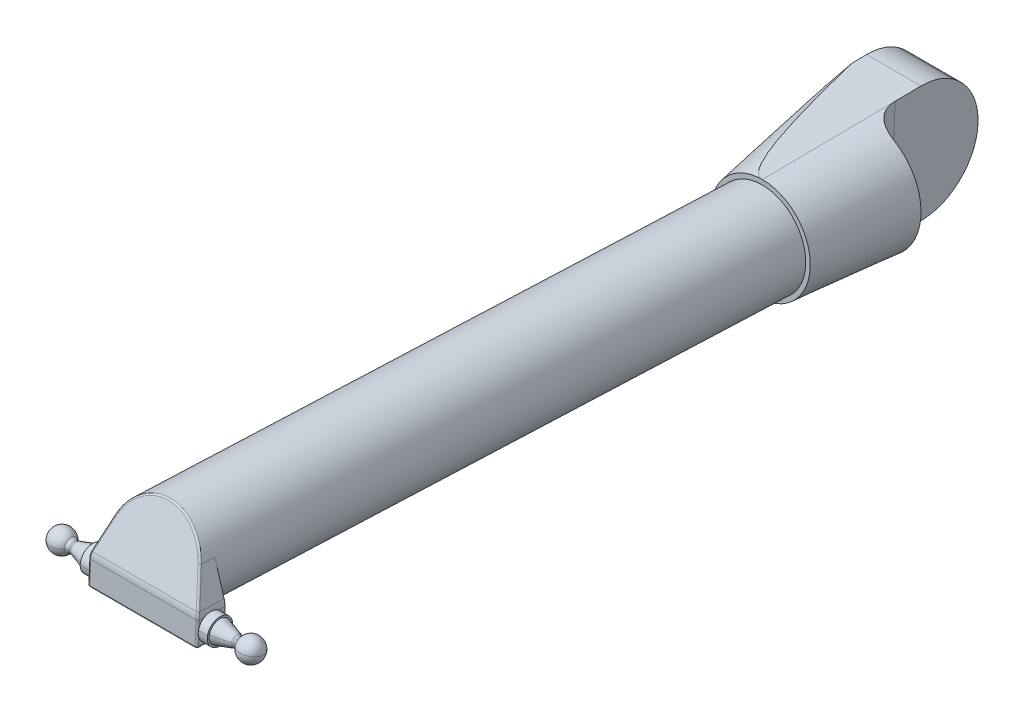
ISO-10303-21;
HEADER;
FILE_DESCRIPTION(('STEP AP214'),'2;1');
FILE_NAME('part.step','',(''),(''),'','','');
FILE_SCHEMA(('AUTOMOTIVE_DESIGN { 1 0 10303 214 1 1 1 1 }'));
ENDSEC;
DATA;
#1=APPLICATION_CONTEXT('core data for automotive mechanical design processes');
#2=APPLICATION_PROTOCOL_DEFINITION('international standard','automotive_design',2000,#1);
#3=PRODUCT_CONTEXT('',#1,'mechanical');
#4=PRODUCT('Part','Part','',(#3));
#5=PRODUCT_RELATED_PRODUCT_CATEGORY('part','',(#4));
#6=PRODUCT_DEFINITION_FORMATION('','',#4);
#7=PRODUCT_DEFINITION_CONTEXT('part definition',#1,'design');
#8=PRODUCT_DEFINITION('design','',#6,#7);
#9=PRODUCT_DEFINITION_SHAPE('','',#8);
#10=(LENGTH_UNIT() NAMED_UNIT(*) SI_UNIT(.MILLI.,.METRE.));
#11=(NAMED_UNIT(*) PLANE_ANGLE_UNIT() SI_UNIT($,.RADIAN.));
#12=(NAMED_UNIT(*) SI_UNIT($,.STERADIAN.) SOLID_ANGLE_UNIT());
#13=UNCERTAINTY_MEASURE_WITH_UNIT(LENGTH_MEASURE(1.E-05),#10,'distance_accuracy_value','');
#14=(GEOMETRIC_REPRESENTATION_CONTEXT(3) GLOBAL_UNCERTAINTY_ASSIGNED_CONTEXT((#13)) GLOBAL_UNIT_ASSIGNED_CONTEXT((#10,
#11,#12)) REPRESENTATION_CONTEXT('',''));
#15=CARTESIAN_POINT('',(0.,0.,0.));
#16=DIRECTION('',(0.,0.,1.));
#17=DIRECTION('',(1.,0.,0.));
#18=AXIS2_PLACEMENT_3D('',#15,#16,#17);
#19=CARTESIAN_POINT('',(30.,-89.9999999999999,620.));
#20=DIRECTION('',(-1.,0.,0.));
#21=DIRECTION('',(0.,0.186591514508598,0.982437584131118));
#22=AXIS2_PLACEMENT_3D('',#19,#20,#21);
#23=CYLINDRICAL_SURFACE('',#22,7.);
#24=CARTESIAN_POINT('',(35.,-89.9999999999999,620.));
#25=DIRECTION('',(-1.,0.,0.));
#26=DIRECTION('',(0.,0.186591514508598,0.982437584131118));
#27=AXIS2_PLACEMENT_3D('',#24,#25,#26);
#28=CIRCLE('',#27,7.);
#29=CARTESIAN_POINT('',(35.,-88.6938593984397,626.877063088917));
#30=VERTEX_POINT('',#29);
#31=CARTESIAN_POINT('',(35.,-91.3061406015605,613.122936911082));
#32=VERTEX_POINT('',#31);
#33=EDGE_CURVE('E26',#30,#32,#28,.T.);
#34=ORIENTED_EDGE('',*,*,#33,.T.);
#35=DIRECTION('',(-1.,0.,0.));
#36=VECTOR('',#35,1.);
#37=CARTESIAN_POINT('',(30.,-91.3061406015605,613.122936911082));
#38=LINE('',#37,#36);
#39=CARTESIAN_POINT('',(30.,-91.3061406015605,613.122936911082));
#40=VERTEX_POINT('',#39);
#41=EDGE_CURVE('E39',#32,#40,#38,.T.);
#42=ORIENTED_EDGE('',*,*,#41,.T.);
#43=CARTESIAN_POINT('',(30.,-89.9999999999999,620.));
#44=DIRECTION('',(-1.,0.,0.));
#45=DIRECTION('',(0.,0.186591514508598,0.982437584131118));
#46=AXIS2_PLACEMENT_3D('',#43,#44,#45);
#47=CIRCLE('',#46,7.);
#48=CARTESIAN_POINT('',(30.,-84.3712131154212,615.838659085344));
#49=VERTEX_POINT('',#48);
#50=EDGE_CURVE('E452',#49,#40,#47,.T.);
#51=ORIENTED_EDGE('',*,*,#50,.F.);
#52=CARTESIAN_POINT('',(30.,-89.9999999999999,620.));
#53=DIRECTION('',(-1.,0.,0.));
#54=DIRECTION('',(0.,0.186591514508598,0.982437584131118));
#55=AXIS2_PLACEMENT_3D('',#52,#53,#54);
#56=CIRCLE('',#55,7.);
#57=CARTESIAN_POINT('',(30.,-84.0442802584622,623.678233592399));
#58=VERTEX_POINT('',#57);
#59=EDGE_CURVE('E637',#58,#49,#56,.T.);
#60=ORIENTED_EDGE('',*,*,#59,.F.);
#61=CARTESIAN_POINT('',(30.,-89.9999999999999,620.));
#62=DIRECTION('',(-1.,0.,0.));
#63=DIRECTION('',(0.,0.186591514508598,0.982437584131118));
#64=AXIS2_PLACEMENT_3D('',#61,#62,#63);
#65=CIRCLE('',#64,7.);
#66=CARTESIAN_POINT('',(30.,-87.1333467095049,626.386102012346));
#67=VERTEX_POINT('',#66);
#68=EDGE_CURVE('E609',#67,#58,#65,.T.);
#69=ORIENTED_EDGE('',*,*,#68,.F.);
#70=CARTESIAN_POINT('',(30.,-89.9999999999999,620.));
#71=DIRECTION('',(-1.,0.,0.));
#72=DIRECTION('',(0.,0.186591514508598,0.982437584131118));
#73=AXIS2_PLACEMENT_3D('',#70,#71,#72);
#74=CIRCLE('',#73,7.);
#75=CARTESIAN_POINT('',(30.,-88.6938593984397,626.877063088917));
#76=VERTEX_POINT('',#75);
#77=EDGE_CURVE('E408',#76,#67,#74,.T.);
#78=ORIENTED_EDGE('',*,*,#77,.F.);
#79=DIRECTION('',(-1.,0.,0.));
#80=VECTOR('',#79,1.);
#81=CARTESIAN_POINT('',(30.,-88.6938593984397,626.877063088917));
#82=LINE('',#81,#80);
#83=EDGE_CURVE('E486',#30,#76,#82,.T.);
#84=ORIENTED_EDGE('',*,*,#83,.F.);
#85=EDGE_LOOP('',(#34,#42,#51,#60,#69,#78,#84));
#86=FACE_BOUND('',#85,.T.);
#87=ADVANCED_FACE('F16',(#86),#23,.T.);
#88=CARTESIAN_POINT('',(44.223550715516,-89.9999999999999,620.));
#89=DIRECTION('',(-1.,0.,0.));
#90=DIRECTION('',(0.,0.186591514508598,0.982437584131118));
#91=AXIS2_PLACEMENT_3D('',#88,#89,#90);
#92=CONICAL_SURFACE('',#91,3.09252464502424,0.305363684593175);
#93=CARTESIAN_POINT('',(44.223550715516,-89.9999999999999,620.));
#94=DIRECTION('',(-1.,0.,0.));
#95=DIRECTION('',(0.,0.186591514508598,0.982437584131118));
#96=AXIS2_PLACEMENT_3D('',#93,#94,#95);
#97=CIRCLE('',#96,3.09252464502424);
#98=CARTESIAN_POINT('',(44.223550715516,-89.4229611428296,623.038212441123));
#99=VERTEX_POINT('',#98);
#100=CARTESIAN_POINT('',(44.223550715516,-90.5770388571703,616.961787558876));
#101=VERTEX_POINT('',#100);
#102=EDGE_CURVE('E524',#99,#101,#97,.T.);
#103=ORIENTED_EDGE('',*,*,#102,.T.);
#104=DIRECTION('',(-0.953737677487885,-0.0560968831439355,-0.295360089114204));
#105=VECTOR('',#104,1.);
#106=CARTESIAN_POINT('',(44.223550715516,-90.5770388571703,616.961787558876));
#107=LINE('',#106,#105);
#108=CARTESIAN_POINT('',(35.,-91.1195490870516,614.105374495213));
#109=VERTEX_POINT('',#108);
#110=EDGE_CURVE('E529',#101,#109,#107,.T.);
#111=ORIENTED_EDGE('',*,*,#110,.T.);
#112=CARTESIAN_POINT('',(35.,-89.9999999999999,620.));
#113=DIRECTION('',(-1.,0.,0.));
#114=DIRECTION('',(0.,0.186591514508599,0.982437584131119));
#115=AXIS2_PLACEMENT_3D('',#112,#113,#114);
#116=CIRCLE('',#115,6.);
#117=CARTESIAN_POINT('',(35.,-88.8804509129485,625.894625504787));
#118=VERTEX_POINT('',#117);
#119=EDGE_CURVE('E456',#118,#109,#116,.T.);
#120=ORIENTED_EDGE('',*,*,#119,.F.);
#121=DIRECTION('',(-0.953737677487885,0.0560968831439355,0.295360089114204));
#122=VECTOR('',#121,1.);
#123=CARTESIAN_POINT('',(44.223550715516,-89.4229611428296,623.038212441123));
#124=LINE('',#123,#122);
#125=EDGE_CURVE('E459',#99,#118,#124,.T.);
#126=ORIENTED_EDGE('',*,*,#125,.F.);
#127=EDGE_LOOP('',(#103,#111,#120,#126));
#128=FACE_BOUND('',#127,.T.);
#129=ADVANCED_FACE('F757',(#128),#92,.T.);
#130=CARTESIAN_POINT('',(44.8248308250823,-89.9999999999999,620.));
#131=DIRECTION('',(-1.,0.,0.));
#132=DIRECTION('',(0.,0.186591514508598,0.982437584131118));
#133=AXIS2_PLACEMENT_3D('',#130,#131,#132);
#134=TOROIDAL_SURFACE('',#133,5.,2.);
#135=CARTESIAN_POINT('',(44.223550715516,-89.9999999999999,620.));
#136=DIRECTION('',(-1.,0.,0.));
#137=DIRECTION('',(0.,0.186591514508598,0.982437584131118));
#138=AXIS2_PLACEMENT_3D('',#135,#136,#137);
#139=CIRCLE('',#138,3.09252464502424);
#140=EDGE_CURVE('E466',#101,#99,#139,.T.);
#141=ORIENTED_EDGE('',*,*,#140,.F.);
#142=CARTESIAN_POINT('',(44.8248308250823,-90.932957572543,615.087812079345));
#143=DIRECTION('',(0.,0.982437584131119,-0.186591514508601));
#144=DIRECTION('',(0.,-0.186591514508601,-0.982437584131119));
#145=AXIS2_PLACEMENT_3D('',#142,#143,#144);
#146=CIRCLE('',#145,2.);
#147=CARTESIAN_POINT('',(44.8248308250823,-90.559774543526,617.052687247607));
#148=VERTEX_POINT('',#147);
#149=EDGE_CURVE('E533',#101,#148,#146,.T.);
#150=ORIENTED_EDGE('',*,*,#149,.T.);
#151=CARTESIAN_POINT('',(44.8248308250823,-89.9999999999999,620.));
#152=DIRECTION('',(-1.,0.,0.));
#153=DIRECTION('',(0.,0.186591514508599,0.982437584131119));
#154=AXIS2_PLACEMENT_3D('',#151,#152,#153);
#155=CIRCLE('',#154,3.);
#156=CARTESIAN_POINT('',(44.8248308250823,-89.4402254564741,622.947312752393));
#157=VERTEX_POINT('',#156);
#158=EDGE_CURVE('E627',#148,#157,#155,.T.);
#159=ORIENTED_EDGE('',*,*,#158,.T.);
#160=CARTESIAN_POINT('',(44.8248308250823,-89.0670424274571,624.912187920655));
#161=DIRECTION('',(0.,-0.982437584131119,0.186591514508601));
#162=DIRECTION('',(0.,0.186591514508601,0.982437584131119));
#163=AXIS2_PLACEMENT_3D('',#160,#161,#162);
#164=CIRCLE('',#163,2.);
#165=EDGE_CURVE('E465',#99,#157,#164,.T.);
#166=ORIENTED_EDGE('',*,*,#165,.F.);
#167=EDGE_LOOP('',(#141,#150,#159,#166));
#168=FACE_BOUND('',#167,.T.);
#169=ADVANCED_FACE('F753',(#168),#134,.F.);
#170=CARTESIAN_POINT('',(30.,-89.9999999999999,620.));
#171=DIRECTION('',(-1.,0.,0.));
#172=DIRECTION('',(0.,0.186591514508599,0.982437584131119));
#173=AXIS2_PLACEMENT_3D('',#170,#171,#172);
#174=CYLINDRICAL_SURFACE('',#173,3.);
#175=CARTESIAN_POINT('',(45.4377976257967,-89.9999999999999,620.));
#176=DIRECTION('',(-1.,0.,0.));
#177=DIRECTION('',(0.,0.186591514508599,0.982437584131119));
#178=AXIS2_PLACEMENT_3D('',#175,#176,#177);
#179=CIRCLE('',#178,3.);
#180=CARTESIAN_POINT('',(45.4377976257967,-89.4402254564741,622.947312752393));
#181=VERTEX_POINT('',#180);
#182=CARTESIAN_POINT('',(45.4377976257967,-90.559774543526,617.052687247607));
#183=VERTEX_POINT('',#182);
#184=EDGE_CURVE('E495',#181,#183,#179,.T.);
#185=ORIENTED_EDGE('',*,*,#184,.T.);
#186=DIRECTION('',(-1.,0.,0.));
#187=VECTOR('',#186,1.);
#188=CARTESIAN_POINT('',(30.,-90.559774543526,617.052687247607));
#189=LINE('',#188,#187);
#190=EDGE_CURVE('E492',#183,#148,#189,.T.);
#191=ORIENTED_EDGE('',*,*,#190,.T.);
#192=CARTESIAN_POINT('',(44.8248308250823,-89.9999999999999,620.));
#193=DIRECTION('',(-1.,0.,0.));
#194=DIRECTION('',(0.,0.186591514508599,0.982437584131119));
#195=AXIS2_PLACEMENT_3D('',#192,#193,#194);
#196=CIRCLE('',#195,3.);
#197=EDGE_CURVE('E461',#157,#148,#196,.T.);
#198=ORIENTED_EDGE('',*,*,#197,.F.);
#199=DIRECTION('',(-1.,0.,0.));
#200=VECTOR('',#199,1.);
#201=CARTESIAN_POINT('',(30.,-89.4402254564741,622.947312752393));
#202=LINE('',#201,#200);
#203=EDGE_CURVE('E1174',#181,#157,#202,.T.);
#204=ORIENTED_EDGE('',*,*,#203,.F.);
#205=EDGE_LOOP('',(#185,#191,#198,#204));
#206=FACE_BOUND('',#205,.T.);
#207=ADVANCED_FACE('F756',(#206),#174,.T.);
#208=CARTESIAN_POINT('',(45.4377976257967,-89.9999999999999,620.));
#209=DIRECTION('',(-1.,0.,0.));
#210=DIRECTION('',(0.,0.186591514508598,0.982437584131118));
#211=AXIS2_PLACEMENT_3D('',#208,#209,#210);
#212=TOROIDAL_SURFACE('',#211,5.,2.);
#213=CARTESIAN_POINT('',(45.4377976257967,-89.9999999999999,620.));
#214=DIRECTION('',(-1.,0.,0.));
#215=DIRECTION('',(0.,0.186591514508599,0.982437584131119));
#216=AXIS2_PLACEMENT_3D('',#213,#214,#215);
#217=CIRCLE('',#216,3.);
#218=EDGE_CURVE('E1178',#183,#181,#217,.T.);
#219=ORIENTED_EDGE('',*,*,#218,.F.);
#220=CARTESIAN_POINT('',(45.4377976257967,-90.932957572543,615.087812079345));
#221=DIRECTION('',(0.,0.982437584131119,-0.186591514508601));
#222=DIRECTION('',(0.,-0.186591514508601,-0.982437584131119));
#223=AXIS2_PLACEMENT_3D('',#220,#221,#222);
#224=CIRCLE('',#223,2.);
#225=CARTESIAN_POINT('',(47.0286345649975,-90.7067860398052,616.278645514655));
#226=VERTEX_POINT('',#225);
#227=EDGE_CURVE('E421',#183,#226,#224,.T.);
#228=ORIENTED_EDGE('',*,*,#227,.T.);
#229=CARTESIAN_POINT('',(47.0286345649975,-89.9999999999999,620.));
#230=DIRECTION('',(-1.,0.,0.));
#231=DIRECTION('',(0.,0.186591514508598,0.982437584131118));
#232=AXIS2_PLACEMENT_3D('',#229,#230,#231);
#233=CIRCLE('',#232,3.78787878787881);
#234=CARTESIAN_POINT('',(47.0286345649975,-89.2932139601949,623.721354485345));
#235=VERTEX_POINT('',#234);
#236=EDGE_CURVE('E417',#226,#235,#233,.T.);
#237=ORIENTED_EDGE('',*,*,#236,.T.);
#238=CARTESIAN_POINT('',(45.4377976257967,-89.0670424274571,624.912187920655));
#239=DIRECTION('',(0.,-0.982437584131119,0.186591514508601));
#240=DIRECTION('',(0.,0.186591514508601,0.982437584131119));
#241=AXIS2_PLACEMENT_3D('',#238,#239,#240);
#242=CIRCLE('',#241,2.);
#243=EDGE_CURVE('E1170',#181,#235,#242,.T.);
#244=ORIENTED_EDGE('',*,*,#243,.F.);
#245=EDGE_LOOP('',(#219,#228,#237,#244));
#246=FACE_BOUND('',#245,.T.);
#247=ADVANCED_FACE('F880',(#246),#212,.F.);
#248=CARTESIAN_POINT('',(52.,-89.9999999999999,620.));
#249=DIRECTION('',(0.,-0.982437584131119,0.186591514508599));
#250=DIRECTION('',(0.,-0.186591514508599,-0.982437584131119));
#251=AXIS2_PLACEMENT_3D('',#248,#249,#250);
#252=SPHERICAL_SURFACE('',#251,6.25);
#253=CARTESIAN_POINT('',(52.,-89.9999999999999,620.));
#254=DIRECTION('',(0.,0.982437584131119,-0.186591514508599));
#255=DIRECTION('',(0.,-0.186591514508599,-0.982437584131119));
#256=AXIS2_PLACEMENT_3D('',#253,#254,#255);
#257=CIRCLE('',#256,6.25);
#258=CARTESIAN_POINT('',(58.25,-89.9999999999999,620.));
#259=VERTEX_POINT('',#258);
#260=EDGE_CURVE('E1167',#259,#226,#257,.T.);
#261=ORIENTED_EDGE('',*,*,#260,.F.);
#262=CARTESIAN_POINT('',(52.,-89.9999999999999,620.));
#263=DIRECTION('',(0.,-0.982437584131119,0.186591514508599));
#264=DIRECTION('',(0.,0.186591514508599,0.982437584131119));
#265=AXIS2_PLACEMENT_3D('',#262,#263,#264);
#266=CIRCLE('',#265,6.25);
#267=EDGE_CURVE('E422',#259,#235,#266,.T.);
#268=ORIENTED_EDGE('',*,*,#267,.T.);
#269=ORIENTED_EDGE('',*,*,#236,.F.);
#270=EDGE_LOOP('',(#261,#268,#269));
#271=FACE_BOUND('',#270,.T.);
#272=ADVANCED_FACE('F702',(#271),#252,.T.);
#273=CARTESIAN_POINT('',(-30.,-89.9999999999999,620.));
#274=DIRECTION('',(1.,0.,0.));
#275=DIRECTION('',(0.,0.00292993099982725,0.999995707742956));
#276=AXIS2_PLACEMENT_3D('',#273,#274,#275);
#277=CYLINDRICAL_SURFACE('',#276,7.);
#278=CARTESIAN_POINT('',(-35.,-89.9999999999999,620.));
#279=DIRECTION('',(1.,0.,0.));
#280=DIRECTION('',(0.,0.00292993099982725,0.999995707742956));
#281=AXIS2_PLACEMENT_3D('',#278,#279,#280);
#282=CIRCLE('',#281,7.);
#283=CARTESIAN_POINT('',(-35.,-89.9794904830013,626.999969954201));
#284=VERTEX_POINT('',#283);
#285=CARTESIAN_POINT('',(-35.,-90.0205095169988,613.000030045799));
#286=VERTEX_POINT('',#285);
#287=EDGE_CURVE('E614',#284,#286,#282,.T.);
#288=ORIENTED_EDGE('',*,*,#287,.T.);
#289=DIRECTION('',(1.,0.,0.));
#290=VECTOR('',#289,1.);
#291=CARTESIAN_POINT('',(-30.,-90.0205095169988,613.000030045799));
#292=LINE('',#291,#290);
#293=CARTESIAN_POINT('',(-30.,-90.0205095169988,613.000030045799));
#294=VERTEX_POINT('',#293);
#295=EDGE_CURVE('E610',#286,#294,#292,.T.);
#296=ORIENTED_EDGE('',*,*,#295,.T.);
#297=CARTESIAN_POINT('',(-30.,-89.9999999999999,620.));
#298=DIRECTION('',(1.,0.,0.));
#299=DIRECTION('',(0.,0.00292993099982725,0.999995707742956));
#300=AXIS2_PLACEMENT_3D('',#297,#298,#299);
#301=CIRCLE('',#300,7.);
#302=CARTESIAN_POINT('',(-30.,-96.6026083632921,617.675013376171));
#303=VERTEX_POINT('',#302);
#304=EDGE_CURVE('E544',#303,#294,#301,.T.);
#305=ORIENTED_EDGE('',*,*,#304,.F.);
#306=CARTESIAN_POINT('',(-30.,-89.9999999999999,620.));
#307=DIRECTION('',(1.,0.,0.));
#308=DIRECTION('',(0.,0.00292993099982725,0.999995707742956));
#309=AXIS2_PLACEMENT_3D('',#306,#307,#308);
#310=CIRCLE('',#309,7.);
#311=CARTESIAN_POINT('',(-30.,-96.3861020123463,622.866653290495));
#312=VERTEX_POINT('',#311);
#313=EDGE_CURVE('E536',#312,#303,#310,.T.);
#314=ORIENTED_EDGE('',*,*,#313,.F.);
#315=CARTESIAN_POINT('',(-30.,-89.9999999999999,620.));
#316=DIRECTION('',(1.,0.,0.));
#317=DIRECTION('',(0.,0.00292993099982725,0.999995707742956));
#318=AXIS2_PLACEMENT_3D('',#315,#316,#317);
#319=CIRCLE('',#318,7.);
#320=CARTESIAN_POINT('',(-30.,-92.3249866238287,626.602608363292));
#321=VERTEX_POINT('',#320);
#322=EDGE_CURVE('E427',#321,#312,#319,.T.);
#323=ORIENTED_EDGE('',*,*,#322,.F.);
#324=CARTESIAN_POINT('',(-30.,-89.9999999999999,620.));
#325=DIRECTION('',(1.,0.,0.));
#326=DIRECTION('',(0.,0.00292993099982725,0.999995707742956));
#327=AXIS2_PLACEMENT_3D('',#324,#325,#326);
#328=CIRCLE('',#327,7.);
#329=CARTESIAN_POINT('',(-30.,-89.9794904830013,626.999969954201));
#330=VERTEX_POINT('',#329);
#331=EDGE_CURVE('E507',#330,#321,#328,.T.);
#332=ORIENTED_EDGE('',*,*,#331,.F.);
#333=DIRECTION('',(1.,0.,0.));
#334=VECTOR('',#333,1.);
#335=CARTESIAN_POINT('',(-30.,-89.9794904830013,626.999969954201));
#336=LINE('',#335,#334);
#337=EDGE_CURVE('E397',#284,#330,#336,.T.);
#338=ORIENTED_EDGE('',*,*,#337,.F.);
#339=EDGE_LOOP('',(#288,#296,#305,#314,#323,#332,#338));
#340=FACE_BOUND('',#339,.T.);
#341=ADVANCED_FACE('F699',(#340),#277,.T.);
#342=CARTESIAN_POINT('',(-44.2235507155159,-89.9999999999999,620.));
#343=DIRECTION('',(1.,0.,0.));
#344=DIRECTION('',(0.,0.00292993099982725,0.999995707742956));
#345=AXIS2_PLACEMENT_3D('',#342,#343,#344);
#346=CONICAL_SURFACE('',#345,3.09252464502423,0.305363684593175);
#347=CARTESIAN_POINT('',(-44.2235507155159,-89.9999999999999,620.));
#348=DIRECTION('',(1.,0.,0.));
#349=DIRECTION('',(0.,0.00292993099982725,0.999995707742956));
#350=AXIS2_PLACEMENT_3D('',#347,#348,#349);
#351=CIRCLE('',#350,3.09252464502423);
#352=CARTESIAN_POINT('',(-44.2235507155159,-89.9909391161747,623.092511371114));
#353=VERTEX_POINT('',#352);
#354=CARTESIAN_POINT('',(-44.2235507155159,-90.0090608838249,616.907488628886));
#355=VERTEX_POINT('',#354);
#356=EDGE_CURVE('E615',#353,#355,#351,.T.);
#357=ORIENTED_EDGE('',*,*,#356,.T.);
#358=DIRECTION('',(0.953737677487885,-0.000880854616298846,-0.300638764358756));
#359=VECTOR('',#358,1.);
#360=CARTESIAN_POINT('',(-44.2235507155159,-90.0090608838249,616.907488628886));
#361=LINE('',#360,#359);
#362=CARTESIAN_POINT('',(-35.,-90.0175795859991,614.000025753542));
#363=VERTEX_POINT('',#362);
#364=EDGE_CURVE('E375',#355,#363,#361,.T.);
#365=ORIENTED_EDGE('',*,*,#364,.T.);
#366=CARTESIAN_POINT('',(-35.,-89.9999999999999,620.));
#367=DIRECTION('',(1.,0.,0.));
#368=DIRECTION('',(0.,0.00292993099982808,0.999995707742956));
#369=AXIS2_PLACEMENT_3D('',#366,#367,#368);
#370=CIRCLE('',#369,6.);
#371=CARTESIAN_POINT('',(-35.,-89.9824204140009,625.999974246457));
#372=VERTEX_POINT('',#371);
#373=EDGE_CURVE('E368',#372,#363,#370,.T.);
#374=ORIENTED_EDGE('',*,*,#373,.F.);
#375=DIRECTION('',(0.953737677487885,0.000880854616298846,0.300638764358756));
#376=VECTOR('',#375,1.);
#377=CARTESIAN_POINT('',(-44.2235507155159,-89.9909391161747,623.092511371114));
#378=LINE('',#377,#376);
#379=EDGE_CURVE('E372',#353,#372,#378,.T.);
#380=ORIENTED_EDGE('',*,*,#379,.F.);
#381=EDGE_LOOP('',(#357,#365,#374,#380));
#382=FACE_BOUND('',#381,.T.);
#383=ADVANCED_FACE('F371',(#382),#346,.T.);
#384=CARTESIAN_POINT('',(-44.8248308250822,-89.9999999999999,620.));
#385=DIRECTION('',(1.,0.,0.));
#386=DIRECTION('',(0.,0.00292993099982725,0.999995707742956));
#387=AXIS2_PLACEMENT_3D('',#384,#385,#386);
#388=TOROIDAL_SURFACE('',#387,5.,2.);
#389=CARTESIAN_POINT('',(-44.2235507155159,-89.9999999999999,620.));
#390=DIRECTION('',(1.,0.,0.));
#391=DIRECTION('',(0.,0.00292993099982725,0.999995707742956));
#392=AXIS2_PLACEMENT_3D('',#389,#390,#391);
#393=CIRCLE('',#392,3.09252464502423);
#394=EDGE_CURVE('E384',#355,#353,#393,.T.);
#395=ORIENTED_EDGE('',*,*,#394,.F.);
#396=CARTESIAN_POINT('',(-44.8248308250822,-90.0146496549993,615.000021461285));
#397=DIRECTION('',(0.,-0.999995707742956,0.00292993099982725));
#398=DIRECTION('',(0.,0.00292993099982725,0.999995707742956));
#399=AXIS2_PLACEMENT_3D('',#396,#397,#398);
#400=CIRCLE('',#399,2.);
#401=CARTESIAN_POINT('',(-44.8248308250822,-90.0087897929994,617.000012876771));
#402=VERTEX_POINT('',#401);
#403=EDGE_CURVE('E621',#355,#402,#400,.T.);
#404=ORIENTED_EDGE('',*,*,#403,.T.);
#405=CARTESIAN_POINT('',(-44.8248308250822,-89.9999999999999,620.));
#406=DIRECTION('',(1.,0.,0.));
#407=DIRECTION('',(0.,0.00292993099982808,0.999995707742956));
#408=AXIS2_PLACEMENT_3D('',#405,#406,#407);
#409=CIRCLE('',#408,3.);
#410=CARTESIAN_POINT('',(-44.8248308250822,-89.9912102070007,622.999987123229));
#411=VERTEX_POINT('',#410);
#412=EDGE_CURVE('E595',#402,#411,#409,.T.);
#413=ORIENTED_EDGE('',*,*,#412,.T.);
#414=CARTESIAN_POINT('',(-44.8248308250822,-89.9853503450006,624.999978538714));
#415=DIRECTION('',(0.,0.999995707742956,-0.00292993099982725));
#416=DIRECTION('',(0.,-0.00292993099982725,-0.999995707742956));
#417=AXIS2_PLACEMENT_3D('',#414,#415,#416);
#418=CIRCLE('',#417,2.);
#419=EDGE_CURVE('E600',#353,#411,#418,.T.);
#420=ORIENTED_EDGE('',*,*,#419,.F.);
#421=EDGE_LOOP('',(#395,#404,#413,#420));
#422=FACE_BOUND('',#421,.T.);
#423=ADVANCED_FACE('F773',(#422),#388,.F.);
#424=CARTESIAN_POINT('',(-30.,-89.9999999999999,620.));
#425=DIRECTION('',(1.,0.,0.));
#426=DIRECTION('',(0.,0.00292993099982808,0.999995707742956));
#427=AXIS2_PLACEMENT_3D('',#424,#425,#426);
#428=CYLINDRICAL_SURFACE('',#427,3.);
#429=CARTESIAN_POINT('',(-45.4377976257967,-89.9999999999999,620.));
#430=DIRECTION('',(1.,0.,0.));
#431=DIRECTION('',(0.,0.00292993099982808,0.999995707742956));
#432=AXIS2_PLACEMENT_3D('',#429,#430,#431);
#433=CIRCLE('',#432,3.);
#434=CARTESIAN_POINT('',(-45.4377976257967,-89.9912102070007,622.999987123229));
#435=VERTEX_POINT('',#434);
#436=CARTESIAN_POINT('',(-45.4377976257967,-90.0087897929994,617.000012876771));
#437=VERTEX_POINT('',#436);
#438=EDGE_CURVE('E591',#435,#437,#433,.T.);
#439=ORIENTED_EDGE('',*,*,#438,.T.);
#440=DIRECTION('',(1.,0.,0.));
#441=VECTOR('',#440,1.);
#442=CARTESIAN_POINT('',(-30.,-90.0087897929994,617.000012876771));
#443=LINE('',#442,#441);
#444=EDGE_CURVE('E596',#437,#402,#443,.T.);
#445=ORIENTED_EDGE('',*,*,#444,.T.);
#446=CARTESIAN_POINT('',(-44.8248308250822,-89.9999999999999,620.));
#447=DIRECTION('',(1.,0.,0.));
#448=DIRECTION('',(0.,0.00292993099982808,0.999995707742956));
#449=AXIS2_PLACEMENT_3D('',#446,#447,#448);
#450=CIRCLE('',#449,3.);
#451=EDGE_CURVE('E604',#411,#402,#450,.T.);
#452=ORIENTED_EDGE('',*,*,#451,.F.);
#453=DIRECTION('',(1.,0.,0.));
#454=VECTOR('',#453,1.);
#455=CARTESIAN_POINT('',(-30.,-89.9912102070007,622.999987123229));
#456=LINE('',#455,#454);
#457=EDGE_CURVE('E555',#435,#411,#456,.T.);
#458=ORIENTED_EDGE('',*,*,#457,.F.);
#459=EDGE_LOOP('',(#439,#445,#452,#458));
#460=FACE_BOUND('',#459,.T.);
#461=ADVANCED_FACE('F769',(#460),#428,.T.);
#462=CARTESIAN_POINT('',(-45.4377976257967,-89.9999999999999,620.));
#463=DIRECTION('',(1.,0.,0.));
#464=DIRECTION('',(0.,0.00292993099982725,0.999995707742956));
#465=AXIS2_PLACEMENT_3D('',#462,#463,#464);
#466=TOROIDAL_SURFACE('',#465,5.,2.);
#467=CARTESIAN_POINT('',(-45.4377976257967,-89.9999999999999,620.));
#468=DIRECTION('',(1.,0.,0.));
#469=DIRECTION('',(0.,0.00292993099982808,0.999995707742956));
#470=AXIS2_PLACEMENT_3D('',#467,#468,#469);
#471=CIRCLE('',#470,3.);
#472=EDGE_CURVE('E550',#437,#435,#471,.T.);
#473=ORIENTED_EDGE('',*,*,#472,.F.);
#474=CARTESIAN_POINT('',(-45.4377976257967,-90.0146496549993,615.000021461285));
#475=DIRECTION('',(0.,-0.999995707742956,0.00292993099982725));
#476=DIRECTION('',(0.,0.00292993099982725,0.999995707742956));
#477=AXIS2_PLACEMENT_3D('',#474,#475,#476);
#478=CIRCLE('',#477,2.);
#479=CARTESIAN_POINT('',(-47.0286345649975,-90.0110982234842,616.21213747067));
#480=VERTEX_POINT('',#479);
#481=EDGE_CURVE('E512',#437,#480,#478,.T.);
#482=ORIENTED_EDGE('',*,*,#481,.T.);
#483=CARTESIAN_POINT('',(-47.0286345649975,-89.9999999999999,620.));
#484=DIRECTION('',(1.,0.,0.));
#485=DIRECTION('',(0.,0.00292993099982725,0.999995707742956));
#486=AXIS2_PLACEMENT_3D('',#483,#484,#485);
#487=CIRCLE('',#486,3.78787878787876);
#488=CARTESIAN_POINT('',(-47.0286345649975,-89.9889017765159,623.787862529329));
#489=VERTEX_POINT('',#488);
#490=EDGE_CURVE('E508',#480,#489,#487,.T.);
#491=ORIENTED_EDGE('',*,*,#490,.T.);
#492=CARTESIAN_POINT('',(-45.4377976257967,-89.9853503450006,624.999978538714));
#493=DIRECTION('',(0.,0.999995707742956,-0.00292993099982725));
#494=DIRECTION('',(0.,-0.00292993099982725,-0.999995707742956));
#495=AXIS2_PLACEMENT_3D('',#492,#493,#494);
#496=CIRCLE('',#495,2.);
#497=EDGE_CURVE('E401',#435,#489,#496,.T.);
#498=ORIENTED_EDGE('',*,*,#497,.F.);
#499=EDGE_LOOP('',(#473,#482,#491,#498));
#500=FACE_BOUND('',#499,.T.);
#501=ADVANCED_FACE('F772',(#500),#466,.F.);
#502=CARTESIAN_POINT('',(-52.,-89.9999999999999,620.));
#503=DIRECTION('',(0.,0.999995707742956,-0.00292993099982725));
#504=DIRECTION('',(0.,-0.00292993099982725,-0.999995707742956));
#505=AXIS2_PLACEMENT_3D('',#502,#503,#504);
#506=SPHERICAL_SURFACE('',#505,6.25);
#507=CARTESIAN_POINT('',(-52.,-89.9999999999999,620.));
#508=DIRECTION('',(0.,-0.999995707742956,0.00292993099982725));
#509=DIRECTION('',(0.,0.00292993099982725,0.999995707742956));
#510=AXIS2_PLACEMENT_3D('',#507,#508,#509);
#511=CIRCLE('',#510,6.25);
#512=CARTESIAN_POINT('',(-58.25,-89.9999999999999,620.));
#513=VERTEX_POINT('',#512);
#514=EDGE_CURVE('E413',#513,#480,#511,.T.);
#515=ORIENTED_EDGE('',*,*,#514,.F.);
#516=CARTESIAN_POINT('',(-52.,-89.9999999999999,620.));
#517=DIRECTION('',(0.,0.999995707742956,-0.00292993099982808));
#518=DIRECTION('',(0.,-0.00292993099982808,-0.999995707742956));
#519=AXIS2_PLACEMENT_3D('',#516,#517,#518);
#520=CIRCLE('',#519,6.25);
#521=EDGE_CURVE('E513',#513,#489,#520,.T.);
#522=ORIENTED_EDGE('',*,*,#521,.T.);
#523=ORIENTED_EDGE('',*,*,#490,.F.);
#524=EDGE_LOOP('',(#515,#522,#523));
#525=FACE_BOUND('',#524,.T.);
#526=ADVANCED_FACE('F858',(#525),#506,.T.);
#527=CARTESIAN_POINT('',(0.,20746.1505888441,499833.339092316));
#528=DIRECTION('',(0.,-0.0416666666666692,-0.999131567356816));
#529=DIRECTION('',(1.,0.,0.));
#530=AXIS2_PLACEMENT_3D('',#527,#528,#529);
#531=CYLINDRICAL_SURFACE('',#530,25.);
#532=CARTESIAN_POINT('',(0.,-86.3541666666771,287.424012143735));
#533=DIRECTION('',(0.,0.0416666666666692,0.999131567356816));
#534=DIRECTION('',(0.,0.999131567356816,-0.0416666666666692));
#535=AXIS2_PLACEMENT_3D('',#532,#533,#534);
#536=CIRCLE('',#535,25.);
#537=CARTESIAN_POINT('',(0.,-61.3758774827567,286.382345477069));
#538=VERTEX_POINT('',#537);
#539=EDGE_CURVE('E10',#538,#538,#536,.F.);
#540=ORIENTED_EDGE('',*,*,#539,.F.);
#541=EDGE_LOOP('',(#540));
#542=FACE_BOUND('',#541,.T.);
#543=CARTESIAN_POINT('',(0.,-72.8276975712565,611.777346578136));
#544=DIRECTION('',(0.,0.0416666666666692,0.999131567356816));
#545=DIRECTION('',(-1.,0.,0.));
#546=AXIS2_PLACEMENT_3D('',#543,#544,#545);
#547=CIRCLE('',#546,25.);
#548=CARTESIAN_POINT('',(-25.,-72.8276975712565,611.777346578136));
#549=VERTEX_POINT('',#548);
#550=CARTESIAN_POINT('',(0.,-97.8059867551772,612.819013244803));
#551=VERTEX_POINT('',#550);
#552=EDGE_CURVE('E540',#549,#551,#547,.T.);
#553=ORIENTED_EDGE('',*,*,#552,.F.);
#554=DIRECTION('',(0.,-0.0416666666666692,-0.999131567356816));
#555=VECTOR('',#554,1.);
#556=CARTESIAN_POINT('',(-25.,20746.1505888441,499833.339092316));
#557=LINE('',#556,#555);
#558=CARTESIAN_POINT('',(-25.,-82.182744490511,387.451201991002));
#559=VERTEX_POINT('',#558);
#560=EDGE_CURVE('E564',#549,#559,#557,.T.);
#561=ORIENTED_EDGE('',*,*,#560,.T.);
#562=ORIENTED_EDGE('',*,*,#560,.F.);
#563=CARTESIAN_POINT('',(0.,-72.8276975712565,611.777346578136));
#564=DIRECTION('',(0.,0.0416666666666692,0.999131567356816));
#565=DIRECTION('',(-1.,0.,0.));
#566=AXIS2_PLACEMENT_3D('',#563,#564,#565);
#567=CIRCLE('',#566,25.);
#568=CARTESIAN_POINT('',(-23.5912291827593,-64.5611951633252,611.432609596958));
#569=VERTEX_POINT('',#568);
#570=EDGE_CURVE('E546',#569,#549,#567,.T.);
#571=ORIENTED_EDGE('',*,*,#570,.F.);
#572=DIRECTION('',(0.,0.0416666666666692,0.999131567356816));
#573=VECTOR('',#572,1.);
#574=CARTESIAN_POINT('',(-23.5912291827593,-64.5611951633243,611.432609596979));
#575=LINE('',#574,#573);
#576=CARTESIAN_POINT('',(-23.5912291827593,-64.2526452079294,618.831377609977));
#577=VERTEX_POINT('',#576);
#578=EDGE_CURVE('E835',#569,#577,#575,.T.);
#579=ORIENTED_EDGE('',*,*,#578,.T.);
#580=CARTESIAN_POINT('',(23.5912291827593,-64.2526452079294,618.831377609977));
#581=CARTESIAN_POINT('',(22.7406989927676,-61.8648943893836,617.883684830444));
#582=CARTESIAN_POINT('',(21.5136099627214,-59.6080239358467,616.987938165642));
#583=CARTESIAN_POINT('',(18.4209376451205,-55.5664496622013,615.38384668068));
#584=CARTESIAN_POINT('',(16.5558901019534,-53.7825536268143,614.675822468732));
#585=CARTESIAN_POINT('',(12.3632319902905,-50.8557950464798,613.514198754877));
#586=CARTESIAN_POINT('',(10.0362504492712,-49.7133716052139,613.060773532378));
#587=CARTESIAN_POINT('',(5.13915131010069,-48.1775456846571,612.45120777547));
#588=CARTESIAN_POINT('',(2.56976842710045,-47.7843736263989,612.29515869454));
#589=CARTESIAN_POINT('',(-2.56976842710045,-47.7843736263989,612.29515869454));
#590=CARTESIAN_POINT('',(-5.13915131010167,-48.1775456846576,612.451207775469));
#591=CARTESIAN_POINT('',(-10.0362504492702,-49.7133716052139,613.060773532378));
#592=CARTESIAN_POINT('',(-12.363231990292,-50.8557950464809,613.514198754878));
#593=CARTESIAN_POINT('',(-16.5558901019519,-53.7825536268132,614.675822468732));
#594=CARTESIAN_POINT('',(-18.4209376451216,-55.5664496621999,615.383846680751));
#595=CARTESIAN_POINT('',(-21.5136099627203,-59.6080239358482,616.98793816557));
#596=CARTESIAN_POINT('',(-22.7406989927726,-61.8648943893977,617.883684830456));
#597=CARTESIAN_POINT('',(-23.5912291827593,-64.2526452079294,618.831377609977));
#598=(BOUNDED_CURVE() B_SPLINE_CURVE(3,(#580,#581,#582,#583,#584,#585,#586,#587,#588,#589,#590,
#591,#592,#593,#594,#595,#596,#597),.UNSPECIFIED.,.F.,.F.) B_SPLINE_CURVE_WITH_KNOTS((4,2,2,2,2,
2,2,2,4),(1.90810380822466,2.21647601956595,2.52484823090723,2.83322044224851,3.14159265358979,
3.44996486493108,3.75833707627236,4.06670928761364,4.37508149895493),
.UNSPECIFIED.) CURVE() GEOMETRIC_REPRESENTATION_ITEM() RATIONAL_B_SPLINE_CURVE((1.,1.,1.,1.,1.,
1.,1.,1.,1.,1.,1.,1.,1.,1.,1.,1.,1.,1.)) REPRESENTATION_ITEM(''));
#599=CARTESIAN_POINT('',(23.5912291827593,-64.2526452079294,618.831377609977));
#600=VERTEX_POINT('',#599);
#601=EDGE_CURVE('E665',#577,#600,#598,.F.);
#602=ORIENTED_EDGE('',*,*,#601,.T.);
#603=DIRECTION('',(0.,0.0416666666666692,0.999131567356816));
#604=VECTOR('',#603,1.);
#605=CARTESIAN_POINT('',(23.5912291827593,-64.5611951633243,611.432609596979));
#606=LINE('',#605,#604);
#607=CARTESIAN_POINT('',(23.5912291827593,-64.5611951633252,611.432609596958));
#608=VERTEX_POINT('',#607);
#609=EDGE_CURVE('E571',#608,#600,#606,.T.);
#610=ORIENTED_EDGE('',*,*,#609,.F.);
#611=CARTESIAN_POINT('',(0.,-72.8276975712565,611.777346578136));
#612=DIRECTION('',(0.,0.0416666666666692,0.999131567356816));
#613=DIRECTION('',(-1.,0.,0.));
#614=AXIS2_PLACEMENT_3D('',#611,#612,#613);
#615=CIRCLE('',#614,25.);
#616=CARTESIAN_POINT('',(25.,-72.8276975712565,611.777346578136));
#617=VERTEX_POINT('',#616);
#618=EDGE_CURVE('E1101',#617,#608,#615,.T.);
#619=ORIENTED_EDGE('',*,*,#618,.F.);
#620=DIRECTION('',(0.,-0.0416666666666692,-0.999131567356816));
#621=VECTOR('',#620,1.);
#622=CARTESIAN_POINT('',(25.,20746.1505888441,499833.339092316));
#623=LINE('',#622,#621);
#624=CARTESIAN_POINT('',(24.9999999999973,-82.1827444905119,387.451201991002));
#625=VERTEX_POINT('',#624);
#626=EDGE_CURVE('E838',#617,#625,#623,.T.);
#627=ORIENTED_EDGE('',*,*,#626,.T.);
#628=ORIENTED_EDGE('',*,*,#626,.F.);
#629=CARTESIAN_POINT('',(0.,-72.8276975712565,611.777346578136));
#630=DIRECTION('',(0.,0.0416666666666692,0.999131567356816));
#631=DIRECTION('',(-1.,0.,0.));
#632=AXIS2_PLACEMENT_3D('',#629,#630,#631);
#633=CIRCLE('',#632,25.);
#634=EDGE_CURVE('E1090',#551,#617,#633,.T.);
#635=ORIENTED_EDGE('',*,*,#634,.F.);
#636=EDGE_LOOP('',(#553,#561,#562,#571,#579,#602,#610,#619,#627,#628,#635));
#637=FACE_BOUND('',#636,.T.);
#638=ADVANCED_FACE('F848',(#542,#637),#531,.T.);
#639=CARTESIAN_POINT('',(0.,-72.8276975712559,611.777346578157));
#640=DIRECTION('',(0.,0.0416666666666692,0.999131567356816));
#641=DIRECTION('',(-1.,0.,0.));
#642=AXIS2_PLACEMENT_3D('',#639,#640,#641);
#643=PLANE('',#642);
#644=DIRECTION('',(-1.,0.,0.));
#645=VECTOR('',#644,1.);
#646=CARTESIAN_POINT('',(30.,-97.8059867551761,612.819013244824));
#647=LINE('',#646,#645);
#648=CARTESIAN_POINT('',(29.,-97.8059867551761,612.819013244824));
#649=VERTEX_POINT('',#648);
#650=EDGE_CURVE('E842',#649,#551,#647,.T.);
#651=ORIENTED_EDGE('',*,*,#650,.T.);
#652=ORIENTED_EDGE('',*,*,#634,.T.);
#653=ORIENTED_EDGE('',*,*,#618,.T.);
#654=DIRECTION('',(0.330947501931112,-0.942829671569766,0.0393187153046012));
#655=VECTOR('',#654,1.);
#656=CARTESIAN_POINT('',(30.,-82.8190132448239,612.194013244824));
#657=LINE('',#656,#655);
#658=CARTESIAN_POINT('',(29.4364916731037,-81.2136457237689,612.127064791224));
#659=VERTEX_POINT('',#658);
#660=EDGE_CURVE('E1105',#608,#659,#657,.T.);
#661=ORIENTED_EDGE('',*,*,#660,.T.);
#662=CARTESIAN_POINT('',(20.,-84.5202466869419,612.264959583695));
#663=DIRECTION('',(0.,-0.0416666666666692,-0.999131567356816));
#664=DIRECTION('',(1.,0.,0.));
#665=AXIS2_PLACEMENT_3D('',#662,#663,#664);
#666=CIRCLE('',#665,10.);
#667=CARTESIAN_POINT('',(30.,-84.5202466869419,612.264959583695));
#668=VERTEX_POINT('',#667);
#669=EDGE_CURVE('E502',#659,#668,#666,.T.);
#670=ORIENTED_EDGE('',*,*,#669,.T.);
#671=DIRECTION('',(0.,-0.999131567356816,0.0416666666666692));
#672=VECTOR('',#671,1.);
#673=CARTESIAN_POINT('',(30.,-97.8059867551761,612.819013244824));
#674=LINE('',#673,#672);
#675=CARTESIAN_POINT('',(30.,-96.8068551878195,612.777346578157));
#676=VERTEX_POINT('',#675);
#677=EDGE_CURVE('E498',#668,#676,#674,.T.);
#678=ORIENTED_EDGE('',*,*,#677,.T.);
#679=CARTESIAN_POINT('',(29.,-96.8068551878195,612.777346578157));
#680=DIRECTION('',(0.,-0.0416666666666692,-0.999131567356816));
#681=DIRECTION('',(1.,0.,0.));
#682=AXIS2_PLACEMENT_3D('',#679,#680,#681);
#683=CIRCLE('',#682,1.);
#684=EDGE_CURVE('E503',#676,#649,#683,.T.);
#685=ORIENTED_EDGE('',*,*,#684,.T.);
#686=EDGE_LOOP('',(#651,#652,#653,#661,#670,#678,#685));
#687=FACE_BOUND('',#686,.T.);
#688=ADVANCED_FACE('F857',(#687),#643,.F.);
#689=CARTESIAN_POINT('',(-30.,-89.9999999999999,620.));
#690=DIRECTION('',(-1.,0.,0.));
#691=DIRECTION('',(0.,-0.999131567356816,0.0416666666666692));
#692=AXIS2_PLACEMENT_3D('',#689,#690,#691);
#693=PLANE('',#692);
#694=ORIENTED_EDGE('',*,*,#313,.T.);
#695=DIRECTION('',(0.,0.0416666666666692,0.999131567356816));
#696=VECTOR('',#695,1.);
#697=CARTESIAN_POINT('',(-30.,-96.8068551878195,612.777346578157));
#698=LINE('',#697,#696);
#699=EDGE_CURVE('E560',#303,#312,#698,.T.);
#700=ORIENTED_EDGE('',*,*,#699,.T.);
#701=EDGE_LOOP('',(#694,#700));
#702=FACE_BOUND('',#701,.T.);
#703=ADVANCED_FACE('F870',(#702),#693,.F.);
#704=CARTESIAN_POINT('',(-30.,-89.9999999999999,620.));
#705=DIRECTION('',(-1.,0.,0.));
#706=DIRECTION('',(0.,-0.999131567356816,0.0416666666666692));
#707=AXIS2_PLACEMENT_3D('',#704,#705,#706);
#708=PLANE('',#707);
#709=CARTESIAN_POINT('',(-30.,-89.9999999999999,620.));
#710=DIRECTION('',(1.,0.,0.));
#711=DIRECTION('',(0.,0.00292993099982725,0.999995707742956));
#712=AXIS2_PLACEMENT_3D('',#709,#710,#711);
#713=CIRCLE('',#712,7.);
#714=CARTESIAN_POINT('',(-30.,-87.1333467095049,626.386102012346));
#715=VERTEX_POINT('',#714);
#716=EDGE_CURVE('E556',#715,#330,#713,.T.);
#717=ORIENTED_EDGE('',*,*,#716,.T.);
#718=ORIENTED_EDGE('',*,*,#331,.T.);
#719=DIRECTION('',(0.,0.999131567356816,-0.0416666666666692));
#720=VECTOR('',#719,1.);
#721=CARTESIAN_POINT('',(-30.,-83.9974184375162,626.255324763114));
#722=LINE('',#721,#720);
#723=EDGE_CURVE('E416',#321,#715,#722,.T.);
#724=ORIENTED_EDGE('',*,*,#723,.T.);
#725=EDGE_LOOP('',(#717,#718,#724));
#726=FACE_BOUND('',#725,.T.);
#727=ADVANCED_FACE('F873',(#726),#708,.F.);
#728=CARTESIAN_POINT('',(-52.,-89.9999999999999,620.));
#729=DIRECTION('',(0.,0.999995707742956,-0.00292993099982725));
#730=DIRECTION('',(0.,-0.00292993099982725,-0.999995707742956));
#731=AXIS2_PLACEMENT_3D('',#728,#729,#730);
#732=SPHERICAL_SURFACE('',#731,6.25);
#733=ORIENTED_EDGE('',*,*,#521,.F.);
#734=ORIENTED_EDGE('',*,*,#514,.T.);
#735=CARTESIAN_POINT('',(-47.0286345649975,-89.9999999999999,620.));
#736=DIRECTION('',(1.,0.,0.));
#737=DIRECTION('',(0.,0.00292993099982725,0.999995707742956));
#738=AXIS2_PLACEMENT_3D('',#735,#736,#737);
#739=CIRCLE('',#738,3.78787878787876);
#740=EDGE_CURVE('E554',#489,#480,#739,.T.);
#741=ORIENTED_EDGE('',*,*,#740,.F.);
#742=EDGE_LOOP('',(#733,#734,#741));
#743=FACE_BOUND('',#742,.T.);
#744=ADVANCED_FACE('F904',(#743),#732,.T.);
#745=CARTESIAN_POINT('',(-45.4377976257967,-89.9999999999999,620.));
#746=DIRECTION('',(1.,0.,0.));
#747=DIRECTION('',(0.,0.00292993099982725,0.999995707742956));
#748=AXIS2_PLACEMENT_3D('',#745,#746,#747);
#749=TOROIDAL_SURFACE('',#748,5.,2.);
#750=ORIENTED_EDGE('',*,*,#481,.F.);
#751=ORIENTED_EDGE('',*,*,#438,.F.);
#752=ORIENTED_EDGE('',*,*,#497,.T.);
#753=ORIENTED_EDGE('',*,*,#740,.T.);
#754=EDGE_LOOP('',(#750,#751,#752,#753));
#755=FACE_BOUND('',#754,.T.);
#756=ADVANCED_FACE('F885',(#755),#749,.F.);
#757=CARTESIAN_POINT('',(-30.,-89.9999999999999,620.));
#758=DIRECTION('',(1.,0.,0.));
#759=DIRECTION('',(0.,0.00292993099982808,0.999995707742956));
#760=AXIS2_PLACEMENT_3D('',#757,#758,#759);
#761=CYLINDRICAL_SURFACE('',#760,3.);
#762=ORIENTED_EDGE('',*,*,#444,.F.);
#763=ORIENTED_EDGE('',*,*,#472,.T.);
#764=ORIENTED_EDGE('',*,*,#457,.T.);
#765=ORIENTED_EDGE('',*,*,#412,.F.);
#766=EDGE_LOOP('',(#762,#763,#764,#765));
#767=FACE_BOUND('',#766,.T.);
#768=ADVANCED_FACE('F882',(#767),#761,.T.);
#769=CARTESIAN_POINT('',(-44.8248308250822,-89.9999999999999,620.));
#770=DIRECTION('',(1.,0.,0.));
#771=DIRECTION('',(0.,0.00292993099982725,0.999995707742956));
#772=AXIS2_PLACEMENT_3D('',#769,#770,#771);
#773=TOROIDAL_SURFACE('',#772,5.,2.);
#774=ORIENTED_EDGE('',*,*,#403,.F.);
#775=ORIENTED_EDGE('',*,*,#356,.F.);
#776=ORIENTED_EDGE('',*,*,#419,.T.);
#777=ORIENTED_EDGE('',*,*,#451,.T.);
#778=EDGE_LOOP('',(#774,#775,#776,#777));
#779=FACE_BOUND('',#778,.T.);
#780=ADVANCED_FACE('F698',(#779),#773,.F.);
#781=CARTESIAN_POINT('',(-44.2235507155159,-89.9999999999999,620.));
#782=DIRECTION('',(1.,0.,0.));
#783=DIRECTION('',(0.,0.00292993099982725,0.999995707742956));
#784=AXIS2_PLACEMENT_3D('',#781,#782,#783);
#785=CONICAL_SURFACE('',#784,3.09252464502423,0.305363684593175);
#786=ORIENTED_EDGE('',*,*,#364,.F.);
#787=ORIENTED_EDGE('',*,*,#394,.T.);
#788=ORIENTED_EDGE('',*,*,#379,.T.);
#789=CARTESIAN_POINT('',(-35.,-89.9999999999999,620.));
#790=DIRECTION('',(1.,0.,0.));
#791=DIRECTION('',(0.,0.00292993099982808,0.999995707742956));
#792=AXIS2_PLACEMENT_3D('',#789,#790,#791);
#793=CIRCLE('',#792,6.);
#794=EDGE_CURVE('E380',#363,#372,#793,.T.);
#795=ORIENTED_EDGE('',*,*,#794,.F.);
#796=EDGE_LOOP('',(#786,#787,#788,#795));
#797=FACE_BOUND('',#796,.T.);
#798=ADVANCED_FACE('F383',(#797),#785,.T.);
#799=CARTESIAN_POINT('',(-35.,-90.0205095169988,613.000030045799));
#800=DIRECTION('',(1.,0.,0.));
#801=DIRECTION('',(0.,-0.999131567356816,0.0416666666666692));
#802=AXIS2_PLACEMENT_3D('',#799,#800,#801);
#803=PLANE('',#802);
#804=ORIENTED_EDGE('',*,*,#287,.F.);
#805=CARTESIAN_POINT('',(-35.,-89.9999999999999,620.));
#806=DIRECTION('',(1.,0.,0.));
#807=DIRECTION('',(0.,0.00292993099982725,0.999995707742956));
#808=AXIS2_PLACEMENT_3D('',#805,#806,#807);
#809=CIRCLE('',#808,7.);
#810=EDGE_CURVE('E390',#286,#284,#809,.T.);
#811=ORIENTED_EDGE('',*,*,#810,.F.);
#812=EDGE_LOOP('',(#804,#811));
#813=FACE_BOUND('',#812,.T.);
#814=ORIENTED_EDGE('',*,*,#373,.T.);
#815=ORIENTED_EDGE('',*,*,#794,.T.);
#816=EDGE_LOOP('',(#814,#815));
#817=FACE_BOUND('',#816,.T.);
#818=ADVANCED_FACE('F388',(#813,#817),#803,.F.);
#819=CARTESIAN_POINT('',(-30.,-89.9999999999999,620.));
#820=DIRECTION('',(1.,0.,0.));
#821=DIRECTION('',(0.,0.00292993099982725,0.999995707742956));
#822=AXIS2_PLACEMENT_3D('',#819,#820,#821);
#823=CYLINDRICAL_SURFACE('',#822,7.);
#824=ORIENTED_EDGE('',*,*,#295,.F.);
#825=ORIENTED_EDGE('',*,*,#810,.T.);
#826=ORIENTED_EDGE('',*,*,#337,.T.);
#827=ORIENTED_EDGE('',*,*,#716,.F.);
#828=CARTESIAN_POINT('',(-30.,-89.9999999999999,620.));
#829=DIRECTION('',(1.,0.,0.));
#830=DIRECTION('',(0.,0.00292993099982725,0.999995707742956));
#831=AXIS2_PLACEMENT_3D('',#828,#829,#830);
#832=CIRCLE('',#831,7.);
#833=CARTESIAN_POINT('',(-30.,-84.0442802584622,623.678233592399));
#834=VERTEX_POINT('',#833);
#835=EDGE_CURVE('E638',#834,#715,#832,.T.);
#836=ORIENTED_EDGE('',*,*,#835,.F.);
#837=CARTESIAN_POINT('',(-30.,-89.9999999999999,620.));
#838=DIRECTION('',(1.,0.,0.));
#839=DIRECTION('',(0.,0.00292993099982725,0.999995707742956));
#840=AXIS2_PLACEMENT_3D('',#837,#838,#839);
#841=CIRCLE('',#840,7.);
#842=CARTESIAN_POINT('',(-30.,-84.3712131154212,615.838659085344));
#843=VERTEX_POINT('',#842);
#844=EDGE_CURVE('E439',#843,#834,#841,.T.);
#845=ORIENTED_EDGE('',*,*,#844,.F.);
#846=CARTESIAN_POINT('',(-30.,-89.9999999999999,620.));
#847=DIRECTION('',(1.,0.,0.));
#848=DIRECTION('',(0.,0.00292993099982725,0.999995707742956));
#849=AXIS2_PLACEMENT_3D('',#846,#847,#848);
#850=CIRCLE('',#849,7.);
#851=EDGE_CURVE('E541',#294,#843,#850,.T.);
#852=ORIENTED_EDGE('',*,*,#851,.F.);
#853=EDGE_LOOP('',(#824,#825,#826,#827,#836,#845,#852));
#854=FACE_BOUND('',#853,.T.);
#855=ADVANCED_FACE('F724',(#854),#823,.T.);
#856=CARTESIAN_POINT('',(-30.,-89.9999999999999,620.));
#857=DIRECTION('',(-1.,0.,0.));
#858=DIRECTION('',(0.,-0.999131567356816,0.0416666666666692));
#859=AXIS2_PLACEMENT_3D('',#856,#857,#858);
#860=PLANE('',#859);
#861=ORIENTED_EDGE('',*,*,#844,.T.);
#862=DIRECTION('',(0.,-0.0416666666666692,-0.999131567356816));
#863=VECTOR('',#862,1.);
#864=CARTESIAN_POINT('',(-30.,-84.5202466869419,612.264959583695));
#865=LINE('',#864,#863);
#866=EDGE_CURVE('E435',#834,#843,#865,.T.);
#867=ORIENTED_EDGE('',*,*,#866,.T.);
#868=EDGE_LOOP('',(#861,#867));
#869=FACE_BOUND('',#868,.T.);
#870=ADVANCED_FACE('F720',(#869),#860,.F.);
#871=CARTESIAN_POINT('',(-30.,-97.8059867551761,612.819013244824));
#872=DIRECTION('',(1.,0.,0.));
#873=DIRECTION('',(0.,0.0416666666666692,0.999131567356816));
#874=AXIS2_PLACEMENT_3D('',#871,#872,#873);
#875=PLANE('',#874);
#876=DIRECTION('',(0.,0.999131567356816,-0.0416666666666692));
#877=VECTOR('',#876,1.);
#878=CARTESIAN_POINT('',(-30.,-83.9974184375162,626.255324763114));
#879=LINE('',#878,#877);
#880=CARTESIAN_POINT('',(-30.,-96.223521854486,626.765188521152));
#881=VERTEX_POINT('',#880);
#882=EDGE_CURVE('E440',#881,#321,#879,.T.);
#883=ORIENTED_EDGE('',*,*,#882,.T.);
#884=ORIENTED_EDGE('',*,*,#322,.T.);
#885=DIRECTION('',(0.,0.0416666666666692,0.999131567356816));
#886=VECTOR('',#885,1.);
#887=CARTESIAN_POINT('',(-30.,-96.8068551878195,612.777346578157));
#888=LINE('',#887,#886);
#889=EDGE_CURVE('E423',#312,#881,#888,.T.);
#890=ORIENTED_EDGE('',*,*,#889,.T.);
#891=EDGE_LOOP('',(#883,#884,#890));
#892=FACE_BOUND('',#891,.T.);
#893=ADVANCED_FACE('F716',(#892),#875,.F.);
#894=CARTESIAN_POINT('',(-30.,-97.8059867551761,612.819013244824));
#895=DIRECTION('',(1.,0.,0.));
#896=DIRECTION('',(0.,0.0416666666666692,0.999131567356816));
#897=AXIS2_PLACEMENT_3D('',#894,#895,#896);
#898=PLANE('',#897);
#899=DIRECTION('',(0.,0.0416666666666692,0.999131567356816));
#900=VECTOR('',#899,1.);
#901=CARTESIAN_POINT('',(-30.,-96.8068551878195,612.777346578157));
#902=LINE('',#901,#900);
#903=CARTESIAN_POINT('',(-30.,-96.8068551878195,612.777346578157));
#904=VERTEX_POINT('',#903);
#905=EDGE_CURVE('E428',#904,#303,#902,.T.);
#906=ORIENTED_EDGE('',*,*,#905,.T.);
#907=ORIENTED_EDGE('',*,*,#304,.T.);
#908=ORIENTED_EDGE('',*,*,#851,.T.);
#909=DIRECTION('',(0.,-0.0416666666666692,-0.999131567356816));
#910=VECTOR('',#909,1.);
#911=CARTESIAN_POINT('',(-30.,-84.5202466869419,612.264959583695));
#912=LINE('',#911,#910);
#913=CARTESIAN_POINT('',(-30.,-84.5202466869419,612.264959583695));
#914=VERTEX_POINT('',#913);
#915=EDGE_CURVE('E545',#843,#914,#912,.T.);
#916=ORIENTED_EDGE('',*,*,#915,.T.);
#917=DIRECTION('',(0.,0.999131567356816,-0.0416666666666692));
#918=VECTOR('',#917,1.);
#919=CARTESIAN_POINT('',(-30.,-97.8059867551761,612.819013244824));
#920=LINE('',#919,#918);
#921=EDGE_CURVE('E472',#904,#914,#920,.T.);
#922=ORIENTED_EDGE('',*,*,#921,.F.);
#923=EDGE_LOOP('',(#906,#907,#908,#916,#922));
#924=FACE_BOUND('',#923,.T.);
#925=ADVANCED_FACE('F719',(#924),#898,.F.);
#926=CARTESIAN_POINT('',(30.,-97.8059867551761,612.819013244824));
#927=DIRECTION('',(-1.,0.,0.));
#928=DIRECTION('',(0.,0.999131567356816,-0.0416666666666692));
#929=AXIS2_PLACEMENT_3D('',#926,#927,#928);
#930=PLANE('',#929);
#931=DIRECTION('',(0.,-0.999131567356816,0.0416666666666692));
#932=VECTOR('',#931,1.);
#933=CARTESIAN_POINT('',(30.,-97.2226534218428,626.806855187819));
#934=LINE('',#933,#932);
#935=CARTESIAN_POINT('',(30.,-83.9974184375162,626.255324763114));
#936=VERTEX_POINT('',#935);
#937=EDGE_CURVE('E605',#936,#67,#934,.T.);
#938=ORIENTED_EDGE('',*,*,#937,.T.);
#939=ORIENTED_EDGE('',*,*,#68,.T.);
#940=DIRECTION('',(0.,0.0416666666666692,0.999131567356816));
#941=VECTOR('',#940,1.);
#942=CARTESIAN_POINT('',(30.,-84.5202466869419,612.264959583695));
#943=LINE('',#942,#941);
#944=CARTESIAN_POINT('',(30.,-83.9369218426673,626.252597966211));
#945=VERTEX_POINT('',#944);
#946=EDGE_CURVE('E658',#58,#945,#943,.T.);
#947=ORIENTED_EDGE('',*,*,#946,.T.);
#948=CARTESIAN_POINT('',(30.,-84.372418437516,617.263140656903));
#949=DIRECTION('',(1.,0.,0.));
#950=DIRECTION('',(0.,0.0416666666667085,0.999131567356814));
#951=AXIS2_PLACEMENT_3D('',#948,#949,#950);
#952=CIRCLE('',#951,9.);
#953=EDGE_CURVE('E476',#945,#936,#952,.T.);
#954=ORIENTED_EDGE('',*,*,#953,.T.);
#955=EDGE_LOOP('',(#938,#939,#947,#954));
#956=FACE_BOUND('',#955,.T.);
#957=ADVANCED_FACE('F765',(#956),#930,.F.);
#958=CARTESIAN_POINT('',(30.,-97.8059867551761,612.819013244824));
#959=DIRECTION('',(-1.,0.,0.));
#960=DIRECTION('',(0.,0.999131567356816,-0.0416666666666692));
#961=AXIS2_PLACEMENT_3D('',#958,#959,#960);
#962=PLANE('',#961);
#963=DIRECTION('',(0.,0.0416666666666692,0.999131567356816));
#964=VECTOR('',#963,1.);
#965=CARTESIAN_POINT('',(30.,-84.5202466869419,612.264959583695));
#966=LINE('',#965,#964);
#967=EDGE_CURVE('E455',#668,#49,#966,.T.);
#968=ORIENTED_EDGE('',*,*,#967,.T.);
#969=ORIENTED_EDGE('',*,*,#50,.T.);
#970=CARTESIAN_POINT('',(30.,-89.9999999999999,620.));
#971=DIRECTION('',(-1.,0.,0.));
#972=DIRECTION('',(0.,0.186591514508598,0.982437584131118));
#973=AXIS2_PLACEMENT_3D('',#970,#971,#972);
#974=CIRCLE('',#973,7.);
#975=CARTESIAN_POINT('',(30.,-96.6026083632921,617.675013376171));
#976=VERTEX_POINT('',#975);
#977=EDGE_CURVE('E450',#40,#976,#974,.T.);
#978=ORIENTED_EDGE('',*,*,#977,.T.);
#979=DIRECTION('',(0.,-0.0416666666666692,-0.999131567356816));
#980=VECTOR('',#979,1.);
#981=CARTESIAN_POINT('',(30.,-96.8068551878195,612.777346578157));
#982=LINE('',#981,#980);
#983=EDGE_CURVE('E446',#976,#676,#982,.T.);
#984=ORIENTED_EDGE('',*,*,#983,.T.);
#985=ORIENTED_EDGE('',*,*,#677,.F.);
#986=EDGE_LOOP('',(#968,#969,#978,#984,#985));
#987=FACE_BOUND('',#986,.T.);
#988=ADVANCED_FACE('F747',(#987),#962,.F.);
#989=CARTESIAN_POINT('',(30.,-97.8059867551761,612.819013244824));
#990=DIRECTION('',(-1.,0.,0.));
#991=DIRECTION('',(0.,0.999131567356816,-0.0416666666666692));
#992=AXIS2_PLACEMENT_3D('',#989,#990,#991);
#993=PLANE('',#992);
#994=DIRECTION('',(0.,-0.0416666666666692,-0.999131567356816));
#995=VECTOR('',#994,1.);
#996=CARTESIAN_POINT('',(30.,-96.8068551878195,612.777346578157));
#997=LINE('',#996,#995);
#998=CARTESIAN_POINT('',(30.,-96.223521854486,626.765188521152));
#999=VERTEX_POINT('',#998);
#1000=CARTESIAN_POINT('',(30.,-96.3861020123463,622.866653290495));
#1001=VERTEX_POINT('',#1000);
#1002=EDGE_CURVE('E451',#999,#1001,#997,.T.);
#1003=ORIENTED_EDGE('',*,*,#1002,.T.);
#1004=CARTESIAN_POINT('',(30.,-89.9999999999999,620.));
#1005=DIRECTION('',(-1.,0.,0.));
#1006=DIRECTION('',(0.,0.186591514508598,0.982437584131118));
#1007=AXIS2_PLACEMENT_3D('',#1004,#1005,#1006);
#1008=CIRCLE('',#1007,7.);
#1009=CARTESIAN_POINT('',(30.,-92.3249866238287,626.602608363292));
#1010=VERTEX_POINT('',#1009);
#1011=EDGE_CURVE('E518',#1001,#1010,#1008,.T.);
#1012=ORIENTED_EDGE('',*,*,#1011,.T.);
#1013=DIRECTION('',(0.,-0.999131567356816,0.0416666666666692));
#1014=VECTOR('',#1013,1.);
#1015=CARTESIAN_POINT('',(30.,-97.2226534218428,626.806855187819));
#1016=LINE('',#1015,#1014);
#1017=EDGE_CURVE('E514',#1010,#999,#1016,.T.);
#1018=ORIENTED_EDGE('',*,*,#1017,.T.);
#1019=EDGE_LOOP('',(#1003,#1012,#1018));
#1020=FACE_BOUND('',#1019,.T.);
#1021=ADVANCED_FACE('F738',(#1020),#993,.F.);
#1022=CARTESIAN_POINT('',(0.,-72.8276975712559,611.777346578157));
#1023=DIRECTION('',(0.,0.0416666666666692,0.999131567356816));
#1024=DIRECTION('',(-1.,0.,0.));
#1025=AXIS2_PLACEMENT_3D('',#1022,#1023,#1024);
#1026=PLANE('',#1025);
#1027=DIRECTION('',(0.330947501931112,0.942829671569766,-0.0393187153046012));
#1028=VECTOR('',#1027,1.);
#1029=CARTESIAN_POINT('',(-23.5912291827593,-64.5611951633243,611.432609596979));
#1030=LINE('',#1029,#1028);
#1031=CARTESIAN_POINT('',(-29.4364916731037,-81.2136457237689,612.127064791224));
#1032=VERTEX_POINT('',#1031);
#1033=EDGE_CURVE('E519',#1032,#569,#1030,.T.);
#1034=ORIENTED_EDGE('',*,*,#1033,.T.);
#1035=ORIENTED_EDGE('',*,*,#570,.T.);
#1036=ORIENTED_EDGE('',*,*,#552,.T.);
#1037=DIRECTION('',(-1.,0.,0.));
#1038=VECTOR('',#1037,1.);
#1039=CARTESIAN_POINT('',(30.,-97.8059867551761,612.819013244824));
#1040=LINE('',#1039,#1038);
#1041=CARTESIAN_POINT('',(-29.,-97.8059867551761,612.819013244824));
#1042=VERTEX_POINT('',#1041);
#1043=EDGE_CURVE('E471',#551,#1042,#1040,.T.);
#1044=ORIENTED_EDGE('',*,*,#1043,.T.);
#1045=CARTESIAN_POINT('',(-29.,-96.8068551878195,612.777346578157));
#1046=DIRECTION('',(0.,-0.0416666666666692,-0.999131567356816));
#1047=DIRECTION('',(1.,0.,0.));
#1048=AXIS2_PLACEMENT_3D('',#1045,#1046,#1047);
#1049=CIRCLE('',#1048,1.);
#1050=EDGE_CURVE('E467',#1042,#904,#1049,.T.);
#1051=ORIENTED_EDGE('',*,*,#1050,.T.);
#1052=ORIENTED_EDGE('',*,*,#921,.T.);
#1053=CARTESIAN_POINT('',(-20.,-84.5202466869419,612.264959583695));
#1054=DIRECTION('',(0.,-0.0416666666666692,-0.999131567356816));
#1055=DIRECTION('',(1.,0.,0.));
#1056=AXIS2_PLACEMENT_3D('',#1053,#1054,#1055);
#1057=CIRCLE('',#1056,10.);
#1058=EDGE_CURVE('E342',#914,#1032,#1057,.T.);
#1059=ORIENTED_EDGE('',*,*,#1058,.T.);
#1060=EDGE_LOOP('',(#1034,#1035,#1036,#1044,#1051,#1052,#1059));
#1061=FACE_BOUND('',#1060,.T.);
#1062=ADVANCED_FACE('F746',(#1061),#1026,.F.);
#1063=CARTESIAN_POINT('',(30.,-97.8059867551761,612.819013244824));
#1064=DIRECTION('',(0.,0.999131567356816,-0.0416666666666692));
#1065=DIRECTION('',(0.,-0.0416666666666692,-0.999131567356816));
#1066=AXIS2_PLACEMENT_3D('',#1063,#1064,#1065);
#1067=PLANE('',#1066);
#1068=DIRECTION('',(-1.,0.,0.));
#1069=VECTOR('',#1068,1.);
#1070=CARTESIAN_POINT('',(-29.,-97.2226534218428,626.806855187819));
#1071=LINE('',#1070,#1069);
#1072=CARTESIAN_POINT('',(29.,-97.2226534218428,626.806855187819));
#1073=VERTEX_POINT('',#1072);
#1074=CARTESIAN_POINT('',(-29.,-97.2226534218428,626.806855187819));
#1075=VERTEX_POINT('',#1074);
#1076=EDGE_CURVE('E1115',#1073,#1075,#1071,.T.);
#1077=ORIENTED_EDGE('',*,*,#1076,.T.);
#1078=DIRECTION('',(0.,-0.0416666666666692,-0.999131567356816));
#1079=VECTOR('',#1078,1.);
#1080=CARTESIAN_POINT('',(-29.,-97.8059867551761,612.819013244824));
#1081=LINE('',#1080,#1079);
#1082=EDGE_CURVE('E1100',#1075,#1042,#1081,.T.);
#1083=ORIENTED_EDGE('',*,*,#1082,.T.);
#1084=ORIENTED_EDGE('',*,*,#1043,.F.);
#1085=ORIENTED_EDGE('',*,*,#650,.F.);
#1086=DIRECTION('',(0.,0.0416666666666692,0.999131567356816));
#1087=VECTOR('',#1086,1.);
#1088=CARTESIAN_POINT('',(29.,-97.8059867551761,612.819013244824));
#1089=LINE('',#1088,#1087);
#1090=EDGE_CURVE('E814',#649,#1073,#1089,.T.);
#1091=ORIENTED_EDGE('',*,*,#1090,.T.);
#1092=EDGE_LOOP('',(#1077,#1083,#1084,#1085,#1091));
#1093=FACE_BOUND('',#1092,.T.);
#1094=ADVANCED_FACE('F865',(#1093),#1067,.F.);
#1095=CARTESIAN_POINT('',(-30.,-97.8059867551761,612.819013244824));
#1096=DIRECTION('',(1.,0.,0.));
#1097=DIRECTION('',(0.,0.0416666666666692,0.999131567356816));
#1098=AXIS2_PLACEMENT_3D('',#1095,#1096,#1097);
#1099=PLANE('',#1098);
#1100=DIRECTION('',(0.,-0.0416666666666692,-0.999131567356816));
#1101=VECTOR('',#1100,1.);
#1102=CARTESIAN_POINT('',(-30.,-84.5202466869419,612.264959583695));
#1103=LINE('',#1102,#1101);
#1104=CARTESIAN_POINT('',(-30.,-83.9369218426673,626.252597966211));
#1105=VERTEX_POINT('',#1104);
#1106=EDGE_CURVE('E641',#1105,#834,#1103,.T.);
#1107=ORIENTED_EDGE('',*,*,#1106,.T.);
#1108=ORIENTED_EDGE('',*,*,#835,.T.);
#1109=DIRECTION('',(0.,0.999131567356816,-0.0416666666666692));
#1110=VECTOR('',#1109,1.);
#1111=CARTESIAN_POINT('',(-30.,-83.9974184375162,626.255324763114));
#1112=LINE('',#1111,#1110);
#1113=CARTESIAN_POINT('',(-30.,-83.9974184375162,626.255324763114));
#1114=VERTEX_POINT('',#1113);
#1115=EDGE_CURVE('E642',#715,#1114,#1112,.T.);
#1116=ORIENTED_EDGE('',*,*,#1115,.T.);
#1117=CARTESIAN_POINT('',(-30.,-84.372418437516,617.263140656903));
#1118=DIRECTION('',(-1.,0.,0.));
#1119=DIRECTION('',(0.,-0.0416666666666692,-0.999131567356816));
#1120=AXIS2_PLACEMENT_3D('',#1117,#1118,#1119);
#1121=CIRCLE('',#1120,9.);
#1122=EDGE_CURVE('E799',#1114,#1105,#1121,.T.);
#1123=ORIENTED_EDGE('',*,*,#1122,.T.);
#1124=EDGE_LOOP('',(#1107,#1108,#1116,#1123));
#1125=FACE_BOUND('',#1124,.T.);
#1126=ADVANCED_FACE('F868',(#1125),#1099,.F.);
#1127=CARTESIAN_POINT('',(-23.5912291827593,-64.5611951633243,611.432609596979));
#1128=DIRECTION('',(0.943649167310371,-0.330660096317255,0.0137894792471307));
#1129=DIRECTION('',(0.,0.0416666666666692,0.999131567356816));
#1130=AXIS2_PLACEMENT_3D('',#1127,#1128,#1129);
#1131=PLANE('',#1130);
#1132=DIRECTION('',(0.,0.0416666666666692,0.999131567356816));
#1133=VECTOR('',#1132,1.);
#1134=CARTESIAN_POINT('',(-29.4364916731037,-81.2136457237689,612.127064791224));
#1135=LINE('',#1134,#1133);
#1136=CARTESIAN_POINT('',(-29.4364916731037,-80.6523390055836,625.586727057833));
#1137=VERTEX_POINT('',#1136);
#1138=EDGE_CURVE('E808',#1032,#1137,#1135,.T.);
#1139=ORIENTED_EDGE('',*,*,#1138,.T.);
#1140=CARTESIAN_POINT('',(-29.4364916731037,-80.6523390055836,625.586727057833));
#1141=CARTESIAN_POINT('',(-29.4319173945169,-80.6395023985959,625.581508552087));
#1142=CARTESIAN_POINT('',(-29.4273469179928,-80.6266778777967,625.576260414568));
#1143=CARTESIAN_POINT('',(-29.4227802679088,-80.6138655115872,625.570982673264));
#1144=(BOUNDED_CURVE() B_SPLINE_CURVE(3,(#1140,#1141,#1142,#1143),.UNSPECIFIED.,.F.,
.F.) B_SPLINE_CURVE_WITH_KNOTS((4,4),(1.9152432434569,1.91986217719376),
.UNSPECIFIED.) CURVE() GEOMETRIC_REPRESENTATION_ITEM() RATIONAL_B_SPLINE_CURVE((1.,
0.999998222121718,0.999998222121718,1.)) REPRESENTATION_ITEM(''));
#1145=CARTESIAN_POINT('',(-29.4227802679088,-80.6138655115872,625.570982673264));
#1146=VERTEX_POINT('',#1145);
#1147=EDGE_CURVE('E817',#1137,#1146,#1144,.T.);
#1148=ORIENTED_EDGE('',*,*,#1147,.T.);
#1149=DIRECTION('',(0.313000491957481,0.878166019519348,-0.361739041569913));
#1150=VECTOR('',#1149,1.);
#1151=CARTESIAN_POINT('',(-22.8383174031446,-62.1402474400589,617.961226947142));
#1152=LINE('',#1151,#1150);
#1153=EDGE_CURVE('E671',#1146,#577,#1152,.T.);
#1154=ORIENTED_EDGE('',*,*,#1153,.T.);
#1155=ORIENTED_EDGE('',*,*,#578,.F.);
#1156=ORIENTED_EDGE('',*,*,#1033,.F.);
#1157=EDGE_LOOP('',(#1139,#1148,#1154,#1155,#1156));
#1158=FACE_BOUND('',#1157,.T.);
#1159=ADVANCED_FACE('F1073',(#1158),#1131,.F.);
#1160=CARTESIAN_POINT('',(30.,-82.8190132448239,612.194013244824));
#1161=DIRECTION('',(-0.943649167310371,-0.330660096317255,0.0137894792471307));
#1162=DIRECTION('',(0.,-0.0416666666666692,-0.999131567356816));
#1163=AXIS2_PLACEMENT_3D('',#1160,#1161,#1162);
#1164=PLANE('',#1163);
#1165=DIRECTION('',(0.313000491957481,-0.878166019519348,0.361739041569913));
#1166=VECTOR('',#1165,1.);
#1167=CARTESIAN_POINT('',(28.570850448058,-78.2236589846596,624.58639547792));
#1168=LINE('',#1167,#1166);
#1169=CARTESIAN_POINT('',(29.4227802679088,-80.6138655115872,625.570982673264));
#1170=VERTEX_POINT('',#1169);
#1171=EDGE_CURVE('E991',#600,#1170,#1168,.T.);
#1172=ORIENTED_EDGE('',*,*,#1171,.T.);
#1173=CARTESIAN_POINT('',(29.4227802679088,-80.6138655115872,625.570982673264));
#1174=CARTESIAN_POINT('',(29.4273469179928,-80.6266778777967,625.576260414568));
#1175=CARTESIAN_POINT('',(29.4319173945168,-80.6395023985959,625.581508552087));
#1176=CARTESIAN_POINT('',(29.4364916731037,-80.6523390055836,625.586727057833));
#1177=(BOUNDED_CURVE() B_SPLINE_CURVE(3,(#1173,#1174,#1175,#1176),.UNSPECIFIED.,.F.,
.F.) B_SPLINE_CURVE_WITH_KNOTS((4,4),(1.22173047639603,1.22634941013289),
.UNSPECIFIED.) CURVE() GEOMETRIC_REPRESENTATION_ITEM() RATIONAL_B_SPLINE_CURVE((1.,
0.999998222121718,0.999998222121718,1.)) REPRESENTATION_ITEM(''));
#1178=CARTESIAN_POINT('',(29.4364916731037,-80.6523390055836,625.586727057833));
#1179=VERTEX_POINT('',#1178);
#1180=EDGE_CURVE('E985',#1170,#1179,#1177,.T.);
#1181=ORIENTED_EDGE('',*,*,#1180,.T.);
#1182=DIRECTION('',(0.,-0.0416666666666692,-0.999131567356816));
#1183=VECTOR('',#1182,1.);
#1184=CARTESIAN_POINT('',(29.4364916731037,-81.2136457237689,612.127064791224));
#1185=LINE('',#1184,#1183);
#1186=EDGE_CURVE('E976',#1179,#659,#1185,.T.);
#1187=ORIENTED_EDGE('',*,*,#1186,.T.);
#1188=ORIENTED_EDGE('',*,*,#660,.F.);
#1189=ORIENTED_EDGE('',*,*,#609,.T.);
#1190=EDGE_LOOP('',(#1172,#1181,#1187,#1188,#1189));
#1191=FACE_BOUND('',#1190,.T.);
#1192=ADVANCED_FACE('F1271',(#1191),#1164,.F.);
#1193=CARTESIAN_POINT('',(0.,-72.2026975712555,626.764320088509));
#1194=DIRECTION('',(0.,0.0416666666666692,0.999131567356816));
#1195=DIRECTION('',(-1.,0.,0.));
#1196=AXIS2_PLACEMENT_3D('',#1193,#1194,#1195);
#1197=PLANE('',#1196);
#1198=DIRECTION('',(0.,-0.999131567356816,0.0416666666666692));
#1199=VECTOR('',#1198,1.);
#1200=CARTESIAN_POINT('',(-29.,-97.1809867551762,627.805986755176));
#1201=LINE('',#1200,#1199);
#1202=CARTESIAN_POINT('',(-29.,-83.9557517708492,627.254456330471));
#1203=VERTEX_POINT('',#1202);
#1204=CARTESIAN_POINT('',(-29.,-96.1818551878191,627.76432008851));
#1205=VERTEX_POINT('',#1204);
#1206=EDGE_CURVE('E406',#1203,#1205,#1201,.T.);
#1207=ORIENTED_EDGE('',*,*,#1206,.T.);
#1208=DIRECTION('',(1.,0.,0.));
#1209=VECTOR('',#1208,1.);
#1210=CARTESIAN_POINT('',(29.,-96.1818551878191,627.76432008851));
#1211=LINE('',#1210,#1209);
#1212=CARTESIAN_POINT('',(29.,-96.1818551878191,627.76432008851));
#1213=VERTEX_POINT('',#1212);
#1214=EDGE_CURVE('E403',#1205,#1213,#1211,.T.);
#1215=ORIENTED_EDGE('',*,*,#1214,.T.);
#1216=DIRECTION('',(0.,0.999131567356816,-0.0416666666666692));
#1217=VECTOR('',#1216,1.);
#1218=CARTESIAN_POINT('',(29.,-83.9557517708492,627.254456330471));
#1219=LINE('',#1218,#1217);
#1220=CARTESIAN_POINT('',(29.,-83.9557517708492,627.254456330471));
#1221=VERTEX_POINT('',#1220);
#1222=EDGE_CURVE('E407',#1213,#1221,#1219,.T.);
#1223=ORIENTED_EDGE('',*,*,#1222,.T.);
#1224=DIRECTION('',(-1.,0.,0.));
#1225=VECTOR('',#1224,1.);
#1226=CARTESIAN_POINT('',(-30.,-83.9557517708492,627.254456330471));
#1227=LINE('',#1226,#1225);
#1228=EDGE_CURVE('E631',#1221,#1203,#1227,.T.);
#1229=ORIENTED_EDGE('',*,*,#1228,.T.);
#1230=EDGE_LOOP('',(#1207,#1215,#1223,#1229));
#1231=FACE_BOUND('',#1230,.T.);
#1232=ADVANCED_FACE('F918',(#1231),#1197,.T.);
#1233=CARTESIAN_POINT('',(-30.,-82.194013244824,627.180986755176));
#1234=DIRECTION('',(0.,-0.380876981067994,-0.924625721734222));
#1235=DIRECTION('',(1.,0.,0.));
#1236=AXIS2_PLACEMENT_3D('',#1233,#1234,#1235);
#1237=PLANE('',#1236);
#1238=CARTESIAN_POINT('',(22.6475800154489,-64.2024283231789,619.769792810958));
#1239=CARTESIAN_POINT('',(13.6275636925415,-38.8955293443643,609.345233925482));
#1240=CARTESIAN_POINT('',(-13.6275636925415,-38.8955293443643,609.345233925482));
#1241=CARTESIAN_POINT('',(-22.6475800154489,-64.2024283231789,619.769792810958));
#1242=(BOUNDED_CURVE() B_SPLINE_CURVE(3,(#1238,#1239,#1240,#1241),.UNSPECIFIED.,.F.,
.F.) B_SPLINE_CURVE_WITH_KNOTS((4,4),(1.90810380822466,4.37508149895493),
.UNSPECIFIED.) CURVE() GEOMETRIC_REPRESENTATION_ITEM() RATIONAL_B_SPLINE_CURVE((1.,
0.553965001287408,0.553965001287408,1.)) REPRESENTATION_ITEM(''));
#1243=CARTESIAN_POINT('',(22.6475800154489,-64.2024283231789,619.769792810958));
#1244=VERTEX_POINT('',#1243);
#1245=CARTESIAN_POINT('',(-22.6475800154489,-64.2024283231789,619.769792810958));
#1246=VERTEX_POINT('',#1245);
#1247=EDGE_CURVE('E433',#1244,#1246,#1242,.T.);
#1248=ORIENTED_EDGE('',*,*,#1247,.T.);
#1249=DIRECTION('',(-0.31300049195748,-0.878166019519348,0.361739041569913));
#1250=VECTOR('',#1249,1.);
#1251=CARTESIAN_POINT('',(-29.15230233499,-82.4523233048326,627.287391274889));
#1252=LINE('',#1251,#1250);
#1253=CARTESIAN_POINT('',(-28.4791311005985,-80.5636486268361,626.509397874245));
#1254=VERTEX_POINT('',#1253);
#1255=EDGE_CURVE('E429',#1246,#1254,#1252,.T.);
#1256=ORIENTED_EDGE('',*,*,#1255,.T.);
#1257=DIRECTION('',(1.,0.,0.));
#1258=VECTOR('',#1257,1.);
#1259=CARTESIAN_POINT('',(30.,-80.5636486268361,626.509397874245));
#1260=LINE('',#1259,#1258);
#1261=CARTESIAN_POINT('',(28.4791311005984,-80.5636486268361,626.509397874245));
#1262=VERTEX_POINT('',#1261);
#1263=EDGE_CURVE('E434',#1254,#1262,#1260,.T.);
#1264=ORIENTED_EDGE('',*,*,#1263,.T.);
#1265=DIRECTION('',(-0.31300049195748,0.878166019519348,-0.361739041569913));
#1266=VECTOR('',#1265,1.);
#1267=CARTESIAN_POINT('',(23.2741438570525,-65.9603395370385,620.493921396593));
#1268=LINE('',#1267,#1266);
#1269=EDGE_CURVE('E575',#1262,#1244,#1268,.T.);
#1270=ORIENTED_EDGE('',*,*,#1269,.T.);
#1271=EDGE_LOOP('',(#1248,#1256,#1264,#1270));
#1272=FACE_BOUND('',#1271,.T.);
#1273=ADVANCED_FACE('F1339',(#1272),#1237,.F.);
#1274=CARTESIAN_POINT('',(20.,-84.5202466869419,612.264959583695));
#1275=DIRECTION('',(0.,0.0416666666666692,0.999131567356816));
#1276=DIRECTION('',(1.,0.,0.));
#1277=AXIS2_PLACEMENT_3D('',#1274,#1275,#1276);
#1278=CYLINDRICAL_SURFACE('',#1277,10.);
#1279=ORIENTED_EDGE('',*,*,#1186,.F.);
#1280=CARTESIAN_POINT('',(30.,-83.9369218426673,626.252597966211));
#1281=CARTESIAN_POINT('',(30.,-83.3597902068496,626.225027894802));
#1282=CARTESIAN_POINT('',(29.9503310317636,-82.7972135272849,626.153396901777));
#1283=CARTESIAN_POINT('',(29.7598796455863,-81.6990279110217,625.929024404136));
#1284=CARTESIAN_POINT('',(29.6172108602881,-81.1602539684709,625.77442812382));
#1285=CARTESIAN_POINT('',(29.4364916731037,-80.6523390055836,625.586727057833));
#1286=(BOUNDED_CURVE() B_SPLINE_CURVE(3,(#1280,#1281,#1282,#1283,#1284,#1285),.UNSPECIFIED.,.F.,
.F.) B_SPLINE_CURVE_WITH_KNOTS((4,2,4),(0.,0.00153620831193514,0.00307241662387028),
.UNSPECIFIED.) CURVE() GEOMETRIC_REPRESENTATION_ITEM() RATIONAL_B_SPLINE_CURVE((1.,1.,1.,1.,1.,1.)) REPRESENTATION_ITEM(''));
#1287=EDGE_CURVE('E582',#1179,#945,#1286,.F.);
#1288=ORIENTED_EDGE('',*,*,#1287,.T.);
#1289=ORIENTED_EDGE('',*,*,#946,.F.);
#1290=DIRECTION('',(0.,0.0416666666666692,0.999131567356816));
#1291=VECTOR('',#1290,1.);
#1292=CARTESIAN_POINT('',(30.,-84.5202466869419,612.264959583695));
#1293=LINE('',#1292,#1291);
#1294=EDGE_CURVE('E1163',#49,#58,#1293,.T.);
#1295=ORIENTED_EDGE('',*,*,#1294,.F.);
#1296=ORIENTED_EDGE('',*,*,#967,.F.);
#1297=ORIENTED_EDGE('',*,*,#669,.F.);
#1298=EDGE_LOOP('',(#1279,#1288,#1289,#1295,#1296,#1297));
#1299=FACE_BOUND('',#1298,.T.);
#1300=ADVANCED_FACE('F916',(#1299),#1278,.T.);
#1301=CARTESIAN_POINT('',(-30.,-84.372418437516,617.263140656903));
#1302=DIRECTION('',(-1.,0.,0.));
#1303=DIRECTION('',(0.,0.0416666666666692,0.999131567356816));
#1304=AXIS2_PLACEMENT_3D('',#1301,#1302,#1303);
#1305=CYLINDRICAL_SURFACE('',#1304,10.);
#1306=CARTESIAN_POINT('',(-29.,-83.8885333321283,627.251426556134));
#1307=CARTESIAN_POINT('',(-28.9999999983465,-83.3114177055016,627.223468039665));
#1308=CARTESIAN_POINT('',(-28.9552979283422,-82.7490640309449,627.146494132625));
#1309=CARTESIAN_POINT('',(-28.7838916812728,-81.6517044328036,626.902314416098));
#1310=CARTESIAN_POINT('',(-28.6554898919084,-81.113542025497,626.733062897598));
#1311=CARTESIAN_POINT('',(-28.4928425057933,-80.6063969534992,626.526891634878));
#1312=(BOUNDED_CURVE() B_SPLINE_CURVE(3,(#1306,#1307,#1308,#1309,#1310,#1311),.UNSPECIFIED.,.F.,
.F.) B_SPLINE_CURVE_WITH_KNOTS((4,2,4),(0.,0.00153620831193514,0.00307241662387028),
.UNSPECIFIED.) CURVE() GEOMETRIC_REPRESENTATION_ITEM() RATIONAL_B_SPLINE_CURVE((1.,1.,1.,1.,1.,1.)) REPRESENTATION_ITEM(''));
#1313=CARTESIAN_POINT('',(-28.4928425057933,-80.6063969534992,626.526891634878));
#1314=VERTEX_POINT('',#1313);
#1315=CARTESIAN_POINT('',(-29.,-83.8885333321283,627.251426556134));
#1316=VERTEX_POINT('',#1315);
#1317=EDGE_CURVE('E1020',#1314,#1316,#1312,.F.);
#1318=ORIENTED_EDGE('',*,*,#1317,.T.);
#1319=CARTESIAN_POINT('',(-29.,-84.372418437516,617.263140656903));
#1320=DIRECTION('',(1.,0.,0.));
#1321=DIRECTION('',(0.,-0.0416666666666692,-0.999131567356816));
#1322=AXIS2_PLACEMENT_3D('',#1319,#1320,#1321);
#1323=CIRCLE('',#1322,10.);
#1324=EDGE_CURVE('E1023',#1316,#1203,#1323,.T.);
#1325=ORIENTED_EDGE('',*,*,#1324,.T.);
#1326=ORIENTED_EDGE('',*,*,#1228,.F.);
#1327=CARTESIAN_POINT('',(29.,-84.372418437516,617.263140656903));
#1328=DIRECTION('',(-1.,0.,0.));
#1329=DIRECTION('',(0.,0.0416666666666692,0.999131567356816));
#1330=AXIS2_PLACEMENT_3D('',#1327,#1328,#1329);
#1331=CIRCLE('',#1330,10.);
#1332=CARTESIAN_POINT('',(29.,-83.8885333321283,627.251426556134));
#1333=VERTEX_POINT('',#1332);
#1334=EDGE_CURVE('E947',#1221,#1333,#1331,.T.);
#1335=ORIENTED_EDGE('',*,*,#1334,.T.);
#1336=CARTESIAN_POINT('',(28.4928425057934,-80.6063969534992,626.526891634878));
#1337=CARTESIAN_POINT('',(28.6554898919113,-81.113542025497,626.733062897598));
#1338=CARTESIAN_POINT('',(28.7838916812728,-81.6517044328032,626.902314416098));
#1339=CARTESIAN_POINT('',(28.9552979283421,-82.7490640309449,627.146494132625));
#1340=CARTESIAN_POINT('',(28.9999999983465,-83.3114177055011,627.223468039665));
#1341=CARTESIAN_POINT('',(29.,-83.8885333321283,627.251426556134));
#1342=(BOUNDED_CURVE() B_SPLINE_CURVE(3,(#1336,#1337,#1338,#1339,#1340,#1341),.UNSPECIFIED.,.F.,
.F.) B_SPLINE_CURVE_WITH_KNOTS((4,2,4),(0.,0.00153620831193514,0.00307241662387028),
.UNSPECIFIED.) CURVE() GEOMETRIC_REPRESENTATION_ITEM() RATIONAL_B_SPLINE_CURVE((1.,1.,1.,1.,1.,1.)) REPRESENTATION_ITEM(''));
#1343=CARTESIAN_POINT('',(28.4928425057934,-80.6063969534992,626.526891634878));
#1344=VERTEX_POINT('',#1343);
#1345=EDGE_CURVE('E941',#1333,#1344,#1342,.F.);
#1346=ORIENTED_EDGE('',*,*,#1345,.T.);
#1347=CARTESIAN_POINT('',(28.4928425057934,-80.6063969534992,626.526891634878));
#1348=CARTESIAN_POINT('',(28.4882682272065,-80.5921340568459,626.521093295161));
#1349=CARTESIAN_POINT('',(28.4836977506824,-80.5778845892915,626.51526203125));
#1350=CARTESIAN_POINT('',(28.4791311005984,-80.5636486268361,626.509397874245));
#1351=(BOUNDED_CURVE() B_SPLINE_CURVE(3,(#1347,#1348,#1349,#1350),.UNSPECIFIED.,.F.,
.F.) B_SPLINE_CURVE_WITH_KNOTS((4,4),(5.05683589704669,5.06145483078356),
.UNSPECIFIED.) CURVE() GEOMETRIC_REPRESENTATION_ITEM() RATIONAL_B_SPLINE_CURVE((1.,
0.999998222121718,0.999998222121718,1.)) REPRESENTATION_ITEM(''));
#1352=EDGE_CURVE('E1055',#1344,#1262,#1351,.T.);
#1353=ORIENTED_EDGE('',*,*,#1352,.T.);
#1354=ORIENTED_EDGE('',*,*,#1263,.F.);
#1355=CARTESIAN_POINT('',(-28.4791311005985,-80.5636486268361,626.509397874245));
#1356=CARTESIAN_POINT('',(-28.4836977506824,-80.5778845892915,626.51526203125));
#1357=CARTESIAN_POINT('',(-28.4882682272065,-80.5921340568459,626.521093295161));
#1358=CARTESIAN_POINT('',(-28.4928425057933,-80.6063969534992,626.526891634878));
#1359=(BOUNDED_CURVE() B_SPLINE_CURVE(3,(#1355,#1356,#1357,#1358),.UNSPECIFIED.,.F.,
.F.) B_SPLINE_CURVE_WITH_KNOTS((4,4),(4.36332312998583,4.36794206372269),
.UNSPECIFIED.) CURVE() GEOMETRIC_REPRESENTATION_ITEM() RATIONAL_B_SPLINE_CURVE((1.,
0.999998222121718,0.999998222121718,1.)) REPRESENTATION_ITEM(''));
#1360=EDGE_CURVE('E1025',#1254,#1314,#1359,.T.);
#1361=ORIENTED_EDGE('',*,*,#1360,.T.);
#1362=EDGE_LOOP('',(#1318,#1325,#1326,#1335,#1346,#1353,#1354,#1361));
#1363=FACE_BOUND('',#1362,.T.);
#1364=ADVANCED_FACE('F912',(#1363),#1305,.T.);
#1365=CARTESIAN_POINT('',(-20.,-84.5202466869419,612.264959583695));
#1366=DIRECTION('',(0.,0.0416666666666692,0.999131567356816));
#1367=DIRECTION('',(1.,0.,0.));
#1368=AXIS2_PLACEMENT_3D('',#1365,#1366,#1367);
#1369=CYLINDRICAL_SURFACE('',#1368,10.);
#1370=ORIENTED_EDGE('',*,*,#1106,.F.);
#1371=CARTESIAN_POINT('',(-29.4364916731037,-80.6523390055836,625.586727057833));
#1372=CARTESIAN_POINT('',(-29.6172108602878,-81.1602539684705,625.77442812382));
#1373=CARTESIAN_POINT('',(-29.7598796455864,-81.6990279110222,625.929024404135));
#1374=CARTESIAN_POINT('',(-29.9503310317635,-82.7972135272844,626.153396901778));
#1375=CARTESIAN_POINT('',(-30.,-83.3597902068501,626.225027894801));
#1376=CARTESIAN_POINT('',(-30.,-83.9369218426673,626.252597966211));
#1377=(BOUNDED_CURVE() B_SPLINE_CURVE(3,(#1371,#1372,#1373,#1374,#1375,#1376),.UNSPECIFIED.,.F.,
.F.) B_SPLINE_CURVE_WITH_KNOTS((4,2,4),(0.,0.00153620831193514,0.00307241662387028),
.UNSPECIFIED.) CURVE() GEOMETRIC_REPRESENTATION_ITEM() RATIONAL_B_SPLINE_CURVE((1.,1.,1.,1.,1.,1.)) REPRESENTATION_ITEM(''));
#1378=EDGE_CURVE('E444',#1105,#1137,#1377,.F.);
#1379=ORIENTED_EDGE('',*,*,#1378,.T.);
#1380=ORIENTED_EDGE('',*,*,#1138,.F.);
#1381=ORIENTED_EDGE('',*,*,#1058,.F.);
#1382=ORIENTED_EDGE('',*,*,#915,.F.);
#1383=ORIENTED_EDGE('',*,*,#866,.F.);
#1384=EDGE_LOOP('',(#1370,#1379,#1380,#1381,#1382,#1383));
#1385=FACE_BOUND('',#1384,.T.);
#1386=ADVANCED_FACE('F18',(#1385),#1369,.T.);
#1387=CARTESIAN_POINT('',(29.,-97.2226534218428,626.806855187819));
#1388=DIRECTION('',(0.,0.999131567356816,-0.0416666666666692));
#1389=DIRECTION('',(0.,-0.0416666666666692,-0.999131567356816));
#1390=AXIS2_PLACEMENT_3D('',#1387,#1388,#1389);
#1391=CYLINDRICAL_SURFACE('',#1390,1.);
#1392=ORIENTED_EDGE('',*,*,#1222,.F.);
#1393=CARTESIAN_POINT('',(29.,-96.223521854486,626.765188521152));
#1394=DIRECTION('',(0.,0.999131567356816,-0.0416666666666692));
#1395=DIRECTION('',(0.,-0.0416666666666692,-0.999131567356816));
#1396=AXIS2_PLACEMENT_3D('',#1393,#1394,#1395);
#1397=CIRCLE('',#1396,1.);
#1398=EDGE_CURVE('E441',#1213,#999,#1397,.T.);
#1399=ORIENTED_EDGE('',*,*,#1398,.T.);
#1400=ORIENTED_EDGE('',*,*,#1017,.F.);
#1401=DIRECTION('',(0.,-0.999131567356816,0.0416666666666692));
#1402=VECTOR('',#1401,1.);
#1403=CARTESIAN_POINT('',(30.,-97.2226534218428,626.806855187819));
#1404=LINE('',#1403,#1402);
#1405=EDGE_CURVE('E412',#67,#1010,#1404,.T.);
#1406=ORIENTED_EDGE('',*,*,#1405,.F.);
#1407=ORIENTED_EDGE('',*,*,#937,.F.);
#1408=CARTESIAN_POINT('',(29.,-83.9974184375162,626.255324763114));
#1409=DIRECTION('',(0.,0.999131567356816,-0.0416666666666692));
#1410=DIRECTION('',(0.,-0.0416666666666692,-0.999131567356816));
#1411=AXIS2_PLACEMENT_3D('',#1408,#1409,#1410);
#1412=CIRCLE('',#1411,1.);
#1413=EDGE_CURVE('E445',#1221,#936,#1412,.T.);
#1414=ORIENTED_EDGE('',*,*,#1413,.F.);
#1415=EDGE_LOOP('',(#1392,#1399,#1400,#1406,#1407,#1414));
#1416=FACE_BOUND('',#1415,.T.);
#1417=ADVANCED_FACE('F726',(#1416),#1391,.T.);
#1418=CARTESIAN_POINT('',(29.,-84.372418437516,617.263140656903));
#1419=DIRECTION('',(-1.,0.,0.));
#1420=DIRECTION('',(0.,0.0416666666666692,0.999131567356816));
#1421=AXIS2_PLACEMENT_3D('',#1418,#1419,#1420);
#1422=TOROIDAL_SURFACE('',#1421,9.,1.);
#1423=ORIENTED_EDGE('',*,*,#1413,.T.);
#1424=ORIENTED_EDGE('',*,*,#953,.F.);
#1425=CARTESIAN_POINT('',(29.,-83.9369218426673,626.252597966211));
#1426=DIRECTION('',(0.,0.998828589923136,-0.0483885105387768));
#1427=DIRECTION('',(0.,-0.0483885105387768,-0.998828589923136));
#1428=AXIS2_PLACEMENT_3D('',#1425,#1426,#1427);
#1429=CIRCLE('',#1428,1.00000000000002);
#1430=EDGE_CURVE('E651',#1333,#945,#1429,.T.);
#1431=ORIENTED_EDGE('',*,*,#1430,.F.);
#1432=ORIENTED_EDGE('',*,*,#1334,.F.);
#1433=EDGE_LOOP('',(#1423,#1424,#1431,#1432));
#1434=FACE_BOUND('',#1433,.T.);
#1435=ADVANCED_FACE('F729',(#1434),#1422,.T.);
#1436=CARTESIAN_POINT('',(30.,-83.9369218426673,626.252597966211));
#1437=CARTESIAN_POINT('',(30.,-83.8885333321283,627.251426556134));
#1438=CARTESIAN_POINT('',(29.,-83.8885333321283,627.251426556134));
#1439=CARTESIAN_POINT('',(30.,-83.3597902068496,626.225027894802));
#1440=CARTESIAN_POINT('',(29.999611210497,-83.2536748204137,627.220670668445));
#1441=CARTESIAN_POINT('',(28.9999999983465,-83.3114177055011,627.223468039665));
#1442=CARTESIAN_POINT('',(29.9503310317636,-82.7972135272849,626.153396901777));
#1443=CARTESIAN_POINT('',(29.9402754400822,-82.6415005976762,627.131982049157));
#1444=CARTESIAN_POINT('',(28.9552979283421,-82.7490640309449,627.146494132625));
#1445=CARTESIAN_POINT('',(29.7598796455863,-81.6990279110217,625.929024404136));
#1446=CARTESIAN_POINT('',(29.7147889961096,-81.4538298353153,626.849035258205));
#1447=CARTESIAN_POINT('',(28.7838916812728,-81.6517044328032,626.902314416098));
#1448=CARTESIAN_POINT('',(29.6172108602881,-81.1602539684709,625.77442812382));
#1449=CARTESIAN_POINT('',(29.5500047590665,-80.8836155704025,626.65640371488));
#1450=CARTESIAN_POINT('',(28.6554898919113,-81.113542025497,626.733062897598));
#1451=CARTESIAN_POINT('',(29.4364916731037,-80.6523390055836,625.586727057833));
#1452=CARTESIAN_POINT('',(29.3416363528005,-80.3468306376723,626.421369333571));
#1453=CARTESIAN_POINT('',(28.4928425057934,-80.6063969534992,626.526891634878));
#1454=(BOUNDED_SURFACE() B_SPLINE_SURFACE(3,2,((#1436,#1437,#1438),(#1439,#1440,#1441),(#1442,
#1443,#1444),(#1445,#1446,#1447),(#1448,#1449,#1450),(#1451,#1452,#1453)),.UNSPECIFIED.,.F.,.F.,
.F.) B_SPLINE_SURFACE_WITH_KNOTS((4,2,4),(3,3),(0.,0.00153620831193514,0.00307241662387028),(0.,
1.),.UNSPECIFIED.) GEOMETRIC_REPRESENTATION_ITEM() RATIONAL_B_SPLINE_SURFACE(((1.,
0.707106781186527,1.),(1.,0.707238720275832,1.),(1.,0.710935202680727,1.),(1.,0.724272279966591,
1.),(1.,0.733996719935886,1.),(1.,0.745571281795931,1.))) REPRESENTATION_ITEM('') SURFACE());
#1455=CARTESIAN_POINT('',(28.4928425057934,-80.9829991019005,625.60051653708));
#1456=DIRECTION('',(-0.313472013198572,0.879683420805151,-0.357620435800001));
#1457=DIRECTION('',(0.,-0.376602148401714,-0.926375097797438));
#1458=AXIS2_PLACEMENT_3D('',#1455,#1456,#1457);
#1459=CIRCLE('',#1458,0.99999999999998);
#1460=EDGE_CURVE('E996',#1344,#1179,#1459,.T.);
#1461=ORIENTED_EDGE('',*,*,#1430,.T.);
#1462=ORIENTED_EDGE('',*,*,#1287,.F.);
#1463=ORIENTED_EDGE('',*,*,#1460,.F.);
#1464=ORIENTED_EDGE('',*,*,#1345,.F.);
#1465=EDGE_LOOP('',(#1461,#1462,#1463,#1464));
#1466=FACE_BOUND('',#1465,.T.);
#1467=ADVANCED_FACE('F949',(#1466),#1454,.T.);
#1468=CARTESIAN_POINT('',(29.4364916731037,-80.6523390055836,625.586727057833));
#1469=CARTESIAN_POINT('',(29.3416363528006,-80.3468306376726,626.42136933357));
#1470=CARTESIAN_POINT('',(28.4928425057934,-80.6063969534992,626.526891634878));
#1471=CARTESIAN_POINT('',(29.4319173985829,-80.639502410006,625.581508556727));
#1472=CARTESIAN_POINT('',(29.3366969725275,-80.3329885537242,626.415276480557));
#1473=CARTESIAN_POINT('',(28.4882682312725,-80.5921340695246,626.521093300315));
#1474=CARTESIAN_POINT('',(29.4273469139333,-80.626677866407,625.576260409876));
#1475=CARTESIAN_POINT('',(29.3317610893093,-80.3191578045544,626.409151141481));
#1476=CARTESIAN_POINT('',(28.483697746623,-80.5778845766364,626.515262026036));
#1477=CARTESIAN_POINT('',(29.4227802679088,-80.6138655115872,625.570982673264));
#1478=CARTESIAN_POINT('',(29.3268287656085,-80.3053385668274,626.402993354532));
#1479=CARTESIAN_POINT('',(28.4791311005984,-80.5636486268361,626.509397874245));
#1480=(BOUNDED_SURFACE() B_SPLINE_SURFACE(3,2,((#1468,#1469,#1470),(#1471,#1472,#1473),(#1474,
#1475,#1476),(#1477,#1478,#1479)),.UNSPECIFIED.,.F.,.F.,.F.) B_SPLINE_SURFACE_WITH_KNOTS((4,4),
(3,3),(5.05683589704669,5.06145483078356),(0.,1.),
.UNSPECIFIED.) GEOMETRIC_REPRESENTATION_ITEM() RATIONAL_B_SPLINE_SURFACE(((1.,0.74557128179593,
1.),(1.,0.745732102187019,1.),(1.,0.745892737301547,1.),(1.,0.746053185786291,1.))) REPRESENTATION_ITEM('') SURFACE());
#1481=CARTESIAN_POINT('',(28.4791311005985,-80.9445256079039,625.584772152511));
#1482=DIRECTION('',(-0.313000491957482,0.878166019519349,-0.361739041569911));
#1483=DIRECTION('',(0.,-0.380876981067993,-0.924625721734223));
#1484=AXIS2_PLACEMENT_3D('',#1481,#1482,#1483);
#1485=CIRCLE('',#1484,1.);
#1486=EDGE_CURVE('E1003',#1262,#1170,#1485,.T.);
#1487=ORIENTED_EDGE('',*,*,#1460,.T.);
#1488=ORIENTED_EDGE('',*,*,#1180,.F.);
#1489=ORIENTED_EDGE('',*,*,#1486,.F.);
#1490=ORIENTED_EDGE('',*,*,#1352,.F.);
#1491=EDGE_LOOP('',(#1487,#1488,#1489,#1490));
#1492=FACE_BOUND('',#1491,.T.);
#1493=ADVANCED_FACE('F687',(#1492),#1480,.T.);
#1494=CARTESIAN_POINT('',(27.6272012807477,-78.554319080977,624.600184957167));
#1495=DIRECTION('',(0.313000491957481,-0.878166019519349,0.361739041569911));
#1496=DIRECTION('',(0.,0.380876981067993,0.924625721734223));
#1497=AXIS2_PLACEMENT_3D('',#1494,#1495,#1496);
#1498=CYLINDRICAL_SURFACE('',#1497,1.);
#1499=ORIENTED_EDGE('',*,*,#1486,.T.);
#1500=ORIENTED_EDGE('',*,*,#1171,.F.);
#1501=CARTESIAN_POINT('',(22.6475800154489,-64.5833053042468,618.845167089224));
#1502=DIRECTION('',(-0.313000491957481,0.878166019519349,-0.361739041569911));
#1503=DIRECTION('',(0.,-0.380876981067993,-0.924625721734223));
#1504=AXIS2_PLACEMENT_3D('',#1501,#1502,#1503);
#1505=CIRCLE('',#1504,1.);
#1506=EDGE_CURVE('E1112',#1244,#600,#1505,.T.);
#1507=ORIENTED_EDGE('',*,*,#1506,.F.);
#1508=ORIENTED_EDGE('',*,*,#1269,.F.);
#1509=EDGE_LOOP('',(#1499,#1500,#1507,#1508));
#1510=FACE_BOUND('',#1509,.T.);
#1511=ADVANCED_FACE('F686',(#1510),#1498,.T.);
#1512=CARTESIAN_POINT('',(-22.6475800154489,-64.2024283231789,619.769792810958));
#1513=CARTESIAN_POINT('',(-23.495277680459,-63.9441182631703,619.663388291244));
#1514=CARTESIAN_POINT('',(-23.5912291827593,-64.2526452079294,618.831377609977));
#1515=CARTESIAN_POINT('',(-21.8310700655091,-61.9115971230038,618.826140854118));
#1516=CARTESIAN_POINT('',(-22.6357502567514,-61.6199088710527,618.705987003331));
#1517=CARTESIAN_POINT('',(-22.7406989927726,-61.8648943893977,617.883684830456));
#1518=CARTESIAN_POINT('',(-20.6530655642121,-59.746339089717,617.934215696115));
#1519=CARTESIAN_POINT('',(-21.4004301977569,-59.3852222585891,617.785462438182));
#1520=CARTESIAN_POINT('',(-21.5136099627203,-59.6080239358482,616.98793816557));
#1521=CARTESIAN_POINT('',(-17.6841001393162,-55.8688182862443,616.336965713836));
#1522=CARTESIAN_POINT('',(-18.2976028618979,-55.4090422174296,616.14757219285));
#1523=CARTESIAN_POINT('',(-18.4209376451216,-55.5664496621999,615.383846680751));
#1524=CARTESIAN_POINT('',(-15.8936544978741,-54.1573332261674,615.631961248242));
#1525=CARTESIAN_POINT('',(-16.4353250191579,-53.6462421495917,615.421429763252));
#1526=CARTESIAN_POINT('',(-16.5558901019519,-53.7825536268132,614.675822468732));
#1527=CARTESIAN_POINT('',(-11.86870271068,-51.3493761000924,614.475291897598));
#1528=CARTESIAN_POINT('',(-12.2646088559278,-50.774949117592,614.238670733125));
#1529=CARTESIAN_POINT('',(-12.363231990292,-50.8557950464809,613.514198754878));
#1530=CARTESIAN_POINT('',(-9.63480043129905,-50.2533253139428,614.02380054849));
#1531=CARTESIAN_POINT('',(-9.94922368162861,-49.6473870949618,613.774199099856));
#1532=CARTESIAN_POINT('',(-10.0362504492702,-49.7133716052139,613.060773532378));
#1533=CARTESIAN_POINT('',(-4.93358525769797,-48.7798408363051,613.416834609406));
#1534=CARTESIAN_POINT('',(-5.09650747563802,-48.1430397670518,613.154519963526));
#1535=CARTESIAN_POINT('',(-5.13915131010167,-48.1775456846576,612.451207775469));
#1536=CARTESIAN_POINT('',(-2.46697769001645,-48.402628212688,613.26145108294));
#1537=CARTESIAN_POINT('',(-2.54357172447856,-47.7551983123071,612.994758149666));
#1538=CARTESIAN_POINT('',(-2.56976842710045,-47.7843736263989,612.29515869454));
#1539=CARTESIAN_POINT('',(2.46697769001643,-48.402628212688,613.26145108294));
#1540=CARTESIAN_POINT('',(2.54357172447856,-47.7551983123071,612.994758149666));
#1541=CARTESIAN_POINT('',(2.56976842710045,-47.7843736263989,612.29515869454));
#1542=CARTESIAN_POINT('',(4.93358525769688,-48.7798408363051,613.416834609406));
#1543=CARTESIAN_POINT('',(5.09650747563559,-48.1430397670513,613.154519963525));
#1544=CARTESIAN_POINT('',(5.13915131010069,-48.1775456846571,612.45120777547));
#1545=CARTESIAN_POINT('',(9.6348004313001,-50.2533253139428,614.02380054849));
#1546=CARTESIAN_POINT('',(9.94922368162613,-49.6473870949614,613.774199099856));
#1547=CARTESIAN_POINT('',(10.0362504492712,-49.7133716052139,613.060773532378));
#1548=CARTESIAN_POINT('',(11.8687027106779,-51.3493761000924,614.475291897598));
#1549=CARTESIAN_POINT('',(12.2646088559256,-50.7749491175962,614.238670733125));
#1550=CARTESIAN_POINT('',(12.3632319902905,-50.8557950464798,613.514198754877));
#1551=CARTESIAN_POINT('',(15.8936544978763,-54.1573332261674,615.631961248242));
#1552=CARTESIAN_POINT('',(16.4353250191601,-53.6462421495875,615.421429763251));
#1553=CARTESIAN_POINT('',(16.5558901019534,-53.7825536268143,614.675822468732));
#1554=CARTESIAN_POINT('',(17.6841001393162,-55.86881828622,616.336965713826));
#1555=CARTESIAN_POINT('',(18.2976028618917,-55.4090422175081,616.147572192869));
#1556=CARTESIAN_POINT('',(18.4209376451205,-55.5664496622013,615.38384668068));
#1557=CARTESIAN_POINT('',(20.6530655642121,-59.7463390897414,617.934215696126));
#1558=CARTESIAN_POINT('',(21.4004301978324,-59.3852222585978,617.785462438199));
#1559=CARTESIAN_POINT('',(21.5136099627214,-59.6080239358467,616.987938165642));
#1560=CARTESIAN_POINT('',(21.8310700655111,-61.9115971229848,618.826140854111));
#1561=CARTESIAN_POINT('',(22.6357502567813,-61.6199088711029,618.705987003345));
#1562=CARTESIAN_POINT('',(22.7406989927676,-61.8648943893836,617.883684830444));
#1563=CARTESIAN_POINT('',(22.6475800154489,-64.2024283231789,619.769792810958));
#1564=CARTESIAN_POINT('',(23.4952776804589,-63.9441182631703,619.663388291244));
#1565=CARTESIAN_POINT('',(23.5912291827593,-64.2526452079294,618.831377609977));
#1566=(BOUNDED_SURFACE() B_SPLINE_SURFACE(3,2,((#1512,#1513,#1514),(#1515,#1516,#1517),(#1518,
#1519,#1520),(#1521,#1522,#1523),(#1524,#1525,#1526),(#1527,#1528,#1529),(#1530,#1531,#1532),
(#1533,#1534,#1535),(#1536,#1537,#1538),(#1539,#1540,#1541),(#1542,#1543,#1544),(#1545,#1546,
#1547),(#1548,#1549,#1550),(#1551,#1552,#1553),(#1554,#1555,#1556),(#1557,#1558,#1559),(#1560,
#1561,#1562),(#1563,#1564,#1565)),.UNSPECIFIED.,.F.,.F.,.F.) B_SPLINE_SURFACE_WITH_KNOTS((4,2,2,
2,2,2,2,2,4),(3,3),(1.90810380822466,2.21647601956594,2.52484823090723,2.83322044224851,
3.1415926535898,3.44996486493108,3.75833707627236,4.06670928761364,4.37508149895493),(0.,1.),
.UNSPECIFIED.) GEOMETRIC_REPRESENTATION_ITEM() RATIONAL_B_SPLINE_SURFACE(((1.,0.746053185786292,
1.),(1.,0.75717364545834,1.),(1.,0.767428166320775,1.),(1.,0.785509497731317,1.),(1.,
0.793333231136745,1.),(1.,0.806046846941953,1.),(1.,0.810937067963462,1.),(1.,0.817489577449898,
1.),(1.,0.819152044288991,1.),(1.,0.819152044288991,1.),(1.,0.817489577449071,1.),(1.,
0.810937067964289,1.),(1.,0.806046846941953,1.),(1.,0.793333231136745,1.),(1.,0.785509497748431,
1.),(1.,0.767428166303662,1.),(1.,0.7571736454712,1.),(1.,0.746053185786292,1.))) REPRESENTATION_ITEM('') SURFACE());
#1567=CARTESIAN_POINT('',(-22.6475800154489,-64.5833053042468,618.845167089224));
#1568=DIRECTION('',(-0.313000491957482,-0.878166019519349,0.361739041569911));
#1569=DIRECTION('',(0.,0.380876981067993,0.924625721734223));
#1570=AXIS2_PLACEMENT_3D('',#1567,#1568,#1569);
#1571=CIRCLE('',#1570,1.);
#1572=EDGE_CURVE('E1096',#1246,#577,#1571,.T.);
#1573=ORIENTED_EDGE('',*,*,#1506,.T.);
#1574=ORIENTED_EDGE('',*,*,#601,.F.);
#1575=ORIENTED_EDGE('',*,*,#1572,.F.);
#1576=ORIENTED_EDGE('',*,*,#1247,.F.);
#1577=EDGE_LOOP('',(#1573,#1574,#1575,#1576));
#1578=FACE_BOUND('',#1577,.T.);
#1579=ADVANCED_FACE('F673',(#1578),#1566,.T.);
#1580=CARTESIAN_POINT('',(-21.8946682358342,-62.4709075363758,617.975016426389));
#1581=DIRECTION('',(0.313000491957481,0.878166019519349,-0.361739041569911));
#1582=DIRECTION('',(0.,-0.380876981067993,-0.924625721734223));
#1583=AXIS2_PLACEMENT_3D('',#1580,#1581,#1582);
#1584=CYLINDRICAL_SURFACE('',#1583,1.);
#1585=ORIENTED_EDGE('',*,*,#1572,.T.);
#1586=ORIENTED_EDGE('',*,*,#1153,.F.);
#1587=CARTESIAN_POINT('',(-28.4791311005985,-80.9445256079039,625.584772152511));
#1588=DIRECTION('',(-0.31300049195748,-0.87816601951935,0.361739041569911));
#1589=DIRECTION('',(0.,0.380876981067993,0.924625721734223));
#1590=AXIS2_PLACEMENT_3D('',#1587,#1588,#1589);
#1591=CIRCLE('',#1590,1.);
#1592=EDGE_CURVE('E1071',#1254,#1146,#1591,.T.);
#1593=ORIENTED_EDGE('',*,*,#1592,.F.);
#1594=ORIENTED_EDGE('',*,*,#1255,.F.);
#1595=EDGE_LOOP('',(#1585,#1586,#1593,#1594));
#1596=FACE_BOUND('',#1595,.T.);
#1597=ADVANCED_FACE('F685',(#1596),#1584,.T.);
#1598=CARTESIAN_POINT('',(-29.4227802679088,-80.6138655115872,625.570982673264));
#1599=CARTESIAN_POINT('',(-29.3268287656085,-80.3053385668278,626.402993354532));
#1600=CARTESIAN_POINT('',(-28.4791311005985,-80.5636486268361,626.509397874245));
#1601=CARTESIAN_POINT('',(-29.4273469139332,-80.6266778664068,625.576260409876));
#1602=CARTESIAN_POINT('',(-29.3317610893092,-80.3191578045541,626.409151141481));
#1603=CARTESIAN_POINT('',(-28.4836977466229,-80.5778845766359,626.515262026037));
#1604=CARTESIAN_POINT('',(-29.4319173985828,-80.639502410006,625.581508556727));
#1605=CARTESIAN_POINT('',(-29.3366969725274,-80.3329885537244,626.415276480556));
#1606=CARTESIAN_POINT('',(-28.4882682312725,-80.5921340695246,626.521093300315));
#1607=CARTESIAN_POINT('',(-29.4364916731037,-80.6523390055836,625.586727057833));
#1608=CARTESIAN_POINT('',(-29.3416363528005,-80.3468306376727,626.421369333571));
#1609=CARTESIAN_POINT('',(-28.4928425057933,-80.6063969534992,626.526891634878));
#1610=(BOUNDED_SURFACE() B_SPLINE_SURFACE(3,2,((#1598,#1599,#1600),(#1601,#1602,#1603),(#1604,
#1605,#1606),(#1607,#1608,#1609)),.UNSPECIFIED.,.F.,.F.,.F.) B_SPLINE_SURFACE_WITH_KNOTS((4,4),
(3,3),(4.36332312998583,4.36794206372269),(0.,1.),
.UNSPECIFIED.) GEOMETRIC_REPRESENTATION_ITEM() RATIONAL_B_SPLINE_SURFACE(((1.,0.746053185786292,
1.),(1.,0.745892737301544,1.),(1.,0.745732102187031,1.),(1.,0.745571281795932,1.))) REPRESENTATION_ITEM('') SURFACE());
#1611=CARTESIAN_POINT('',(-28.4928425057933,-80.9829991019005,625.60051653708));
#1612=DIRECTION('',(-0.313472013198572,-0.879683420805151,0.357620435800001));
#1613=DIRECTION('',(0.,0.376602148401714,0.926375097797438));
#1614=AXIS2_PLACEMENT_3D('',#1611,#1612,#1613);
#1615=CIRCLE('',#1614,0.99999999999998);
#1616=EDGE_CURVE('E481',#1314,#1137,#1615,.T.);
#1617=ORIENTED_EDGE('',*,*,#1592,.T.);
#1618=ORIENTED_EDGE('',*,*,#1147,.F.);
#1619=ORIENTED_EDGE('',*,*,#1616,.F.);
#1620=ORIENTED_EDGE('',*,*,#1360,.F.);
#1621=EDGE_LOOP('',(#1617,#1618,#1619,#1620));
#1622=FACE_BOUND('',#1621,.T.);
#1623=ADVANCED_FACE('F731',(#1622),#1610,.T.);
#1624=CARTESIAN_POINT('',(-29.,-97.2226534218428,626.806855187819));
#1625=DIRECTION('',(0.,-0.999131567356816,0.0416666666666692));
#1626=DIRECTION('',(0.,0.0416666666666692,0.999131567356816));
#1627=AXIS2_PLACEMENT_3D('',#1624,#1625,#1626);
#1628=CYLINDRICAL_SURFACE('',#1627,1.);
#1629=ORIENTED_EDGE('',*,*,#882,.F.);
#1630=CARTESIAN_POINT('',(-29.,-96.223521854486,626.765188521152));
#1631=DIRECTION('',(0.,0.999131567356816,-0.0416666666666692));
#1632=DIRECTION('',(0.,0.0416666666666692,0.999131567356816));
#1633=AXIS2_PLACEMENT_3D('',#1630,#1631,#1632);
#1634=CIRCLE('',#1633,1.);
#1635=EDGE_CURVE('E1047',#881,#1205,#1634,.T.);
#1636=ORIENTED_EDGE('',*,*,#1635,.T.);
#1637=ORIENTED_EDGE('',*,*,#1206,.F.);
#1638=CARTESIAN_POINT('',(-29.,-83.9974184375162,626.255324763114));
#1639=DIRECTION('',(0.,0.999131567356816,-0.0416666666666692));
#1640=DIRECTION('',(0.,-0.0416666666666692,-0.999131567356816));
#1641=AXIS2_PLACEMENT_3D('',#1638,#1639,#1640);
#1642=CIRCLE('',#1641,1.);
#1643=EDGE_CURVE('E477',#1114,#1203,#1642,.T.);
#1644=ORIENTED_EDGE('',*,*,#1643,.F.);
#1645=ORIENTED_EDGE('',*,*,#1115,.F.);
#1646=ORIENTED_EDGE('',*,*,#723,.F.);
#1647=EDGE_LOOP('',(#1629,#1636,#1637,#1644,#1645,#1646));
#1648=FACE_BOUND('',#1647,.T.);
#1649=ADVANCED_FACE('F736',(#1648),#1628,.T.);
#1650=CARTESIAN_POINT('',(-29.,-83.8885333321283,627.251426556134));
#1651=CARTESIAN_POINT('',(-30.0000000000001,-83.8885333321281,627.251426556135));
#1652=CARTESIAN_POINT('',(-30.,-83.9369218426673,626.252597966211));
#1653=CARTESIAN_POINT('',(-28.9999999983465,-83.3114177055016,627.223468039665));
#1654=CARTESIAN_POINT('',(-29.9996112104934,-83.2536748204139,627.220670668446));
#1655=CARTESIAN_POINT('',(-30.,-83.3597902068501,626.225027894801));
#1656=CARTESIAN_POINT('',(-28.9552979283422,-82.7490640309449,627.146494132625));
#1657=CARTESIAN_POINT('',(-29.9402754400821,-82.6415005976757,627.131982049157));
#1658=CARTESIAN_POINT('',(-29.9503310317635,-82.7972135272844,626.153396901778));
#1659=CARTESIAN_POINT('',(-28.7838916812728,-81.6517044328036,626.902314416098));
#1660=CARTESIAN_POINT('',(-29.7147889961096,-81.4538298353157,626.849035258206));
#1661=CARTESIAN_POINT('',(-29.7598796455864,-81.6990279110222,625.929024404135));
#1662=CARTESIAN_POINT('',(-28.6554898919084,-81.113542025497,626.733062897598));
#1663=CARTESIAN_POINT('',(-29.5500047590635,-80.8836155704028,626.656403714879));
#1664=CARTESIAN_POINT('',(-29.6172108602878,-81.1602539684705,625.77442812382));
#1665=CARTESIAN_POINT('',(-28.4928425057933,-80.6063969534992,626.526891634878));
#1666=CARTESIAN_POINT('',(-29.3416363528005,-80.3468306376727,626.421369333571));
#1667=CARTESIAN_POINT('',(-29.4364916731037,-80.6523390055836,625.586727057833));
#1668=(BOUNDED_SURFACE() B_SPLINE_SURFACE(3,2,((#1650,#1651,#1652),(#1653,#1654,#1655),(#1656,
#1657,#1658),(#1659,#1660,#1661),(#1662,#1663,#1664),(#1665,#1666,#1667)),.UNSPECIFIED.,.F.,.F.,
.F.) B_SPLINE_SURFACE_WITH_KNOTS((4,2,4),(3,3),(0.,0.00153620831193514,0.00307241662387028),(0.,
1.),.UNSPECIFIED.) GEOMETRIC_REPRESENTATION_ITEM() RATIONAL_B_SPLINE_SURFACE(((1.,
0.707106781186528,1.),(1.,0.707238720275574,1.),(1.,0.71093520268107,1.),(1.,0.72427227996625,
1.),(1.,0.733996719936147,1.),(1.,0.745571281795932,1.))) REPRESENTATION_ITEM('') SURFACE());
#1669=CARTESIAN_POINT('',(-29.,-83.9369218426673,626.252597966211));
#1670=DIRECTION('',(0.,-0.998828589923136,0.0483885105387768));
#1671=DIRECTION('',(0.,0.0483885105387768,0.998828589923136));
#1672=AXIS2_PLACEMENT_3D('',#1669,#1670,#1671);
#1673=CIRCLE('',#1672,1.00000000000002);
#1674=EDGE_CURVE('E482',#1316,#1105,#1673,.T.);
#1675=ORIENTED_EDGE('',*,*,#1616,.T.);
#1676=ORIENTED_EDGE('',*,*,#1378,.F.);
#1677=ORIENTED_EDGE('',*,*,#1674,.F.);
#1678=ORIENTED_EDGE('',*,*,#1317,.F.);
#1679=EDGE_LOOP('',(#1675,#1676,#1677,#1678));
#1680=FACE_BOUND('',#1679,.T.);
#1681=ADVANCED_FACE('F751',(#1680),#1668,.T.);
#1682=CARTESIAN_POINT('',(-29.,-84.372418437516,617.263140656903));
#1683=DIRECTION('',(1.,0.,0.));
#1684=DIRECTION('',(0.,-0.0416666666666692,-0.999131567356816));
#1685=AXIS2_PLACEMENT_3D('',#1682,#1683,#1684);
#1686=TOROIDAL_SURFACE('',#1685,9.,1.);
#1687=ORIENTED_EDGE('',*,*,#1643,.T.);
#1688=ORIENTED_EDGE('',*,*,#1324,.F.);
#1689=ORIENTED_EDGE('',*,*,#1674,.T.);
#1690=ORIENTED_EDGE('',*,*,#1122,.F.);
#1691=EDGE_LOOP('',(#1687,#1688,#1689,#1690));
#1692=FACE_BOUND('',#1691,.T.);
#1693=ADVANCED_FACE('F708',(#1692),#1686,.T.);
#1694=CARTESIAN_POINT('',(29.,-96.8068551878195,612.777346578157));
#1695=DIRECTION('',(0.,0.0416666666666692,0.999131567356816));
#1696=DIRECTION('',(1.,0.,0.));
#1697=AXIS2_PLACEMENT_3D('',#1694,#1695,#1696);
#1698=CYLINDRICAL_SURFACE('',#1697,1.);
#1699=ORIENTED_EDGE('',*,*,#684,.F.);
#1700=ORIENTED_EDGE('',*,*,#983,.F.);
#1701=DIRECTION('',(0.,-0.0416666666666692,-0.999131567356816));
#1702=VECTOR('',#1701,1.);
#1703=CARTESIAN_POINT('',(30.,-96.8068551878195,612.777346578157));
#1704=LINE('',#1703,#1702);
#1705=EDGE_CURVE('E491',#1001,#976,#1704,.T.);
#1706=ORIENTED_EDGE('',*,*,#1705,.F.);
#1707=ORIENTED_EDGE('',*,*,#1002,.F.);
#1708=CARTESIAN_POINT('',(29.,-96.223521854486,626.765188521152));
#1709=DIRECTION('',(0.,0.0416666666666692,0.999131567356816));
#1710=DIRECTION('',(1.,0.,0.));
#1711=AXIS2_PLACEMENT_3D('',#1708,#1709,#1710);
#1712=CIRCLE('',#1711,1.);
#1713=EDGE_CURVE('E587',#1073,#999,#1712,.T.);
#1714=ORIENTED_EDGE('',*,*,#1713,.F.);
#1715=ORIENTED_EDGE('',*,*,#1090,.F.);
#1716=EDGE_LOOP('',(#1699,#1700,#1706,#1707,#1714,#1715));
#1717=FACE_BOUND('',#1716,.T.);
#1718=ADVANCED_FACE('F704',(#1717),#1698,.T.);
#1719=CARTESIAN_POINT('',(29.,-96.223521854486,626.765188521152));
#1720=DIRECTION('',(0.,0.999131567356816,-0.0416666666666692));
#1721=DIRECTION('',(-1.,0.,0.));
#1722=AXIS2_PLACEMENT_3D('',#1719,#1720,#1721);
#1723=SPHERICAL_SURFACE('',#1722,1.);
#1724=ORIENTED_EDGE('',*,*,#1713,.T.);
#1725=ORIENTED_EDGE('',*,*,#1398,.F.);
#1726=CARTESIAN_POINT('',(29.,-96.223521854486,626.765188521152));
#1727=DIRECTION('',(-1.,0.,0.));
#1728=DIRECTION('',(0.,0.0416666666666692,0.999131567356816));
#1729=AXIS2_PLACEMENT_3D('',#1726,#1727,#1728);
#1730=CIRCLE('',#1729,1.);
#1731=EDGE_CURVE('E583',#1073,#1213,#1730,.T.);
#1732=ORIENTED_EDGE('',*,*,#1731,.F.);
#1733=EDGE_LOOP('',(#1724,#1725,#1732));
#1734=FACE_BOUND('',#1733,.T.);
#1735=ADVANCED_FACE('F707',(#1734),#1723,.T.);
#1736=CARTESIAN_POINT('',(30.,-96.223521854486,626.765188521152));
#1737=DIRECTION('',(1.,0.,0.));
#1738=DIRECTION('',(0.,-0.0416666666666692,-0.999131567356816));
#1739=AXIS2_PLACEMENT_3D('',#1736,#1737,#1738);
#1740=CYLINDRICAL_SURFACE('',#1739,1.);
#1741=ORIENTED_EDGE('',*,*,#1731,.T.);
#1742=ORIENTED_EDGE('',*,*,#1214,.F.);
#1743=CARTESIAN_POINT('',(-29.,-96.223521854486,626.765188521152));
#1744=DIRECTION('',(-1.,0.,0.));
#1745=DIRECTION('',(0.,0.0416666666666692,0.999131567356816));
#1746=AXIS2_PLACEMENT_3D('',#1743,#1744,#1745);
#1747=CIRCLE('',#1746,1.);
#1748=EDGE_CURVE('E354',#1075,#1205,#1747,.T.);
#1749=ORIENTED_EDGE('',*,*,#1748,.F.);
#1750=ORIENTED_EDGE('',*,*,#1076,.F.);
#1751=EDGE_LOOP('',(#1741,#1742,#1749,#1750));
#1752=FACE_BOUND('',#1751,.T.);
#1753=ADVANCED_FACE('F897',(#1752),#1740,.T.);
#1754=CARTESIAN_POINT('',(-29.,-96.223521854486,626.765188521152));
#1755=DIRECTION('',(0.,0.999131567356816,-0.0416666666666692));
#1756=DIRECTION('',(-1.,0.,0.));
#1757=AXIS2_PLACEMENT_3D('',#1754,#1755,#1756);
#1758=SPHERICAL_SURFACE('',#1757,1.);
#1759=ORIENTED_EDGE('',*,*,#1748,.T.);
#1760=ORIENTED_EDGE('',*,*,#1635,.F.);
#1761=CARTESIAN_POINT('',(-29.,-96.223521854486,626.765188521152));
#1762=DIRECTION('',(0.,-0.0416666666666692,-0.999131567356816));
#1763=DIRECTION('',(-1.,0.,0.));
#1764=AXIS2_PLACEMENT_3D('',#1761,#1762,#1763);
#1765=CIRCLE('',#1764,1.);
#1766=EDGE_CURVE('E528',#1075,#881,#1765,.T.);
#1767=ORIENTED_EDGE('',*,*,#1766,.F.);
#1768=EDGE_LOOP('',(#1759,#1760,#1767));
#1769=FACE_BOUND('',#1768,.T.);
#1770=ADVANCED_FACE('F1145',(#1769),#1758,.T.);
#1771=CARTESIAN_POINT('',(-29.,-96.8068551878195,612.777346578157));
#1772=DIRECTION('',(0.,0.0416666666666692,0.999131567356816));
#1773=DIRECTION('',(1.,0.,0.));
#1774=AXIS2_PLACEMENT_3D('',#1771,#1772,#1773);
#1775=CYLINDRICAL_SURFACE('',#1774,1.);
#1776=ORIENTED_EDGE('',*,*,#1050,.F.);
#1777=ORIENTED_EDGE('',*,*,#1082,.F.);
#1778=ORIENTED_EDGE('',*,*,#1766,.T.);
#1779=ORIENTED_EDGE('',*,*,#889,.F.);
#1780=ORIENTED_EDGE('',*,*,#699,.F.);
#1781=ORIENTED_EDGE('',*,*,#905,.F.);
#1782=EDGE_LOOP('',(#1776,#1777,#1778,#1779,#1780,#1781));
#1783=FACE_BOUND('',#1782,.T.);
#1784=ADVANCED_FACE('F763',(#1783),#1775,.T.);
#1785=CARTESIAN_POINT('',(30.,-89.9999999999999,620.));
#1786=DIRECTION('',(1.,0.,0.));
#1787=DIRECTION('',(0.,-0.999131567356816,0.0416666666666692));
#1788=AXIS2_PLACEMENT_3D('',#1785,#1786,#1787);
#1789=PLANE('',#1788);
#1790=CARTESIAN_POINT('',(30.,-89.9999999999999,620.));
#1791=DIRECTION('',(-1.,0.,0.));
#1792=DIRECTION('',(0.,0.186591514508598,0.982437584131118));
#1793=AXIS2_PLACEMENT_3D('',#1790,#1791,#1792);
#1794=CIRCLE('',#1793,7.);
#1795=EDGE_CURVE('E411',#1010,#76,#1794,.T.);
#1796=ORIENTED_EDGE('',*,*,#1795,.T.);
#1797=ORIENTED_EDGE('',*,*,#77,.T.);
#1798=ORIENTED_EDGE('',*,*,#1405,.T.);
#1799=EDGE_LOOP('',(#1796,#1797,#1798));
#1800=FACE_BOUND('',#1799,.T.);
#1801=ADVANCED_FACE('F759',(#1800),#1789,.F.);
#1802=CARTESIAN_POINT('',(30.,-89.9999999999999,620.));
#1803=DIRECTION('',(1.,0.,0.));
#1804=DIRECTION('',(0.,-0.999131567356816,0.0416666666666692));
#1805=AXIS2_PLACEMENT_3D('',#1802,#1803,#1804);
#1806=PLANE('',#1805);
#1807=CARTESIAN_POINT('',(30.,-89.9999999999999,620.));
#1808=DIRECTION('',(-1.,0.,0.));
#1809=DIRECTION('',(0.,0.186591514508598,0.982437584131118));
#1810=AXIS2_PLACEMENT_3D('',#1807,#1808,#1809);
#1811=CIRCLE('',#1810,7.);
#1812=EDGE_CURVE('E487',#976,#1001,#1811,.T.);
#1813=ORIENTED_EDGE('',*,*,#1812,.T.);
#1814=ORIENTED_EDGE('',*,*,#1705,.T.);
#1815=EDGE_LOOP('',(#1813,#1814));
#1816=FACE_BOUND('',#1815,.T.);
#1817=ADVANCED_FACE('F762',(#1816),#1806,.F.);
#1818=CARTESIAN_POINT('',(30.,-89.9999999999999,620.));
#1819=DIRECTION('',(1.,0.,0.));
#1820=DIRECTION('',(0.,-0.999131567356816,0.0416666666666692));
#1821=AXIS2_PLACEMENT_3D('',#1818,#1819,#1820);
#1822=PLANE('',#1821);
#1823=ORIENTED_EDGE('',*,*,#59,.T.);
#1824=ORIENTED_EDGE('',*,*,#1294,.T.);
#1825=EDGE_LOOP('',(#1823,#1824));
#1826=FACE_BOUND('',#1825,.T.);
#1827=ADVANCED_FACE('F891',(#1826),#1822,.F.);
#1828=CARTESIAN_POINT('',(52.,-89.9999999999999,620.));
#1829=DIRECTION('',(0.,-0.982437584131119,0.186591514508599));
#1830=DIRECTION('',(0.,-0.186591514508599,-0.982437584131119));
#1831=AXIS2_PLACEMENT_3D('',#1828,#1829,#1830);
#1832=SPHERICAL_SURFACE('',#1831,6.25);
#1833=ORIENTED_EDGE('',*,*,#267,.F.);
#1834=ORIENTED_EDGE('',*,*,#260,.T.);
#1835=CARTESIAN_POINT('',(47.0286345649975,-89.9999999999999,620.));
#1836=DIRECTION('',(-1.,0.,0.));
#1837=DIRECTION('',(0.,0.186591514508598,0.982437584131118));
#1838=AXIS2_PLACEMENT_3D('',#1835,#1836,#1837);
#1839=CIRCLE('',#1838,3.78787878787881);
#1840=EDGE_CURVE('E1182',#235,#226,#1839,.T.);
#1841=ORIENTED_EDGE('',*,*,#1840,.F.);
#1842=EDGE_LOOP('',(#1833,#1834,#1841));
#1843=FACE_BOUND('',#1842,.T.);
#1844=ADVANCED_FACE('F889',(#1843),#1832,.T.);
#1845=CARTESIAN_POINT('',(45.4377976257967,-89.9999999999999,620.));
#1846=DIRECTION('',(-1.,0.,0.));
#1847=DIRECTION('',(0.,0.186591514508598,0.982437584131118));
#1848=AXIS2_PLACEMENT_3D('',#1845,#1846,#1847);
#1849=TOROIDAL_SURFACE('',#1848,5.,2.);
#1850=ORIENTED_EDGE('',*,*,#227,.F.);
#1851=ORIENTED_EDGE('',*,*,#184,.F.);
#1852=ORIENTED_EDGE('',*,*,#243,.T.);
#1853=ORIENTED_EDGE('',*,*,#1840,.T.);
#1854=EDGE_LOOP('',(#1850,#1851,#1852,#1853));
#1855=FACE_BOUND('',#1854,.T.);
#1856=ADVANCED_FACE('F714',(#1855),#1849,.F.);
#1857=CARTESIAN_POINT('',(30.,-89.9999999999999,620.));
#1858=DIRECTION('',(-1.,0.,0.));
#1859=DIRECTION('',(0.,0.186591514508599,0.982437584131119));
#1860=AXIS2_PLACEMENT_3D('',#1857,#1858,#1859);
#1861=CYLINDRICAL_SURFACE('',#1860,3.);
#1862=ORIENTED_EDGE('',*,*,#190,.F.);
#1863=ORIENTED_EDGE('',*,*,#218,.T.);
#1864=ORIENTED_EDGE('',*,*,#203,.T.);
#1865=ORIENTED_EDGE('',*,*,#158,.F.);
#1866=EDGE_LOOP('',(#1862,#1863,#1864,#1865));
#1867=FACE_BOUND('',#1866,.T.);
#1868=ADVANCED_FACE('F710',(#1867),#1861,.T.);
#1869=CARTESIAN_POINT('',(44.8248308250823,-89.9999999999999,620.));
#1870=DIRECTION('',(-1.,0.,0.));
#1871=DIRECTION('',(0.,0.186591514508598,0.982437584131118));
#1872=AXIS2_PLACEMENT_3D('',#1869,#1870,#1871);
#1873=TOROIDAL_SURFACE('',#1872,5.,2.);
#1874=ORIENTED_EDGE('',*,*,#149,.F.);
#1875=ORIENTED_EDGE('',*,*,#102,.F.);
#1876=ORIENTED_EDGE('',*,*,#165,.T.);
#1877=ORIENTED_EDGE('',*,*,#197,.T.);
#1878=EDGE_LOOP('',(#1874,#1875,#1876,#1877));
#1879=FACE_BOUND('',#1878,.T.);
#1880=ADVANCED_FACE('F713',(#1879),#1873,.F.);
#1881=CARTESIAN_POINT('',(44.223550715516,-89.9999999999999,620.));
#1882=DIRECTION('',(-1.,0.,0.));
#1883=DIRECTION('',(0.,0.186591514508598,0.982437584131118));
#1884=AXIS2_PLACEMENT_3D('',#1881,#1882,#1883);
#1885=CONICAL_SURFACE('',#1884,3.09252464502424,0.305363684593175);
#1886=ORIENTED_EDGE('',*,*,#110,.F.);
#1887=ORIENTED_EDGE('',*,*,#140,.T.);
#1888=ORIENTED_EDGE('',*,*,#125,.T.);
#1889=CARTESIAN_POINT('',(35.,-89.9999999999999,620.));
#1890=DIRECTION('',(-1.,0.,0.));
#1891=DIRECTION('',(0.,0.186591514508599,0.982437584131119));
#1892=AXIS2_PLACEMENT_3D('',#1889,#1890,#1891);
#1893=CIRCLE('',#1892,6.);
#1894=EDGE_CURVE('E460',#109,#118,#1893,.T.);
#1895=ORIENTED_EDGE('',*,*,#1894,.F.);
#1896=EDGE_LOOP('',(#1886,#1887,#1888,#1895));
#1897=FACE_BOUND('',#1896,.T.);
#1898=ADVANCED_FACE('F1488',(#1897),#1885,.T.);
#1899=CARTESIAN_POINT('',(35.,-91.3061406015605,613.122936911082));
#1900=DIRECTION('',(-1.,0.,0.));
#1901=DIRECTION('',(0.,-0.999131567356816,0.0416666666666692));
#1902=AXIS2_PLACEMENT_3D('',#1899,#1900,#1901);
#1903=PLANE('',#1902);
#1904=ORIENTED_EDGE('',*,*,#33,.F.);
#1905=CARTESIAN_POINT('',(35.,-89.9999999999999,620.));
#1906=DIRECTION('',(-1.,0.,0.));
#1907=DIRECTION('',(0.,0.186591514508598,0.982437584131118));
#1908=AXIS2_PLACEMENT_3D('',#1905,#1906,#1907);
#1909=CIRCLE('',#1908,7.);
#1910=EDGE_CURVE('E483',#32,#30,#1909,.T.);
#1911=ORIENTED_EDGE('',*,*,#1910,.F.);
#1912=EDGE_LOOP('',(#1904,#1911));
#1913=FACE_BOUND('',#1912,.T.);
#1914=ORIENTED_EDGE('',*,*,#119,.T.);
#1915=ORIENTED_EDGE('',*,*,#1894,.T.);
#1916=EDGE_LOOP('',(#1914,#1915));
#1917=FACE_BOUND('',#1916,.T.);
#1918=ADVANCED_FACE('F1499',(#1913,#1917),#1903,.F.);
#1919=CARTESIAN_POINT('',(30.,-89.9999999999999,620.));
#1920=DIRECTION('',(-1.,0.,0.));
#1921=DIRECTION('',(0.,0.186591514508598,0.982437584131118));
#1922=AXIS2_PLACEMENT_3D('',#1919,#1920,#1921);
#1923=CYLINDRICAL_SURFACE('',#1922,7.);
#1924=ORIENTED_EDGE('',*,*,#41,.F.);
#1925=ORIENTED_EDGE('',*,*,#1910,.T.);
#1926=ORIENTED_EDGE('',*,*,#83,.T.);
#1927=ORIENTED_EDGE('',*,*,#1795,.F.);
#1928=ORIENTED_EDGE('',*,*,#1011,.F.);
#1929=ORIENTED_EDGE('',*,*,#1812,.F.);
#1930=ORIENTED_EDGE('',*,*,#977,.F.);
#1931=EDGE_LOOP('',(#1924,#1925,#1926,#1927,#1928,#1929,#1930));
#1932=FACE_BOUND('',#1931,.T.);
#1933=ADVANCED_FACE('F961',(#1932),#1923,.T.);
#1934=CARTESIAN_POINT('',(-34.,-90.0000000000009,200.));
#1935=DIRECTION('',(1.,0.,0.));
#1936=DIRECTION('',(0.,0.999131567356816,-0.0416666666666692));
#1937=AXIS2_PLACEMENT_3D('',#1934,#1935,#1936);
#1938=CYLINDRICAL_SURFACE('',#1937,15.75);
#1939=CARTESIAN_POINT('',(-30.,-90.0000000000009,200.));
#1940=DIRECTION('',(-1.,0.,0.));
#1941=DIRECTION('',(0.,0.999131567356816,-0.0416666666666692));
#1942=AXIS2_PLACEMENT_3D('',#1939,#1940,#1941);
#1943=CIRCLE('',#1942,15.75);
#1944=CARTESIAN_POINT('',(-30.,-74.2636778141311,199.34375));
#1945=VERTEX_POINT('',#1944);
#1946=EDGE_CURVE('E2789',#1945,#1945,#1943,.T.);
#1947=ORIENTED_EDGE('',*,*,#1946,.T.);
#1948=EDGE_LOOP('',(#1947));
#1949=FACE_BOUND('',#1948,.T.);
#1950=CARTESIAN_POINT('',(-40.,-90.0000000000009,200.));
#1951=DIRECTION('',(-1.,0.,0.));
#1952=DIRECTION('',(0.,0.933039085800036,0.359775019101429));
#1953=AXIS2_PLACEMENT_3D('',#1950,#1951,#1952);
#1954=CIRCLE('',#1953,15.75);
#1955=CARTESIAN_POINT('',(-40.,-75.3046343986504,205.666456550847));
#1956=VERTEX_POINT('',#1955);
#1957=EDGE_CURVE('E3001',#1956,#1956,#1954,.T.);
#1958=ORIENTED_EDGE('',*,*,#1957,.F.);
#1959=EDGE_LOOP('',(#1958));
#1960=FACE_BOUND('',#1959,.T.);
#1961=ADVANCED_FACE('F1520',(#1949,#1960),#1938,.T.);
#1962=CARTESIAN_POINT('',(32.5,-90.0000000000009,200.));
#1963=DIRECTION('',(-1.,0.,0.));
#1964=DIRECTION('',(0.,-0.0416666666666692,-0.999131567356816));
#1965=AXIS2_PLACEMENT_3D('',#1962,#1963,#1964);
#1966=CYLINDRICAL_SURFACE('',#1965,32.5);
#1967=CARTESIAN_POINT('',(0.,-90.0000000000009,200.));
#1968=DIRECTION('',(1.,0.,0.));
#1969=DIRECTION('',(0.,-0.0416666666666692,-0.999131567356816));
#1970=AXIS2_PLACEMENT_3D('',#1967,#1968,#1969);
#1971=CIRCLE('',#1970,32.5);
#1972=CARTESIAN_POINT('',(0.,-91.3541666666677,167.528224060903));
#1973=VERTEX_POINT('',#1972);
#1974=CARTESIAN_POINT('',(0.,-63.2589809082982,181.529269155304));
#1975=VERTEX_POINT('',#1974);
#1976=EDGE_CURVE('E2971',#1973,#1975,#1971,.T.);
#1977=ORIENTED_EDGE('',*,*,#1976,.F.);
#1978=DIRECTION('',(-1.,0.,0.));
#1979=VECTOR('',#1978,1.);
#1980=CARTESIAN_POINT('',(32.5,-91.3541666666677,167.528224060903));
#1981=LINE('',#1980,#1979);
#1982=CARTESIAN_POINT('',(-30.,-91.3541666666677,167.528224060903));
#1983=VERTEX_POINT('',#1982);
#1984=EDGE_CURVE('E2793',#1973,#1983,#1981,.T.);
#1985=ORIENTED_EDGE('',*,*,#1984,.T.);
#1986=CARTESIAN_POINT('',(-30.,-90.0000000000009,200.));
#1987=DIRECTION('',(1.,0.,0.));
#1988=DIRECTION('',(0.,-0.0416666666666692,-0.999131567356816));
#1989=AXIS2_PLACEMENT_3D('',#1986,#1987,#1988);
#1990=CIRCLE('',#1989,32.5);
#1991=CARTESIAN_POINT('',(-30.,-63.2589809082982,181.529269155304));
#1992=VERTEX_POINT('',#1991);
#1993=EDGE_CURVE('E2797',#1983,#1992,#1990,.T.);
#1994=ORIENTED_EDGE('',*,*,#1993,.T.);
#1995=DIRECTION('',(1.,0.,0.));
#1996=VECTOR('',#1995,1.);
#1997=CARTESIAN_POINT('',(32.5,-63.2589809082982,181.529269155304));
#1998=LINE('',#1997,#1996);
#1999=EDGE_CURVE('E2798',#1992,#1975,#1998,.T.);
#2000=ORIENTED_EDGE('',*,*,#1999,.T.);
#2001=EDGE_LOOP('',(#1977,#1985,#1994,#2000));
#2002=FACE_BOUND('',#2001,.T.);
#2003=ADVANCED_FACE('F1529',(#2002),#1966,.T.);
#2004=CARTESIAN_POINT('',(0.,-86.3541666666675,287.424012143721));
#2005=DIRECTION('',(0.,0.0416666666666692,0.999131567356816));
#2006=DIRECTION('',(-1.,0.,0.));
#2007=AXIS2_PLACEMENT_3D('',#2004,#2005,#2006);
#2008=PLANE('',#2007);
#2009=ORIENTED_EDGE('',*,*,#539,.T.);
#2010=EDGE_LOOP('',(#2009));
#2011=FACE_BOUND('',#2010,.T.);
#2012=CARTESIAN_POINT('',(0.,-86.3541666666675,287.424012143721));
#2013=DIRECTION('',(0.,-0.0416666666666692,-0.999131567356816));
#2014=DIRECTION('',(1.,0.,0.));
#2015=AXIS2_PLACEMENT_3D('',#2012,#2013,#2014);
#2016=CIRCLE('',#2015,27.5);
#2017=CARTESIAN_POINT('',(0.,-113.83028476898,288.569845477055));
#2018=VERTEX_POINT('',#2017);
#2019=CARTESIAN_POINT('',(0.,-58.878048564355,286.278178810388));
#2020=VERTEX_POINT('',#2019);
#2021=EDGE_CURVE('E2957',#2018,#2020,#2016,.T.);
#2022=ORIENTED_EDGE('',*,*,#2021,.F.);
#2023=CARTESIAN_POINT('',(0.,-86.3541666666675,287.424012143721));
#2024=DIRECTION('',(0.,-0.0416666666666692,-0.999131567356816));
#2025=DIRECTION('',(1.,0.,0.));
#2026=AXIS2_PLACEMENT_3D('',#2023,#2024,#2025);
#2027=CIRCLE('',#2026,27.5);
#2028=EDGE_CURVE('E2868',#2020,#2018,#2027,.T.);
#2029=ORIENTED_EDGE('',*,*,#2028,.F.);
#2030=EDGE_LOOP('',(#2022,#2029));
#2031=FACE_BOUND('',#2030,.T.);
#2032=ADVANCED_FACE('F1540',(#2011,#2031),#2008,.T.);
#2033=CARTESIAN_POINT('',(15.,-56.2990573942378,228.120214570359));
#2034=DIRECTION('',(0.,0.0416666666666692,0.999131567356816));
#2035=DIRECTION('',(-1.,0.,0.));
#2036=AXIS2_PLACEMENT_3D('',#2033,#2034,#2035);
#2037=PLANE('',#2036);
#2038=DIRECTION('',(0.,-0.999131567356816,0.0416666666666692));
#2039=VECTOR('',#2038,1.);
#2040=CARTESIAN_POINT('',(15.,-56.2990573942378,228.120214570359));
#2041=LINE('',#2040,#2039);
#2042=CARTESIAN_POINT('',(15.,-62.1918623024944,228.365961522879));
#2043=VERTEX_POINT('',#2042);
#2044=CARTESIAN_POINT('',(15.,-115.349804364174,230.582800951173));
#2045=VERTEX_POINT('',#2044);
#2046=EDGE_CURVE('E2871',#2043,#2045,#2041,.T.);
#2047=ORIENTED_EDGE('',*,*,#2046,.F.);
#2048=CARTESIAN_POINT('',(0.,-88.7708333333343,229.474381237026));
#2049=DIRECTION('',(0.,-0.0416666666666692,-0.999131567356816));
#2050=DIRECTION('',(-1.,0.,0.));
#2051=AXIS2_PLACEMENT_3D('',#2048,#2049,#2050);
#2052=CIRCLE('',#2051,30.5396511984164);
#2053=EDGE_CURVE('E2802',#2043,#2045,#2052,.T.);
#2054=ORIENTED_EDGE('',*,*,#2053,.T.);
#2055=EDGE_LOOP('',(#2047,#2054));
#2056=FACE_BOUND('',#2055,.T.);
#2057=ADVANCED_FACE('F1551',(#2056),#2037,.F.);
#2058=CARTESIAN_POINT('',(-30.,-118.825942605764,288.778178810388));
#2059=DIRECTION('',(1.,0.,0.));
#2060=DIRECTION('',(0.,-0.999131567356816,0.0416666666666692));
#2061=AXIS2_PLACEMENT_3D('',#2058,#2059,#2060);
#2062=PLANE('',#2061);
#2063=DIRECTION('',(0.,0.010680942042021,-0.999942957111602));
#2064=VECTOR('',#2063,1.);
#2065=CARTESIAN_POINT('',(-30.,-58.9115884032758,289.418157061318));
#2066=LINE('',#2065,#2064);
#2067=CARTESIAN_POINT('',(-30.,-58.0312268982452,206.999276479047));
#2068=VERTEX_POINT('',#2067);
#2069=CARTESIAN_POINT('',(-30.,-57.9447098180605,198.899602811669));
#2070=VERTEX_POINT('',#2069);
#2071=EDGE_CURVE('E2878',#2068,#2070,#2066,.T.);
#2072=ORIENTED_EDGE('',*,*,#2071,.T.);
#2073=CARTESIAN_POINT('',(-30.,-87.9429985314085,198.579174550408));
#2074=DIRECTION('',(-1.,0.,0.));
#2075=DIRECTION('',(0.,0.999131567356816,-0.0416666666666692));
#2076=AXIS2_PLACEMENT_3D('',#2073,#2074,#2075);
#2077=CIRCLE('',#2076,30.);
#2078=EDGE_CURVE('E2787',#2070,#1992,#2077,.T.);
#2079=ORIENTED_EDGE('',*,*,#2078,.T.);
#2080=ORIENTED_EDGE('',*,*,#1993,.F.);
#2081=CARTESIAN_POINT('',(-30.,-90.0000000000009,200.));
#2082=DIRECTION('',(1.,0.,0.));
#2083=DIRECTION('',(0.,-0.0416666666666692,-0.999131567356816));
#2084=AXIS2_PLACEMENT_3D('',#2081,#2082,#2083);
#2085=CIRCLE('',#2084,32.5);
#2086=CARTESIAN_POINT('',(-30.,-118.186059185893,183.819886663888));
#2087=VERTEX_POINT('',#2086);
#2088=EDGE_CURVE('E2867',#2087,#1983,#2085,.T.);
#2089=ORIENTED_EDGE('',*,*,#2088,.F.);
#2090=CARTESIAN_POINT('',(-30.,-92.1681583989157,198.755375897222));
#2091=DIRECTION('',(-1.,0.,0.));
#2092=DIRECTION('',(0.,0.999131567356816,-0.0416666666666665));
#2093=AXIS2_PLACEMENT_3D('',#2090,#2091,#2092);
#2094=CIRCLE('',#2093,30.);
#2095=CARTESIAN_POINT('',(-30.,-122.035607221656,201.572377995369));
#2096=VERTEX_POINT('',#2095);
#2097=EDGE_CURVE('E2889',#2087,#2096,#2094,.T.);
#2098=ORIENTED_EDGE('',*,*,#2097,.T.);
#2099=DIRECTION('',(0.,0.0939000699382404,0.995581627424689));
#2100=VECTOR('',#2099,1.);
#2101=CARTESIAN_POINT('',(-30.,-113.854856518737,288.309321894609));
#2102=LINE('',#2101,#2100);
#2103=CARTESIAN_POINT('',(-30.,-121.275003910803,209.636724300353));
#2104=VERTEX_POINT('',#2103);
#2105=EDGE_CURVE('E2777',#2096,#2104,#2102,.T.);
#2106=ORIENTED_EDGE('',*,*,#2105,.T.);
#2107=CARTESIAN_POINT('',(-30.0000000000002,-58.031226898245,206.999276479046));
#2108=CARTESIAN_POINT('',(-30.0000005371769,-58.2703588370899,208.013087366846));
#2109=CARTESIAN_POINT('',(-30.0000065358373,-58.5111462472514,209.026508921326));
#2110=CARTESIAN_POINT('',(-30.0000215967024,-58.9908226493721,211.029536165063));
#2111=CARTESIAN_POINT('',(-30.0000305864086,-59.2296310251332,212.019161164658));
#2112=CARTESIAN_POINT('',(-30.0000443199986,-59.7053790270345,213.974597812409));
#2113=CARTESIAN_POINT('',(-30.0000491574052,-59.9422338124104,214.940430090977));
#2114=CARTESIAN_POINT('',(-30.0000520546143,-60.4141172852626,216.848280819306));
#2115=CARTESIAN_POINT('',(-30.0000502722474,-60.6490563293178,217.790321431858));
#2116=CARTESIAN_POINT('',(-30.000040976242,-61.1171525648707,219.650588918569));
#2117=CARTESIAN_POINT('',(-30.0000336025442,-61.3502149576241,220.568839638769));
#2118=CARTESIAN_POINT('',(-30.0000177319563,-61.8146065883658,222.381528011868));
#2119=CARTESIAN_POINT('',(-30.0000092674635,-62.0458354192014,223.275991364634));
#2120=CARTESIAN_POINT('',(-30.0000017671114,-62.3936414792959,224.608337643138));
#2121=CARTESIAN_POINT('',(-30.0000001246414,-62.508605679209,225.046642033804));
#2122=CARTESIAN_POINT('',(-29.9999998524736,-62.7608087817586,226.003418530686));
#2123=CARTESIAN_POINT('',(-30.0000018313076,-62.8982618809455,226.521834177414));
#2124=CARTESIAN_POINT('',(-30.0000111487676,-63.3067597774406,228.053137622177));
#2125=CARTESIAN_POINT('',(-30.0000218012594,-63.5800231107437,229.065434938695));
#2126=CARTESIAN_POINT('',(-30.0000411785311,-64.1247324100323,231.057230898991));
#2127=CARTESIAN_POINT('',(-30.0000499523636,-64.3959776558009,232.036784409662));
#2128=CARTESIAN_POINT('',(-30.0000599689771,-64.9367582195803,233.96309224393));
#2129=CARTESIAN_POINT('',(-30.000061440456,-65.2060778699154,234.909907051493));
#2130=CARTESIAN_POINT('',(-30.0000567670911,-65.7431246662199,236.770735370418));
#2131=CARTESIAN_POINT('',(-30.0000508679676,-66.0106196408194,237.684815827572));
#2132=CARTESIAN_POINT('',(-30.0000339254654,-66.5441425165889,239.480174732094));
#2133=CARTESIAN_POINT('',(-30.0000230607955,-66.8099200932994,240.361527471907));
#2134=CARTESIAN_POINT('',(-30.0000083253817,-67.3401553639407,242.091423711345));
#2135=CARTESIAN_POINT('',(-30.000004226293,-67.6043422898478,242.940050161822));
#2136=CARTESIAN_POINT('',(-29.999994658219,-68.2119021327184,244.858304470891));
#2137=CARTESIAN_POINT('',(-29.9999891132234,-68.5577709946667,245.927144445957));
#2138=CARTESIAN_POINT('',(-29.9999645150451,-69.248113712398,248.008394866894));
#2139=CARTESIAN_POINT('',(-29.9999461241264,-69.5918551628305,249.021047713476));
#2140=CARTESIAN_POINT('',(-29.9999141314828,-70.2783787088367,250.989900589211));
#2141=CARTESIAN_POINT('',(-29.9999003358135,-70.6203441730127,251.946384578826));
#2142=CARTESIAN_POINT('',(-29.9998859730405,-71.3037806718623,253.802874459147));
#2143=CARTESIAN_POINT('',(-29.9998847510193,-71.6443397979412,254.703214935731));
#2144=CARTESIAN_POINT('',(-29.9998993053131,-72.3254786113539,256.447375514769));
#2145=CARTESIAN_POINT('',(-29.9999141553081,-72.6650378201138,257.291592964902));
#2146=CARTESIAN_POINT('',(-29.99995150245,-73.3447342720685,258.923482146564));
#2147=CARTESIAN_POINT('',(-29.9999735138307,-73.6837284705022,259.71162716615));
#2148=CARTESIAN_POINT('',(-29.9999957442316,-74.2009432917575,260.868840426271));
#2149=CARTESIAN_POINT('',(-30.000001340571,-74.3706294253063,261.241726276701));
#2150=CARTESIAN_POINT('',(-29.9999981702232,-74.7785104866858,262.120504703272));
#2151=CARTESIAN_POINT('',(-29.9999834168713,-75.0191089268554,262.62527767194));
#2152=CARTESIAN_POINT('',(-29.9999281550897,-75.7239708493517,264.060163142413));
#2153=CARTESIAN_POINT('',(-29.999876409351,-76.2028687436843,264.983271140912));
#2154=CARTESIAN_POINT('',(-29.9998599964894,-76.9440097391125,266.31110343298));
#2155=CARTESIAN_POINT('',(-29.9998634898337,-77.184495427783,266.728001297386));
#2156=CARTESIAN_POINT('',(-29.999887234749,-77.6666145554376,267.532108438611));
#2157=CARTESIAN_POINT('',(-29.9999066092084,-77.9075437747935,267.919737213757));
#2158=CARTESIAN_POINT('',(-29.9999451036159,-78.3332558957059,268.576454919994));
#2159=CARTESIAN_POINT('',(-29.9999627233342,-78.5144779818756,268.847851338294));
#2160=CARTESIAN_POINT('',(-29.999989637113,-78.8777307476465,269.373949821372));
#2161=CARTESIAN_POINT('',(-29.999999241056,-79.0594278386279,269.628881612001));
#2162=CARTESIAN_POINT('',(-30.0000008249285,-79.4475989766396,270.154306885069));
#2163=CARTESIAN_POINT('',(-29.9999911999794,-79.6548537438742,270.424226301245));
#2164=CARTESIAN_POINT('',(-29.9999719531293,-80.0702348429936,270.941393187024));
#2165=CARTESIAN_POINT('',(-29.999962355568,-80.2777897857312,271.189097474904));
#2166=CARTESIAN_POINT('',(-29.9999517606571,-80.693958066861,271.66177912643));
#2167=CARTESIAN_POINT('',(-29.9999503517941,-80.9019837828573,271.887271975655));
#2168=CARTESIAN_POINT('',(-29.9999578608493,-81.3193159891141,272.315508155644));
#2169=CARTESIAN_POINT('',(-29.9999662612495,-81.5280281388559,272.518825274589));
#2170=CARTESIAN_POINT('',(-29.999978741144,-81.8050397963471,272.772648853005));
#2171=CARTESIAN_POINT('',(-29.9999816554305,-81.8678530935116,272.829187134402));
#2172=CARTESIAN_POINT('',(-29.9999872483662,-81.9935754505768,272.940246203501));
#2173=CARTESIAN_POINT('',(-29.9999899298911,-82.0564689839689,272.994784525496));
#2174=CARTESIAN_POINT('',(-29.9999945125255,-82.1823547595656,273.10184345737));
#2175=CARTESIAN_POINT('',(-29.9999964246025,-82.2453317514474,273.154381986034));
#2176=CARTESIAN_POINT('',(-29.9999994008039,-82.3713887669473,273.25743822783));
#2177=CARTESIAN_POINT('',(-30.0000004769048,-82.434453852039,273.307974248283));
#2178=CARTESIAN_POINT('',(-29.9999989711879,-82.6351842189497,273.465489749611));
#2179=CARTESIAN_POINT('',(-29.9999907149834,-82.774720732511,273.570108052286));
#2180=CARTESIAN_POINT('',(-29.9999645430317,-83.0540849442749,273.769096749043));
#2181=CARTESIAN_POINT('',(-29.9999469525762,-83.1937533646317,273.863690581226));
#2182=CARTESIAN_POINT('',(-29.9999107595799,-83.473447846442,274.042633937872));
#2183=CARTESIAN_POINT('',(-29.9998922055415,-83.613327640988,274.127210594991));
#2184=CARTESIAN_POINT('',(-29.9998674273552,-83.8249341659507,274.247237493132));
#2185=CARTESIAN_POINT('',(-29.9998597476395,-83.8949597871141,274.285705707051));
#2186=CARTESIAN_POINT('',(-29.9998459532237,-84.0350942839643,274.360109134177));
#2187=CARTESIAN_POINT('',(-29.9998398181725,-84.1051883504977,274.39607221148));
#2188=CARTESIAN_POINT('',(-29.9998264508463,-84.2868476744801,274.485936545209));
#2189=CARTESIAN_POINT('',(-29.9998206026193,-84.3991722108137,274.538314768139));
#2190=CARTESIAN_POINT('',(-29.9998148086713,-84.6240927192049,274.636548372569));
#2191=CARTESIAN_POINT('',(-29.9998147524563,-84.7366426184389,274.682509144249));
#2192=CARTESIAN_POINT('',(-29.9998205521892,-84.9620373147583,274.767918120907));
#2193=CARTESIAN_POINT('',(-29.9998263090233,-85.0748455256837,274.807462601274));
#2194=CARTESIAN_POINT('',(-29.9998428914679,-85.3007755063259,274.880049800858));
#2195=CARTESIAN_POINT('',(-29.9998536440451,-85.4138701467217,274.913176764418));
#2196=CARTESIAN_POINT('',(-29.9998785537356,-85.6403929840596,274.972943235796));
#2197=CARTESIAN_POINT('',(-29.9998926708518,-85.7538028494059,274.999652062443));
#2198=CARTESIAN_POINT('',(-29.9999216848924,-85.9809773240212,275.046599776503));
#2199=CARTESIAN_POINT('',(-29.9999365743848,-86.0947312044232,275.066890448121));
#2200=CARTESIAN_POINT('',(-29.9999640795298,-86.3226139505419,275.101020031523));
#2201=CARTESIAN_POINT('',(-29.999976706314,-86.4367380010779,275.114891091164));
#2202=CARTESIAN_POINT('',(-29.9999942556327,-86.6653921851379,275.136208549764));
#2203=CARTESIAN_POINT('',(-29.9999991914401,-86.7799212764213,275.14366600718));
#2204=CARTESIAN_POINT('',(-30.0000004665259,-86.9607023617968,275.150356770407));
#2205=CARTESIAN_POINT('',(-29.9999995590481,-87.0268822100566,275.151734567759));
#2206=CARTESIAN_POINT('',(-29.9999981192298,-87.1593103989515,275.152339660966));
#2207=CARTESIAN_POINT('',(-29.9999975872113,-87.225558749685,275.151565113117));
#2208=CARTESIAN_POINT('',(-29.9999966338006,-87.358127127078,275.147871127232));
#2209=CARTESIAN_POINT('',(-29.9999962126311,-87.4244470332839,275.144947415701));
#2210=CARTESIAN_POINT('',(-29.9999960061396,-87.557165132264,275.136956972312));
#2211=CARTESIAN_POINT('',(-29.9999962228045,-87.6235629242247,275.131883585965));
#2212=CARTESIAN_POINT('',(-29.9999974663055,-87.7564427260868,275.11959666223));
#2213=CARTESIAN_POINT('',(-29.9999984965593,-87.8229239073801,275.112374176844));
#2214=CARTESIAN_POINT('',(-30.000001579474,-87.9559766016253,275.095791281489));
#2215=CARTESIAN_POINT('',(-30.0000036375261,-88.0225467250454,275.086419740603));
#2216=CARTESIAN_POINT('',(-30.0000086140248,-88.1557842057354,275.065541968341));
#2217=CARTESIAN_POINT('',(-30.0000115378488,-88.2224494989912,275.054022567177));
#2218=CARTESIAN_POINT('',(-30.0000189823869,-88.3558816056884,275.028848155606));
#2219=CARTESIAN_POINT('',(-30.0000235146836,-88.4226455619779,275.015178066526));
#2220=CARTESIAN_POINT('',(-30.0000331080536,-88.5918851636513,274.977869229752));
#2221=CARTESIAN_POINT('',(-30.0000371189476,-88.6940589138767,274.95284918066));
#2222=CARTESIAN_POINT('',(-30.0000398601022,-88.8985651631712,274.897930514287));
#2223=CARTESIAN_POINT('',(-30.0000385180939,-89.0008810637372,274.867970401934));
#2224=CARTESIAN_POINT('',(-30.0000338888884,-89.2056995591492,274.803173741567));
#2225=CARTESIAN_POINT('',(-30.0000305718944,-89.3081805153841,274.768268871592));
#2226=CARTESIAN_POINT('',(-30.0000232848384,-89.5133510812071,274.693592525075));
#2227=CARTESIAN_POINT('',(-30.0000193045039,-89.6160138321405,274.65374752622));
#2228=CARTESIAN_POINT('',(-30.0000105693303,-89.8598082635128,274.553468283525));
#2229=CARTESIAN_POINT('',(-30.0000061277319,-90.0001506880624,274.491109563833));
#2230=CARTESIAN_POINT('',(-29.999999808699,-90.2813500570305,274.35741493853));
#2231=CARTESIAN_POINT('',(-29.9999980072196,-90.4221096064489,274.28587524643));
#2232=CARTESIAN_POINT('',(-29.9999966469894,-90.7042137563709,274.133825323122));
#2233=CARTESIAN_POINT('',(-29.9999971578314,-90.8454469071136,274.053108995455));
#2234=CARTESIAN_POINT('',(-29.9999991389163,-91.1285640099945,273.882703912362));
#2235=CARTESIAN_POINT('',(-30.0000006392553,-91.270324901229,273.792811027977));
#2236=CARTESIAN_POINT('',(-29.9999996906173,-91.4777708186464,273.65505087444));
#2237=CARTESIAN_POINT('',(-29.9999988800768,-91.5449644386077,273.609434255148));
#2238=CARTESIAN_POINT('',(-29.9999959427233,-91.6794460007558,273.516212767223));
#2239=CARTESIAN_POINT('',(-29.9999937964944,-91.7467204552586,273.468588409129));
#2240=CARTESIAN_POINT('',(-29.9999889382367,-91.8813671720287,273.371351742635));
#2241=CARTESIAN_POINT('',(-29.9999862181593,-91.9487255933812,273.321720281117));
#2242=CARTESIAN_POINT('',(-29.9999805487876,-92.0835441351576,273.22046978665));
#2243=CARTESIAN_POINT('',(-29.9999775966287,-92.1509901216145,273.168831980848));
#2244=CARTESIAN_POINT('',(-29.9999650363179,-92.4488236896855,272.936607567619));
#2245=CARTESIAN_POINT('',(-29.999956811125,-92.6742213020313,272.749572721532));
#2246=CARTESIAN_POINT('',(-29.999949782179,-93.1267385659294,272.353892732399));
#2247=CARTESIAN_POINT('',(-29.9999515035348,-93.3533105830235,272.144627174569));
#2248=CARTESIAN_POINT('',(-29.9999626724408,-93.8083919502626,271.704408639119));
#2249=CARTESIAN_POINT('',(-29.9999725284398,-94.0363563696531,271.472894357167));
#2250=CARTESIAN_POINT('',(-29.9999917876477,-94.4943818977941,270.988129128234));
#2251=CARTESIAN_POINT('',(-30.0000011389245,-94.7239101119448,270.73437693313));
#2252=CARTESIAN_POINT('',(-29.9999989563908,-95.1546297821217,270.240189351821));
#2253=CARTESIAN_POINT('',(-29.9999891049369,-95.3565851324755,270.000416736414));
#2254=CARTESIAN_POINT('',(-29.9999621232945,-95.761704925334,269.504749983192));
#2255=CARTESIAN_POINT('',(-29.9999447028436,-95.9645591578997,269.248602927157));
#2256=CARTESIAN_POINT('',(-29.999906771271,-96.4426682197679,268.627872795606));
#2257=CARTESIAN_POINT('',(-29.9998877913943,-96.7145901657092,268.260723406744));
#2258=CARTESIAN_POINT('',(-29.9998647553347,-97.2610883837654,267.497819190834));
#2259=CARTESIAN_POINT('',(-29.9998615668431,-97.5350048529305,267.101594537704));
#2260=CARTESIAN_POINT('',(-29.9998785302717,-98.3826497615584,265.837951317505));
#2261=CARTESIAN_POINT('',(-29.9999300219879,-98.9358565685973,264.956736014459));
#2262=CARTESIAN_POINT('',(-29.9999842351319,-99.7564756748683,263.58399182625));
#2263=CARTESIAN_POINT('',(-29.9999984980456,-100.037806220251,263.10059355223));
#2264=CARTESIAN_POINT('',(-30.0000011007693,-100.516763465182,262.258036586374));
#2265=CARTESIAN_POINT('',(-29.9999953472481,-100.716676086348,261.90018146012));
#2266=CARTESIAN_POINT('',(-29.9999730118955,-101.327710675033,260.788973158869));
#2267=CARTESIAN_POINT('',(-29.9999514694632,-101.730690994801,260.031139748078));
#2268=CARTESIAN_POINT('',(-29.9999152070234,-102.542971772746,258.460377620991));
#2269=CARTESIAN_POINT('',(-29.9999009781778,-102.951181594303,257.646887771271));
#2270=CARTESIAN_POINT('',(-29.9998874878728,-103.774241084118,255.964713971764));
#2271=CARTESIAN_POINT('',(-29.999889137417,-104.188114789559,255.095553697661));
#2272=CARTESIAN_POINT('',(-29.999903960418,-105.022803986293,253.301981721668));
#2273=CARTESIAN_POINT('',(-29.9999177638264,-105.44274547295,252.377164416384));
#2274=CARTESIAN_POINT('',(-29.9999493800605,-106.289848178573,250.472226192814));
#2275=CARTESIAN_POINT('',(-29.9999673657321,-106.7162252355,249.49175737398));
#2276=CARTESIAN_POINT('',(-29.9999907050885,-107.576468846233,247.475479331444));
#2277=CARTESIAN_POINT('',(-29.9999953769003,-108.009630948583,246.439370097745));
#2278=CARTESIAN_POINT('',(-30.0000036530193,-108.773523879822,244.579834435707));
#2279=CARTESIAN_POINT('',(-30.0000072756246,-109.106676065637,243.757399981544));
#2280=CARTESIAN_POINT('',(-30.0000214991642,-109.777534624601,242.080318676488));
#2281=CARTESIAN_POINT('',(-30.0000323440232,-110.114980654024,241.225567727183));
#2282=CARTESIAN_POINT('',(-30.0000494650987,-110.794532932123,239.483852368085));
#2283=CARTESIAN_POINT('',(-30.0000555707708,-111.136398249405,238.596794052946));
#2284=CARTESIAN_POINT('',(-30.0000607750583,-111.824878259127,236.790457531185));
#2285=CARTESIAN_POINT('',(-30.000059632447,-112.171269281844,235.871094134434));
#2286=CARTESIAN_POINT('',(-30.0000502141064,-112.868885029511,234.000143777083));
#2287=CARTESIAN_POINT('',(-30.0000417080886,-113.219901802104,233.048479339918));
#2288=CARTESIAN_POINT('',(-30.0000226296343,-113.926846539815,231.112922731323));
#2289=CARTESIAN_POINT('',(-30.0000120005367,-114.28258080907,230.128959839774));
#2290=CARTESIAN_POINT('',(-30.0000022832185,-114.815865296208,228.640152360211));
#2291=CARTESIAN_POINT('',(-30.0000000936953,-114.995564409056,228.136076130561));
#2292=CARTESIAN_POINT('',(-29.9999999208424,-115.325742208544,227.205662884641));
#2293=CARTESIAN_POINT('',(-30.0000013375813,-115.476428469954,226.77939952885));
#2294=CARTESIAN_POINT('',(-30.0000082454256,-115.932820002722,225.483565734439));
#2295=CARTESIAN_POINT('',(-30.0000164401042,-116.236962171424,224.6134443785));
#2296=CARTESIAN_POINT('',(-30.0000319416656,-116.84913347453,222.849802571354));
#2297=CARTESIAN_POINT('',(-30.000039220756,-117.157065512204,221.956248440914));
#2298=CARTESIAN_POINT('',(-30.0000485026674,-117.7768539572,220.145739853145));
#2299=CARTESIAN_POINT('',(-30.0000503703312,-118.088618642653,219.228754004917));
#2300=CARTESIAN_POINT('',(-30.0000477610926,-118.716106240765,217.371381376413));
#2301=CARTESIAN_POINT('',(-30.0000431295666,-119.031742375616,216.430965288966));
#2302=CARTESIAN_POINT('',(-30.0000298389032,-119.667005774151,214.526732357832));
#2303=CARTESIAN_POINT('',(-30.0000210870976,-119.986550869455,213.562888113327));
#2304=CARTESIAN_POINT('',(-30.0000063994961,-120.629653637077,211.611795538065));
#2305=CARTESIAN_POINT('',(-30.0000005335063,-120.953133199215,210.624521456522));
#2306=CARTESIAN_POINT('',(-30.0000000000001,-121.275003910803,209.636724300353));
#2307=B_SPLINE_CURVE_WITH_KNOTS('',3,(#2107,#2108,#2109,#2110,#2111,#2112,#2113,#2114,#2115,
#2116,#2117,#2118,#2119,#2120,#2121,#2122,#2123,#2124,#2125,#2126,#2127,#2128,#2129,#2130,#2131,
#2132,#2133,#2134,#2135,#2136,#2137,#2138,#2139,#2140,#2141,#2142,#2143,#2144,#2145,#2146,#2147,
#2148,#2149,#2150,#2151,#2152,#2153,#2154,#2155,#2156,#2157,#2158,#2159,#2160,#2161,#2162,#2163,
#2164,#2165,#2166,#2167,#2168,#2169,#2170,#2171,#2172,#2173,#2174,#2175,#2176,#2177,#2178,#2179,
#2180,#2181,#2182,#2183,#2184,#2185,#2186,#2187,#2188,#2189,#2190,#2191,#2192,#2193,#2194,#2195,
#2196,#2197,#2198,#2199,#2200,#2201,#2202,#2203,#2204,#2205,#2206,#2207,#2208,#2209,#2210,#2211,
#2212,#2213,#2214,#2215,#2216,#2217,#2218,#2219,#2220,#2221,#2222,#2223,#2224,#2225,#2226,#2227,
#2228,#2229,#2230,#2231,#2232,#2233,#2234,#2235,#2236,#2237,#2238,#2239,#2240,#2241,#2242,#2243,
#2244,#2245,#2246,#2247,#2248,#2249,#2250,#2251,#2252,#2253,#2254,#2255,#2256,#2257,#2258,#2259,
#2260,#2261,#2262,#2263,#2264,#2265,#2266,#2267,#2268,#2269,#2270,#2271,#2272,#2273,#2274,#2275,
#2276,#2277,#2278,#2279,#2280,#2281,#2282,#2283,#2284,#2285,#2286,#2287,#2288,#2289,#2290,#2291,
#2292,#2293,#2294,#2295,#2296,#2297,#2298,#2299,#2300,#2301,#2302,#2303,#2304,#2305,#2306),
.UNSPECIFIED.,.F.,.F.,(4,2,2,2,2,2,2,2,2,2,2,2,2,2,2,2,2,2,2,2,2,2,2,2,2,2,2,2,2,2,2,2,2,2,2,2,
2,2,2,2,2,2,2,2,2,2,2,2,2,2,2,2,2,2,2,2,2,2,2,2,2,2,2,2,2,2,2,2,2,2,2,2,2,2,2,2,2,2,2,2,2,2,2,2,
2,2,2,2,2,2,2,2,2,2,2,2,2,2,2,4),(0.,3.12489534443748,6.17898198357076,9.16232679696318,
12.0750034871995,14.9170932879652,17.6886857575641,19.0480769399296,20.6570602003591,
23.8026333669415,26.8518552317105,29.8049498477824,32.6621693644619,35.423797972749,
38.0901565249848,41.4602738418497,44.668362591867,47.7155441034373,50.6031514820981,
53.3327780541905,55.9063393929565,57.1353326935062,58.8128144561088,61.930906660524,
63.3745652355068,64.7434708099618,65.722355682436,66.6613693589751,67.6820235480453,
68.651189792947,69.5711998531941,70.4447847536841,70.6983070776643,70.9480320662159,
71.1940594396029,71.4364935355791,71.9594890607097,72.4653520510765,72.9554795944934,
73.195140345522,73.4314554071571,73.8031169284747,74.1676869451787,74.5261441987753,
74.8795184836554,75.2288848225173,75.5753558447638,75.920072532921,76.264193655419,
76.4627460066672,76.6614684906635,76.860587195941,77.0603268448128,77.260910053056,
77.4625566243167,77.6654828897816,77.8699011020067,78.1853631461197,78.5050985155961,
78.8297845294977,79.1600678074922,79.6205531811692,80.0940428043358,80.5818759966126,
81.0852769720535,81.3289096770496,81.5761693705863,81.8271599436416,82.0819806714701,
82.9601256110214,83.8850398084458,84.8594399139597,85.8856448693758,86.8259677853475,
87.8060662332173,89.1764132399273,90.6212808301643,93.7409953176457,95.4188462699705,
96.6485287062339,99.2231686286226,101.953452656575,104.84127630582,107.888216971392,
111.095595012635,114.464521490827,117.126534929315,119.883350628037,122.735285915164,
125.682621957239,128.725608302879,131.864466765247,133.469912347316,134.826252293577,
137.591476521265,140.426842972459,143.332440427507,146.308349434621,149.354643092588,
152.471387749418),.UNSPECIFIED.);
#2308=EDGE_CURVE('E2959',#2068,#2104,#2307,.T.);
#2309=ORIENTED_EDGE('',*,*,#2308,.F.);
#2310=EDGE_LOOP('',(#2072,#2079,#2080,#2089,#2098,#2106,#2309));
#2311=FACE_BOUND('',#2310,.T.);
#2312=ORIENTED_EDGE('',*,*,#1946,.F.);
#2313=EDGE_LOOP('',(#2312));
#2314=FACE_BOUND('',#2313,.T.);
#2315=ADVANCED_FACE('F1562',(#2311,#2314),#2062,.F.);
#2316=CARTESIAN_POINT('',(0.,-58.8823907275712,166.174057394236));
#2317=DIRECTION('',(-1.,0.,0.));
#2318=DIRECTION('',(0.,-0.0416666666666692,-0.999131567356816));
#2319=AXIS2_PLACEMENT_3D('',#2316,#2317,#2318);
#2320=PLANE('',#2319);
#2321=CARTESIAN_POINT('',(0.,-90.0000000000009,200.));
#2322=DIRECTION('',(1.,0.,0.));
#2323=DIRECTION('',(0.,-0.0416666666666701,-0.999131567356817));
#2324=AXIS2_PLACEMENT_3D('',#2321,#2322,#2323);
#2325=CIRCLE('',#2324,32.5);
#2326=CARTESIAN_POINT('',(0.,-118.186059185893,183.819886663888));
#2327=VERTEX_POINT('',#2326);
#2328=EDGE_CURVE('E2899',#2327,#1973,#2325,.T.);
#2329=ORIENTED_EDGE('',*,*,#2328,.T.);
#2330=ORIENTED_EDGE('',*,*,#1976,.T.);
#2331=CARTESIAN_POINT('',(0.,-87.9429985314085,198.579174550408));
#2332=DIRECTION('',(1.,0.,0.));
#2333=DIRECTION('',(0.,-0.0416666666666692,-0.999131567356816));
#2334=AXIS2_PLACEMENT_3D('',#2331,#2332,#2333);
#2335=CIRCLE('',#2334,30.);
#2336=CARTESIAN_POINT('',(0.,-57.9447098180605,198.899602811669));
#2337=VERTEX_POINT('',#2336);
#2338=EDGE_CURVE('E2860',#1975,#2337,#2335,.T.);
#2339=ORIENTED_EDGE('',*,*,#2338,.T.);
#2340=DIRECTION('',(0.,-0.010680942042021,0.999942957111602));
#2341=VECTOR('',#2340,1.);
#2342=CARTESIAN_POINT('',(0.,-58.878048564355,286.278178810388));
#2343=LINE('',#2342,#2341);
#2344=CARTESIAN_POINT('',(0.,-58.0972697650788,213.182167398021));
#2345=VERTEX_POINT('',#2344);
#2346=EDGE_CURVE('E2855',#2337,#2345,#2343,.T.);
#2347=ORIENTED_EDGE('',*,*,#2346,.T.);
#2348=DIRECTION('',(0.,-0.999131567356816,0.0416666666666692));
#2349=VECTOR('',#2348,1.);
#2350=CARTESIAN_POINT('',(0.,-56.9240573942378,213.133241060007));
#2351=LINE('',#2350,#2349);
#2352=CARTESIAN_POINT('',(0.,-120.69439690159,215.792648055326));
#2353=VERTEX_POINT('',#2352);
#2354=EDGE_CURVE('E2758',#2345,#2353,#2351,.T.);
#2355=ORIENTED_EDGE('',*,*,#2354,.T.);
#2356=DIRECTION('',(0.,0.0939000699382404,0.995581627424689));
#2357=VECTOR('',#2356,1.);
#2358=CARTESIAN_POINT('',(0.,-113.83028476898,288.569845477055));
#2359=LINE('',#2358,#2357);
#2360=CARTESIAN_POINT('',(0.,-122.035607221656,201.572377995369));
#2361=VERTEX_POINT('',#2360);
#2362=EDGE_CURVE('E2751',#2361,#2353,#2359,.T.);
#2363=ORIENTED_EDGE('',*,*,#2362,.F.);
#2364=CARTESIAN_POINT('',(0.,-92.1681583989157,198.755375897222));
#2365=DIRECTION('',(1.,0.,0.));
#2366=DIRECTION('',(0.,-0.041666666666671,-0.999131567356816));
#2367=AXIS2_PLACEMENT_3D('',#2364,#2365,#2366);
#2368=CIRCLE('',#2367,30.);
#2369=EDGE_CURVE('E2754',#2361,#2327,#2368,.T.);
#2370=ORIENTED_EDGE('',*,*,#2369,.T.);
#2371=EDGE_LOOP('',(#2329,#2330,#2339,#2347,#2355,#2363,#2370));
#2372=FACE_BOUND('',#2371,.T.);
#2373=ADVANCED_FACE('F1573',(#2372),#2320,.F.);
#2374=CARTESIAN_POINT('',(15.,-56.9240573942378,213.133241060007));
#2375=DIRECTION('',(0.,-0.999131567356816,0.0416666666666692));
#2376=DIRECTION('',(0.,0.0416666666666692,0.999131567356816));
#2377=AXIS2_PLACEMENT_3D('',#2374,#2375,#2376);
#2378=CYLINDRICAL_SURFACE('',#2377,15.);
#2379=ORIENTED_EDGE('',*,*,#2354,.F.);
#2380=CARTESIAN_POINT('',(0.,-58.0972697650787,213.182167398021));
#2381=CARTESIAN_POINT('',(-2.08377922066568E-06,-58.0994414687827,213.385470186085));
#2382=CARTESIAN_POINT('',(0.00412241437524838,-58.1016148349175,213.588770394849));
#2383=CARTESIAN_POINT('',(0.0197162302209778,-58.1057448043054,213.97306317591));
#2384=CARTESIAN_POINT('',(0.0303428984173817,-58.1076994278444,214.154090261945));
#2385=CARTESIAN_POINT('',(0.0564499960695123,-58.1113967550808,214.49371614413));
#2386=CARTESIAN_POINT('',(0.0711854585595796,-58.1131364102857,214.652372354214));
#2387=CARTESIAN_POINT('',(0.103307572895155,-58.1164038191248,214.94726983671));
#2388=CARTESIAN_POINT('',(0.120047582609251,-58.1179276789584,215.083582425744));
#2389=CARTESIAN_POINT('',(0.166923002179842,-58.1218025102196,215.426398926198));
#2390=CARTESIAN_POINT('',(0.199499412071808,-58.1241718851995,215.632577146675));
#2391=CARTESIAN_POINT('',(0.257663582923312,-58.1280100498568,215.956789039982));
#2392=CARTESIAN_POINT('',(0.280409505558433,-58.1294374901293,216.075345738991));
#2393=CARTESIAN_POINT('',(0.364401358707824,-58.1345994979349,216.486325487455));
#2394=CARTESIAN_POINT('',(0.432953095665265,-58.1386318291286,216.777296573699));
#2395=CARTESIAN_POINT('',(0.579435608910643,-58.1470057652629,217.325380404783));
#2396=CARTESIAN_POINT('',(0.65571521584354,-58.1512747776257,217.58293971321));
#2397=CARTESIAN_POINT('',(0.812577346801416,-58.1601475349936,218.064849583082));
#2398=CARTESIAN_POINT('',(0.891708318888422,-58.1646594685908,218.289674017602));
#2399=CARTESIAN_POINT('',(1.04982096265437,-58.1739999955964,218.707014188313));
#2400=CARTESIAN_POINT('',(1.12754760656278,-58.1787157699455,218.900009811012));
#2401=CARTESIAN_POINT('',(1.31769876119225,-58.1908737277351,219.345333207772));
#2402=CARTESIAN_POINT('',(1.43314444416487,-58.1987028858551,219.596368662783));
#2403=CARTESIAN_POINT('',(1.67045051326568,-58.2158828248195,220.077171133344));
#2404=CARTESIAN_POINT('',(1.79154077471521,-58.2251178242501,220.307323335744));
#2405=CARTESIAN_POINT('',(2.03751009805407,-58.245114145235,220.746919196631));
#2406=CARTESIAN_POINT('',(2.16168726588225,-58.2557451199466,220.956761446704));
#2407=CARTESIAN_POINT('',(2.41142586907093,-58.2785217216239,221.356435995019));
#2408=CARTESIAN_POINT('',(2.53635262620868,-58.2905206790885,221.546673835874));
#2409=CARTESIAN_POINT('',(2.81757828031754,-58.3192773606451,221.954608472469));
#2410=CARTESIAN_POINT('',(2.97550042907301,-58.3365020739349,222.171156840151));
#2411=CARTESIAN_POINT('',(3.29628796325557,-58.3739174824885,222.587446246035));
#2412=CARTESIAN_POINT('',(3.45874691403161,-58.3939729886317,222.787513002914));
#2413=CARTESIAN_POINT('',(3.78691331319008,-58.4370472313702,223.171320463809));
#2414=CARTESIAN_POINT('',(3.95225116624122,-58.459921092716,223.355393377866));
#2415=CARTESIAN_POINT('',(4.28459892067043,-58.5086205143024,223.707784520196));
#2416=CARTESIAN_POINT('',(4.45127577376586,-58.5342908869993,223.876438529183));
#2417=CARTESIAN_POINT('',(4.8084263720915,-58.5923797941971,224.221415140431));
#2418=CARTESIAN_POINT('',(4.9996423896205,-58.6252109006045,224.396901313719));
#2419=CARTESIAN_POINT('',(5.38570223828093,-58.6952544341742,224.733574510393));
#2420=CARTESIAN_POINT('',(5.58036196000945,-58.7323489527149,224.894997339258));
#2421=CARTESIAN_POINT('',(5.97215525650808,-58.81091267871,225.203923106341));
#2422=CARTESIAN_POINT('',(6.16912721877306,-58.8522607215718,225.351661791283));
#2423=CARTESIAN_POINT('',(6.56446121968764,-58.9393178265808,225.633658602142));
#2424=CARTESIAN_POINT('',(6.76268375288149,-58.9849027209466,225.768150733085));
#2425=CARTESIAN_POINT('',(7.1751190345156,-59.084157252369,226.03421735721));
#2426=CARTESIAN_POINT('',(7.38961604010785,-59.1381312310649,226.165238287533));
#2427=CARTESIAN_POINT('',(7.82102956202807,-59.2516667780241,226.41457725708));
#2428=CARTESIAN_POINT('',(8.03789117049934,-59.3111581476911,226.533022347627));
#2429=CARTESIAN_POINT('',(8.47320449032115,-59.4357188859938,226.757488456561));
#2430=CARTESIAN_POINT('',(8.6916130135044,-59.500720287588,226.863630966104));
#2431=CARTESIAN_POINT('',(9.12923448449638,-59.6362864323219,227.06381224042));
#2432=CARTESIAN_POINT('',(9.34841506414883,-59.7067857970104,227.157966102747));
#2433=CARTESIAN_POINT('',(9.79373447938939,-59.8556244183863,227.337304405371));
#2434=CARTESIAN_POINT('',(10.0199221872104,-59.934098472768,227.422255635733));
#2435=CARTESIAN_POINT('',(10.4736102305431,-60.0974543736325,227.5807720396));
#2436=CARTESIAN_POINT('',(10.7011085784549,-60.1823281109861,227.654351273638));
#2437=CARTESIAN_POINT('',(11.1567987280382,-60.3584741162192,227.790305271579));
#2438=CARTESIAN_POINT('',(11.3849900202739,-60.4497424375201,227.85268686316));
#2439=CARTESIAN_POINT('',(11.841473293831,-60.6386656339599,227.966456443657));
#2440=CARTESIAN_POINT('',(12.0697652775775,-60.7363206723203,228.017844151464));
#2441=CARTESIAN_POINT('',(12.5232324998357,-60.9368259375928,228.109329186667));
#2442=CARTESIAN_POINT('',(12.748414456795,-61.0396074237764,228.149544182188));
#2443=CARTESIAN_POINT('',(13.1991726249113,-61.2518947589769,228.219927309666));
#2444=CARTESIAN_POINT('',(13.4247401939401,-61.3614433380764,228.250021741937));
#2445=CARTESIAN_POINT('',(13.8757910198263,-61.5872598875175,228.300252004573));
#2446=CARTESIAN_POINT('',(14.1012603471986,-61.7035729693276,228.320309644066));
#2447=CARTESIAN_POINT('',(14.5516605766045,-61.9429109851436,228.350583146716));
#2448=CARTESIAN_POINT('',(14.7765719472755,-62.0659830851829,228.360717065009));
#2449=CARTESIAN_POINT('',(15.,-62.1918623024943,228.365961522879));
#2450=B_SPLINE_CURVE_WITH_KNOTS('',3,(#2380,#2381,#2382,#2383,#2384,#2385,#2386,#2387,#2388,
#2389,#2390,#2391,#2392,#2393,#2394,#2395,#2396,#2397,#2398,#2399,#2400,#2401,#2402,#2403,#2404,
#2405,#2406,#2407,#2408,#2409,#2410,#2411,#2412,#2413,#2414,#2415,#2416,#2417,#2418,#2419,#2420,
#2421,#2422,#2423,#2424,#2425,#2426,#2427,#2428,#2429,#2430,#2431,#2432,#2433,#2434,#2435,#2436,
#2437,#2438,#2439,#2440,#2441,#2442,#2443,#2444,#2445,#2446,#2447,#2448,#2449),.UNSPECIFIED.,
.F.,.F.,(4,2,2,2,2,2,2,2,2,2,2,2,2,2,2,2,2,2,2,2,2,2,2,2,2,2,2,2,2,2,2,2,2,2,4),(0.,
0.609894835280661,1.1538247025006,1.63178698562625,2.04377938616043,2.66981341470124,
3.031975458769,3.92826455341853,4.73385142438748,5.44873248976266,6.07290663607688,
6.90171729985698,7.68205166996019,8.41394236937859,9.0974295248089,9.90272367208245,
10.6778679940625,11.4229865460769,12.1382191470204,12.9226410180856,13.689051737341,
14.4377186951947,15.168928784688,15.9397845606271,16.7019107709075,17.4557188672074,
18.2016340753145,18.9634053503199,19.7242270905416,20.4845833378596,21.2449590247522,
21.9969936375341,22.7543917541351,23.5176018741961,24.2870623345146),.UNSPECIFIED.);
#2451=EDGE_CURVE('E2773',#2345,#2043,#2450,.T.);
#2452=ORIENTED_EDGE('',*,*,#2451,.T.);
#2453=ORIENTED_EDGE('',*,*,#2046,.T.);
#2454=CARTESIAN_POINT('',(15.,-115.349804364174,230.582800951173));
#2455=CARTESIAN_POINT('',(14.7773241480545,-115.475259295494,230.588037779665));
#2456=CARTESIAN_POINT('',(14.5531750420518,-115.598339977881,230.588202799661));
#2457=CARTESIAN_POINT('',(14.1043000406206,-115.838592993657,230.578066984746));
#2458=CARTESIAN_POINT('',(13.8795934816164,-115.955805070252,230.567850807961));
#2459=CARTESIAN_POINT('',(13.4300641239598,-116.184326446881,230.536844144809));
#2460=CARTESIAN_POINT('',(13.2052551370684,-116.295673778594,230.516134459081));
#2461=CARTESIAN_POINT('',(12.7560052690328,-116.512472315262,230.464062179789));
#2462=CARTESIAN_POINT('',(12.5315729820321,-116.617959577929,230.432775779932));
#2463=CARTESIAN_POINT('',(12.0790569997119,-116.825099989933,230.358753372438));
#2464=CARTESIAN_POINT('',(11.8509650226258,-116.926681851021,230.315868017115));
#2465=CARTESIAN_POINT('',(11.3948717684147,-117.124405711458,230.218631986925));
#2466=CARTESIAN_POINT('',(11.166870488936,-117.22054786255,230.164281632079));
#2467=CARTESIAN_POINT('',(10.7115486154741,-117.407405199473,230.043919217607));
#2468=CARTESIAN_POINT('',(10.484228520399,-117.498117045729,229.977900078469));
#2469=CARTESIAN_POINT('',(10.0308833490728,-117.674126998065,229.834033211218));
#2470=CARTESIAN_POINT('',(9.80486023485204,-117.759418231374,229.756170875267));
#2471=CARTESIAN_POINT('',(9.36049017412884,-117.922478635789,229.590621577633));
#2472=CARTESIAN_POINT('',(9.1420881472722,-118.00037804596,229.503210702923));
#2473=CARTESIAN_POINT('',(8.70601008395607,-118.151780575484,229.316201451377));
#2474=CARTESIAN_POINT('',(8.48836576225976,-118.225228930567,229.216484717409));
#2475=CARTESIAN_POINT('',(8.05455758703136,-118.367745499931,229.004559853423));
#2476=CARTESIAN_POINT('',(7.83843606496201,-118.436756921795,228.892226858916));
#2477=CARTESIAN_POINT('',(7.40846936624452,-118.570417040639,228.654805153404));
#2478=CARTESIAN_POINT('',(7.19467802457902,-118.635007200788,228.529585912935));
#2479=CARTESIAN_POINT('',(6.78199961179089,-118.756352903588,228.273488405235));
#2480=CARTESIAN_POINT('',(6.58287100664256,-118.813328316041,228.143103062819));
#2481=CARTESIAN_POINT('',(6.18572061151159,-118.924233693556,227.868930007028));
#2482=CARTESIAN_POINT('',(5.98783907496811,-118.97805829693,227.724896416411));
#2483=CARTESIAN_POINT('',(5.59423222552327,-119.082679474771,227.422985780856));
#2484=CARTESIAN_POINT('',(5.39866956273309,-119.133373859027,227.264861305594));
#2485=CARTESIAN_POINT('',(5.01082022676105,-119.231753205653,226.934385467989));
#2486=CARTESIAN_POINT('',(4.81871900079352,-119.279339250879,226.761786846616));
#2487=CARTESIAN_POINT('',(4.46101244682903,-119.366144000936,226.422917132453));
#2488=CARTESIAN_POINT('',(4.29461365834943,-119.405728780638,226.257575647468));
#2489=CARTESIAN_POINT('',(3.96281741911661,-119.483520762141,225.911736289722));
#2490=CARTESIAN_POINT('',(3.7977491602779,-119.521602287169,225.730894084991));
#2491=CARTESIAN_POINT('',(3.47010238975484,-119.59640374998,225.353479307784));
#2492=CARTESIAN_POINT('',(3.30788914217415,-119.633007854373,225.156566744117));
#2493=CARTESIAN_POINT('',(2.98755685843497,-119.704873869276,224.746520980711));
#2494=CARTESIAN_POINT('',(2.82983944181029,-119.740028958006,224.533054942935));
#2495=CARTESIAN_POINT('',(2.54810323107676,-119.802761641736,224.129460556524));
#2496=CARTESIAN_POINT('',(2.42252553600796,-119.830696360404,223.940472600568));
#2497=CARTESIAN_POINT('',(2.1714804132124,-119.886940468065,223.543174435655));
#2498=CARTESIAN_POINT('',(2.0466515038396,-119.915136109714,223.334444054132));
#2499=CARTESIAN_POINT('',(1.7993897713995,-119.971917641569,222.896940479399));
#2500=CARTESIAN_POINT('',(1.67766328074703,-120.000405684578,222.667755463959));
#2501=CARTESIAN_POINT('',(1.4391136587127,-120.05779657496,222.188750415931));
#2502=CARTESIAN_POINT('',(1.32306570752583,-120.086615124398,221.938533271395));
#2503=CARTESIAN_POINT('',(1.1321051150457,-120.135954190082,221.494884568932));
#2504=CARTESIAN_POINT('',(1.05413613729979,-120.156757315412,221.302791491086));
#2505=CARTESIAN_POINT('',(0.895545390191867,-120.200877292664,220.887383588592));
#2506=CARTESIAN_POINT('',(0.816178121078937,-120.224121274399,220.663580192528));
#2507=CARTESIAN_POINT('',(0.658849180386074,-120.273139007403,220.1838362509));
#2508=CARTESIAN_POINT('',(0.582338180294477,-120.2988603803,219.92741491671));
#2509=CARTESIAN_POINT('',(0.435396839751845,-120.352878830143,219.38173089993));
#2510=CARTESIAN_POINT('',(0.366616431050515,-120.381140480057,219.092016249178));
#2511=CARTESIAN_POINT('',(0.282192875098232,-120.420580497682,218.682171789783));
#2512=CARTESIAN_POINT('',(0.259252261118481,-120.431935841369,218.563517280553));
#2513=CARTESIAN_POINT('',(0.200663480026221,-120.462888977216,218.239382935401));
#2514=CARTESIAN_POINT('',(0.167872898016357,-120.482488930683,218.033373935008));
#2515=CARTESIAN_POINT('',(0.120705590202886,-120.515005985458,217.690904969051));
#2516=CARTESIAN_POINT('',(0.103867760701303,-120.527914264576,217.554774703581));
#2517=CARTESIAN_POINT('',(0.0715637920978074,-120.555806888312,217.260306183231));
#2518=CARTESIAN_POINT('',(0.0567470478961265,-120.570793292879,217.101896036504));
#2519=CARTESIAN_POINT('',(0.0304997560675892,-120.60284393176,216.762826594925));
#2520=CARTESIAN_POINT('',(0.0198171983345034,-120.619909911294,216.582109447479));
#2521=CARTESIAN_POINT('',(0.00414330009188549,-120.656116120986,216.198501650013));
#2522=CARTESIAN_POINT('',(-2.10515641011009E-06,-120.675257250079,215.99557621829));
#2523=CARTESIAN_POINT('',(0.,-120.69439690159,215.792648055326));
#2524=B_SPLINE_CURVE_WITH_KNOTS('',3,(#2454,#2455,#2456,#2457,#2458,#2459,#2460,#2461,#2462,
#2463,#2464,#2465,#2466,#2467,#2468,#2469,#2470,#2471,#2472,#2473,#2474,#2475,#2476,#2477,#2478,
#2479,#2480,#2481,#2482,#2483,#2484,#2485,#2486,#2487,#2488,#2489,#2490,#2491,#2492,#2493,#2494,
#2495,#2496,#2497,#2498,#2499,#2500,#2501,#2502,#2503,#2504,#2505,#2506,#2507,#2508,#2509,#2510,
#2511,#2512,#2513,#2514,#2515,#2516,#2517,#2518,#2519,#2520,#2521,#2522,#2523),.UNSPECIFIED.,
.F.,.F.,(4,2,2,2,2,2,2,2,2,2,2,2,2,2,2,2,2,2,2,2,2,2,2,2,2,2,2,2,2,2,2,2,2,2,4),(0.,
0.766870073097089,1.52753615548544,2.28243210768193,3.03200180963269,3.79172462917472,
4.55142624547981,5.31159036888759,6.07269982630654,6.81579865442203,7.5667018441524,
8.32583033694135,9.09359153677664,9.8275020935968,10.5789570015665,11.3482474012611,
12.1356446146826,12.8490471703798,13.5921067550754,14.3649627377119,15.1677388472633,
15.8533620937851,16.5875747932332,17.3704178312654,18.2019244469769,18.8268234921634,
19.5423284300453,20.3484382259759,21.2451493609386,21.60928117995,22.2376280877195,
22.650905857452,23.1302393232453,23.6756261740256,24.2870637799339),.UNSPECIFIED.);
#2525=EDGE_CURVE('E2834',#2045,#2353,#2524,.T.);
#2526=ORIENTED_EDGE('',*,*,#2525,.T.);
#2527=EDGE_LOOP('',(#2379,#2452,#2453,#2526));
#2528=FACE_BOUND('',#2527,.T.);
#2529=ADVANCED_FACE('F1584',(#2528),#2378,.F.);
#2530=CARTESIAN_POINT('',(0.,-94.224665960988,98.6960690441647));
#2531=DIRECTION('',(0.,-0.0416666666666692,-0.999131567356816));
#2532=DIRECTION('',(1.,0.,0.));
#2533=AXIS2_PLACEMENT_3D('',#2530,#2531,#2532);
#2534=CONICAL_SURFACE('',#2533,65.9305082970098,0.200712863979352);
#2535=CARTESIAN_POINT('',(-30.,-58.0312268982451,206.999276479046));
#2536=CARTESIAN_POINT('',(-27.2396300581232,-58.1540119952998,218.494338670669));
#2537=CARTESIAN_POINT('',(-24.7891873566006,-58.2554760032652,227.993334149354));
#2538=CARTESIAN_POINT('',(-21.7499663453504,-58.381319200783,239.774693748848));
#2539=CARTESIAN_POINT('',(-19.09254441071,-58.4782529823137,248.849572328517));
#2540=CARTESIAN_POINT('',(-17.442161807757,-58.5384533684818,254.485493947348));
#2541=CARTESIAN_POINT('',(-15.9090484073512,-58.5886258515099,259.182609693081));
#2542=CARTESIAN_POINT('',(-14.0292431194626,-58.6501441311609,264.941911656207));
#2543=CARTESIAN_POINT('',(-12.2915609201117,-58.6976836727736,269.392533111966));
#2544=CARTESIAN_POINT('',(-9.92651460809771,-58.7623866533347,275.449984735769));
#2545=CARTESIAN_POINT('',(-7.74864083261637,-58.8031846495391,279.269467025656));
#2546=CARTESIAN_POINT('',(-6.16201969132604,-58.8329067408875,282.052030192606));
#2547=CARTESIAN_POINT('',(-4.63635946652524,-58.8506986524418,283.717697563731));
#2548=CARTESIAN_POINT('',(-3.5975360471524,-58.8628131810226,284.85185197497));
#2549=CARTESIAN_POINT('',(-2.57454597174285,-58.8695462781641,285.482200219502));
#2550=CARTESIAN_POINT('',(-1.28275495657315,-58.878048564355,286.278178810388));
#2551=CARTESIAN_POINT('',(0.,-58.878048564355,286.278178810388));
#2552=B_SPLINE_CURVE_WITH_KNOTS('',2,(#2535,#2536,#2537,#2538,#2539,#2540,#2541,#2542,#2543,
#2544,#2545,#2546,#2547,#2548,#2549,#2550,#2551),.UNSPECIFIED.,.F.,.F.,(3,2,2,2,2,2,2,2,3),(0.,
0.25,0.5,0.625,0.75,0.875,0.9375,0.96875,1.),.UNSPECIFIED.);
#2553=EDGE_CURVE('E2780',#2068,#2020,#2552,.T.);
#2554=ORIENTED_EDGE('',*,*,#2553,.F.);
#2555=ORIENTED_EDGE('',*,*,#2308,.T.);
#2556=CARTESIAN_POINT('',(0.,-113.83028476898,288.569845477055));
#2557=CARTESIAN_POINT('',(-1.2881457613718,-113.83028476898,288.569845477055));
#2558=CARTESIAN_POINT('',(-2.58636018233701,-113.905716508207,287.770075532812));
#2559=CARTESIAN_POINT('',(-3.61186252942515,-113.965302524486,287.138310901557));
#2560=CARTESIAN_POINT('',(-4.65499731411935,-114.072642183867,286.000235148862));
#2561=CARTESIAN_POINT('',(-6.17940230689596,-114.229505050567,284.337086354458));
#2562=CARTESIAN_POINT('',(-7.76610572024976,-114.491319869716,281.561177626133));
#2563=CARTESIAN_POINT('',(-8.48807941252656,-114.610449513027,280.298097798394));
#2564=CARTESIAN_POINT('',(-9.20737782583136,-114.747960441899,278.840129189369));
#2565=CARTESIAN_POINT('',(-9.84229276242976,-114.869339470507,277.553200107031));
#2566=CARTESIAN_POINT('',(-10.5081341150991,-115.011097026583,276.050206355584));
#2567=CARTESIAN_POINT('',(-11.3766075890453,-115.195994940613,274.089814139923));
#2568=CARTESIAN_POINT('',(-12.2832466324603,-115.413939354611,271.779044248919));
#2569=CARTESIAN_POINT('',(-14.0214876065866,-115.831790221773,267.348753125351));
#2570=CARTESIAN_POINT('',(-15.9026859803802,-116.372875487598,261.6118612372));
#2571=CARTESIAN_POINT('',(-17.4362316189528,-116.813966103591,256.935169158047));
#2572=CARTESIAN_POINT('',(-19.0877773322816,-117.343505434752,251.320693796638));
#2573=CARTESIAN_POINT('',(-21.746035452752,-118.195829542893,242.283871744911));
#2574=CARTESIAN_POINT('',(-24.7869971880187,-119.302750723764,230.547667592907));
#2575=CARTESIAN_POINT('',(-27.2382568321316,-120.195018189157,221.087343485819));
#2576=CARTESIAN_POINT('',(-30.,-121.275003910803,209.636724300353));
#2577=B_SPLINE_CURVE_WITH_KNOTS('',2,(#2556,#2557,#2558,#2559,#2560,#2561,#2562,#2563,#2564,
#2565,#2566,#2567,#2568,#2569,#2570,#2571,#2572,#2573,#2574,#2575,#2576),.UNSPECIFIED.,.F.,.F.,
(3,2,2,2,2,2,2,2,2,2,3),(0.,0.03125,0.0625,0.125,0.160714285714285,0.196428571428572,0.25,0.375,
0.5,0.75,1.),.UNSPECIFIED.);
#2578=EDGE_CURVE('E2929',#2018,#2104,#2577,.T.);
#2579=ORIENTED_EDGE('',*,*,#2578,.F.);
#2580=ORIENTED_EDGE('',*,*,#2021,.T.);
#2581=EDGE_LOOP('',(#2554,#2555,#2579,#2580));
#2582=FACE_BOUND('',#2581,.T.);
#2583=ADVANCED_FACE('F1595',(#2582),#2534,.T.);
#2584=CARTESIAN_POINT('',(32.5,-90.0000000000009,200.));
#2585=DIRECTION('',(-1.,0.,0.));
#2586=DIRECTION('',(0.,-0.0416666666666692,-0.999131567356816));
#2587=AXIS2_PLACEMENT_3D('',#2584,#2585,#2586);
#2588=CYLINDRICAL_SURFACE('',#2587,32.5);
#2589=ORIENTED_EDGE('',*,*,#1984,.F.);
#2590=ORIENTED_EDGE('',*,*,#2328,.F.);
#2591=DIRECTION('',(-1.,0.,0.));
#2592=VECTOR('',#2591,1.);
#2593=CARTESIAN_POINT('',(32.5,-118.186059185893,183.819886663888));
#2594=LINE('',#2593,#2592);
#2595=EDGE_CURVE('E2771',#2327,#2087,#2594,.T.);
#2596=ORIENTED_EDGE('',*,*,#2595,.T.);
#2597=ORIENTED_EDGE('',*,*,#2088,.T.);
#2598=EDGE_LOOP('',(#2589,#2590,#2596,#2597));
#2599=FACE_BOUND('',#2598,.T.);
#2600=ADVANCED_FACE('F1606',(#2599),#2588,.T.);
#2601=CARTESIAN_POINT('',(0.,-86.3541666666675,287.424012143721));
#2602=DIRECTION('',(0.,-0.0416666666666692,-0.999131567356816));
#2603=DIRECTION('',(-1.,0.,0.));
#2604=AXIS2_PLACEMENT_3D('',#2601,#2602,#2603);
#2605=CONICAL_SURFACE('',#2604,27.5,0.0523598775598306);
#2606=DIRECTION('',(0.,-0.010680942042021,0.999942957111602));
#2607=VECTOR('',#2606,1.);
#2608=CARTESIAN_POINT('',(0.,-58.878048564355,286.278178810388));
#2609=LINE('',#2608,#2607);
#2610=EDGE_CURVE('E2863',#2345,#2020,#2609,.T.);
#2611=ORIENTED_EDGE('',*,*,#2610,.T.);
#2612=ORIENTED_EDGE('',*,*,#2028,.T.);
#2613=DIRECTION('',(0.,0.0939000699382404,0.995581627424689));
#2614=VECTOR('',#2613,1.);
#2615=CARTESIAN_POINT('',(0.,-113.83028476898,288.569845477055));
#2616=LINE('',#2615,#2614);
#2617=EDGE_CURVE('E2765',#2353,#2018,#2616,.T.);
#2618=ORIENTED_EDGE('',*,*,#2617,.F.);
#2619=ORIENTED_EDGE('',*,*,#2525,.F.);
#2620=ORIENTED_EDGE('',*,*,#2053,.F.);
#2621=ORIENTED_EDGE('',*,*,#2451,.F.);
#2622=EDGE_LOOP('',(#2611,#2612,#2618,#2619,#2620,#2621));
#2623=FACE_BOUND('',#2622,.T.);
#2624=ADVANCED_FACE('F1617',(#2623),#2605,.T.);
#2625=CARTESIAN_POINT('',(-35.5968487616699,-58.878048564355,286.278178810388));
#2626=DIRECTION('',(0.,-0.999942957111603,-0.0106809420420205));
#2627=DIRECTION('',(1.,0.,0.));
#2628=AXIS2_PLACEMENT_3D('',#2625,#2626,#2627);
#2629=PLANE('',#2628);
#2630=ORIENTED_EDGE('',*,*,#2346,.F.);
#2631=DIRECTION('',(-1.,0.,0.));
#2632=VECTOR('',#2631,1.);
#2633=CARTESIAN_POINT('',(-35.5968487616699,-57.9447098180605,198.899602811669));
#2634=LINE('',#2633,#2632);
#2635=EDGE_CURVE('E2784',#2337,#2070,#2634,.T.);
#2636=ORIENTED_EDGE('',*,*,#2635,.T.);
#2637=ORIENTED_EDGE('',*,*,#2071,.F.);
#2638=ORIENTED_EDGE('',*,*,#2553,.T.);
#2639=ORIENTED_EDGE('',*,*,#2610,.F.);
#2640=EDGE_LOOP('',(#2630,#2636,#2637,#2638,#2639));
#2641=FACE_BOUND('',#2640,.T.);
#2642=ADVANCED_FACE('F1628',(#2641),#2629,.F.);
#2643=CARTESIAN_POINT('',(-35.5968487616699,-113.83028476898,288.569845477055));
#2644=DIRECTION('',(0.,0.99558162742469,-0.09390006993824));
#2645=DIRECTION('',(0.,-0.09390006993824,-0.99558162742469));
#2646=AXIS2_PLACEMENT_3D('',#2643,#2644,#2645);
#2647=PLANE('',#2646);
#2648=ORIENTED_EDGE('',*,*,#2105,.F.);
#2649=DIRECTION('',(1.,0.,0.));
#2650=VECTOR('',#2649,1.);
#2651=CARTESIAN_POINT('',(-35.5968487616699,-122.035607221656,201.572377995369));
#2652=LINE('',#2651,#2650);
#2653=EDGE_CURVE('E2764',#2096,#2361,#2652,.T.);
#2654=ORIENTED_EDGE('',*,*,#2653,.T.);
#2655=ORIENTED_EDGE('',*,*,#2362,.T.);
#2656=ORIENTED_EDGE('',*,*,#2617,.T.);
#2657=ORIENTED_EDGE('',*,*,#2578,.T.);
#2658=EDGE_LOOP('',(#2648,#2654,#2655,#2656,#2657));
#2659=FACE_BOUND('',#2658,.T.);
#2660=ADVANCED_FACE('F1639',(#2659),#2647,.F.);
#2661=CARTESIAN_POINT('',(32.5,-87.9429985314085,198.579174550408));
#2662=DIRECTION('',(-1.,0.,0.));
#2663=DIRECTION('',(0.,-0.0416666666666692,-0.999131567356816));
#2664=AXIS2_PLACEMENT_3D('',#2661,#2662,#2663);
#2665=CYLINDRICAL_SURFACE('',#2664,30.);
#2666=ORIENTED_EDGE('',*,*,#2078,.F.);
#2667=ORIENTED_EDGE('',*,*,#2635,.F.);
#2668=ORIENTED_EDGE('',*,*,#2338,.F.);
#2669=ORIENTED_EDGE('',*,*,#1999,.F.);
#2670=EDGE_LOOP('',(#2666,#2667,#2668,#2669));
#2671=FACE_BOUND('',#2670,.T.);
#2672=ADVANCED_FACE('F1650',(#2671),#2665,.T.);
#2673=CARTESIAN_POINT('',(32.5,-92.1681583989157,198.755375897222));
#2674=DIRECTION('',(-1.,0.,0.));
#2675=DIRECTION('',(0.,-0.0416666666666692,-0.999131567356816));
#2676=AXIS2_PLACEMENT_3D('',#2673,#2674,#2675);
#2677=CYLINDRICAL_SURFACE('',#2676,30.);
#2678=ORIENTED_EDGE('',*,*,#2369,.F.);
#2679=ORIENTED_EDGE('',*,*,#2653,.F.);
#2680=ORIENTED_EDGE('',*,*,#2097,.F.);
#2681=ORIENTED_EDGE('',*,*,#2595,.F.);
#2682=EDGE_LOOP('',(#2678,#2679,#2680,#2681));
#2683=FACE_BOUND('',#2682,.T.);
#2684=ADVANCED_FACE('F1661',(#2683),#2677,.T.);
#2685=CARTESIAN_POINT('',(-40.,-90.0000000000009,200.));
#2686=DIRECTION('',(-1.,0.,0.));
#2687=DIRECTION('',(0.,0.933039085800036,0.359775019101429));
#2688=AXIS2_PLACEMENT_3D('',#2685,#2686,#2687);
#2689=PLANE('',#2688);
#2690=ORIENTED_EDGE('',*,*,#1957,.T.);
#2691=EDGE_LOOP('',(#2690));
#2692=FACE_BOUND('',#2691,.T.);
#2693=ADVANCED_FACE('F1672',(#2692),#2689,.T.);
#2694=CLOSED_SHELL('',(#87,#129,#169,#207,#247,#272,#341,#383,#423,#461,#501,#526,#638,#688,
#703,#727,#744,#756,#768,#780,#798,#818,#855,#870,#893,#925,#957,#988,#1021,#1062,#1094,#1126,
#1159,#1192,#1232,#1273,#1300,#1364,#1386,#1417,#1435,#1467,#1493,#1511,#1579,#1597,#1623,#1649,
#1681,#1693,#1718,#1735,#1753,#1770,#1784,#1801,#1817,#1827,#1844,#1856,#1868,#1880,#1898,#1918,
#1933,#1961,#2003,#2032,#2057,#2315,#2373,#2529,#2583,#2600,#2624,#2642,#2660,#2672,#2684,#2693));
#2695=MANIFOLD_SOLID_BREP('B1',#2694);
#2696=ADVANCED_BREP_SHAPE_REPRESENTATION('',(#18,#2695),#14);
#2697=SHAPE_DEFINITION_REPRESENTATION(#9,#2696);
ENDSEC;
END-ISO-10303-21;
